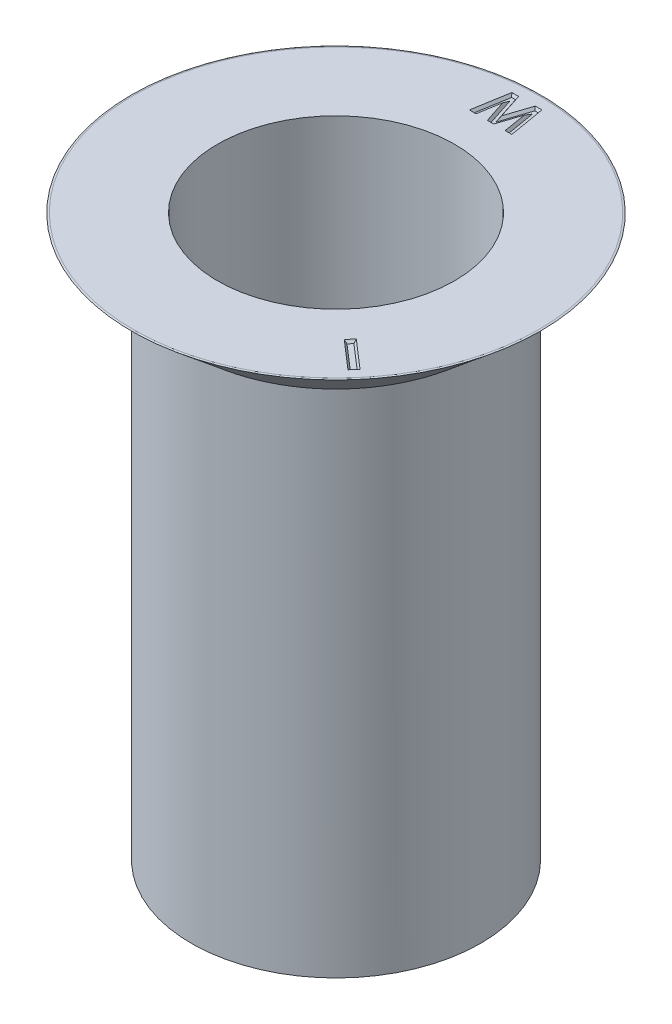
ISO-10303-21;
HEADER;
FILE_DESCRIPTION(('STEP AP214'),'2;1');
FILE_NAME('part.step','',(''),(''),'','','');
FILE_SCHEMA(('AUTOMOTIVE_DESIGN { 1 0 10303 214 1 1 1 1 }'));
ENDSEC;
DATA;
#1=APPLICATION_CONTEXT('core data for automotive mechanical design processes');
#2=APPLICATION_PROTOCOL_DEFINITION('international standard','automotive_design',2000,#1);
#3=PRODUCT_CONTEXT('',#1,'mechanical');
#4=PRODUCT('Part','Part','',(#3));
#5=PRODUCT_RELATED_PRODUCT_CATEGORY('part','',(#4));
#6=PRODUCT_DEFINITION_FORMATION('','',#4);
#7=PRODUCT_DEFINITION_CONTEXT('part definition',#1,'design');
#8=PRODUCT_DEFINITION('design','',#6,#7);
#9=PRODUCT_DEFINITION_SHAPE('','',#8);
#10=(LENGTH_UNIT() NAMED_UNIT(*) SI_UNIT(.MILLI.,.METRE.));
#11=(NAMED_UNIT(*) PLANE_ANGLE_UNIT() SI_UNIT($,.RADIAN.));
#12=(NAMED_UNIT(*) SI_UNIT($,.STERADIAN.) SOLID_ANGLE_UNIT());
#13=UNCERTAINTY_MEASURE_WITH_UNIT(LENGTH_MEASURE(1.E-05),#10,'distance_accuracy_value','');
#14=(GEOMETRIC_REPRESENTATION_CONTEXT(3) GLOBAL_UNCERTAINTY_ASSIGNED_CONTEXT((#13)) GLOBAL_UNIT_ASSIGNED_CONTEXT((#10,
#11,#12)) REPRESENTATION_CONTEXT('',''));
#15=CARTESIAN_POINT('',(0.,0.,0.));
#16=DIRECTION('',(0.,0.,1.));
#17=DIRECTION('',(1.,0.,0.));
#18=AXIS2_PLACEMENT_3D('',#15,#16,#17);
#19=CARTESIAN_POINT('',(-3.15451567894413,-0.878047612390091,1.69258470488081E-05));
#20=DIRECTION('',(0.,-1.,0.));
#21=DIRECTION('',(1.,0.,0.));
#22=AXIS2_PLACEMENT_3D('',#19,#20,#21);
#23=PLANE('',#22);
#24=DIRECTION('',(0.166512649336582,0.,-0.986039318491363));
#25=VECTOR('',#24,1.);
#26=CARTESIAN_POINT('',(-0.575954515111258,-0.878047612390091,-4.0521001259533));
#27=LINE('',#26,#25);
#28=CARTESIAN_POINT('',(-0.575954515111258,-0.878047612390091,-4.0521001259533));
#29=VERTEX_POINT('',#28);
#30=CARTESIAN_POINT('',(-0.416102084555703,-0.878047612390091,-4.99869957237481));
#31=VERTEX_POINT('',#30);
#32=EDGE_CURVE('E62',#29,#31,#27,.T.);
#33=ORIENTED_EDGE('',*,*,#32,.T.);
#34=DIRECTION('',(1.,0.,0.));
#35=VECTOR('',#34,1.);
#36=CARTESIAN_POINT('',(-0.416102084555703,-0.878047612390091,-4.99869957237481));
#37=LINE('',#36,#35);
#38=CARTESIAN_POINT('',(-0.239752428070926,-0.878047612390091,-4.99869957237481));
#39=VERTEX_POINT('',#38);
#40=EDGE_CURVE('E221',#31,#39,#37,.T.);
#41=ORIENTED_EDGE('',*,*,#40,.T.);
#42=DIRECTION('',(0.310900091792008,0.,0.950442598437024));
#43=VECTOR('',#42,1.);
#44=CARTESIAN_POINT('',(-0.239752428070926,-0.878047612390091,-4.99869957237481));
#45=LINE('',#44,#43);
#46=CARTESIAN_POINT('',(-0.0237715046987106,-0.878047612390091,-4.33843128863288));
#47=VERTEX_POINT('',#46);
#48=EDGE_CURVE('E224',#39,#47,#45,.T.);
#49=ORIENTED_EDGE('',*,*,#48,.T.);
#50=DIRECTION('',(0.312870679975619,0.,-0.949795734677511));
#51=VECTOR('',#50,1.);
#52=CARTESIAN_POINT('',(-0.0237715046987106,-0.878047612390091,-4.33843128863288));
#53=LINE('',#52,#51);
#54=CARTESIAN_POINT('',(0.193726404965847,-0.878047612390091,-4.99869957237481));
#55=VERTEX_POINT('',#54);
#56=EDGE_CURVE('E227',#47,#55,#53,.T.);
#57=ORIENTED_EDGE('',*,*,#56,.T.);
#58=DIRECTION('',(1.,0.,0.));
#59=VECTOR('',#58,1.);
#60=CARTESIAN_POINT('',(0.193726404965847,-0.878047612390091,-4.99869957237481));
#61=LINE('',#60,#59);
#62=CARTESIAN_POINT('',(0.368369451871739,-0.878047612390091,-4.99869957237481));
#63=VERTEX_POINT('',#62);
#64=EDGE_CURVE('E230',#55,#63,#61,.T.);
#65=ORIENTED_EDGE('',*,*,#64,.T.);
#66=DIRECTION('',(0.166704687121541,0.,0.98600686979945));
#67=VECTOR('',#66,1.);
#68=CARTESIAN_POINT('',(0.368369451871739,-0.878047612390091,-4.99869957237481));
#69=LINE('',#68,#67);
#70=CARTESIAN_POINT('',(0.528411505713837,-0.878047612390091,-4.0521001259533));
#71=VERTEX_POINT('',#70);
#72=EDGE_CURVE('E233',#63,#71,#69,.T.);
#73=ORIENTED_EDGE('',*,*,#72,.T.);
#74=DIRECTION('',(-1.,0.,0.));
#75=VECTOR('',#74,1.);
#76=CARTESIAN_POINT('',(0.528411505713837,-0.878047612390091,-4.0521001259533));
#77=LINE('',#76,#75);
#78=CARTESIAN_POINT('',(0.356423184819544,-0.878047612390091,-4.0521001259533));
#79=VERTEX_POINT('',#78);
#80=EDGE_CURVE('E236',#71,#79,#77,.T.);
#81=ORIENTED_EDGE('',*,*,#80,.T.);
#82=DIRECTION('',(-0.166680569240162,0.,-0.986010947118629));
#83=VECTOR('',#82,1.);
#84=CARTESIAN_POINT('',(0.356423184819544,-0.878047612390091,-4.0521001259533));
#85=LINE('',#84,#83);
#86=CARTESIAN_POINT('',(0.255353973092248,-0.878047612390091,-4.64998234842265));
#87=VERTEX_POINT('',#86);
#88=EDGE_CURVE('E239',#79,#87,#85,.T.);
#89=ORIENTED_EDGE('',*,*,#88,.T.);
#90=DIRECTION('',(-0.312700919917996,0.,0.949851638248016));
#91=VECTOR('',#90,1.);
#92=CARTESIAN_POINT('',(0.255353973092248,-0.878047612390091,-4.64998234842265));
#93=LINE('',#92,#91);
#94=CARTESIAN_POINT('',(0.0585250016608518,-0.878047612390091,-4.0521001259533));
#95=VERTEX_POINT('',#94);
#96=EDGE_CURVE('E242',#87,#95,#93,.T.);
#97=ORIENTED_EDGE('',*,*,#96,.T.);
#98=DIRECTION('',(-1.,0.,0.));
#99=VECTOR('',#98,1.);
#100=CARTESIAN_POINT('',(0.0585250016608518,-0.878047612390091,-4.0521001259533));
#101=LINE('',#100,#99);
#102=CARTESIAN_POINT('',(-0.10720575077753,-0.878047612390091,-4.0521001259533));
#103=VERTEX_POINT('',#102);
#104=EDGE_CURVE('E245',#95,#103,#101,.T.);
#105=ORIENTED_EDGE('',*,*,#104,.T.);
#106=DIRECTION('',(-0.311068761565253,0.,-0.950387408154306));
#107=VECTOR('',#106,1.);
#108=CARTESIAN_POINT('',(-0.10720575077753,-0.878047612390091,-4.0521001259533));
#109=LINE('',#108,#107);
#110=CARTESIAN_POINT('',(-0.302896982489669,-0.878047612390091,-4.64998234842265));
#111=VERTEX_POINT('',#110);
#112=EDGE_CURVE('E248',#103,#111,#109,.T.);
#113=ORIENTED_EDGE('',*,*,#112,.T.);
#114=DIRECTION('',(-0.166376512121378,0.,0.986062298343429));
#115=VECTOR('',#114,1.);
#116=CARTESIAN_POINT('',(-0.302896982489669,-0.878047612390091,-4.64998234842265));
#117=LINE('',#116,#115);
#118=CARTESIAN_POINT('',(-0.403776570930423,-0.878047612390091,-4.0521001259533));
#119=VERTEX_POINT('',#118);
#120=EDGE_CURVE('E251',#111,#119,#117,.T.);
#121=ORIENTED_EDGE('',*,*,#120,.T.);
#122=DIRECTION('',(-1.,0.,0.));
#123=VECTOR('',#122,1.);
#124=CARTESIAN_POINT('',(-0.403776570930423,-0.878047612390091,-4.0521001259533));
#125=LINE('',#124,#123);
#126=EDGE_CURVE('E254',#119,#29,#125,.T.);
#127=ORIENTED_EDGE('',*,*,#126,.T.);
#128=EDGE_LOOP('',(#33,#41,#49,#57,#65,#73,#81,#89,#97,#105,#113,#121,#127));
#129=FACE_BOUND('',#128,.T.);
#130=CARTESIAN_POINT('',(0.000500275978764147,-0.878047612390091,1.69258470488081E-05));
#131=DIRECTION('',(0.,-1.,0.));
#132=DIRECTION('',(1.,0.,0.));
#133=AXIS2_PLACEMENT_3D('',#130,#131,#132);
#134=CIRCLE('',#133,5.28202491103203);
#135=CARTESIAN_POINT('',(5.28252518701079,-0.878047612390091,1.69258470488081E-05));
#136=VERTEX_POINT('',#135);
#137=EDGE_CURVE('E432',#136,#136,#134,.T.);
#138=ORIENTED_EDGE('',*,*,#137,.F.);
#139=EDGE_LOOP('',(#138));
#140=FACE_BOUND('',#139,.T.);
#141=CARTESIAN_POINT('',(0.000500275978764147,-0.878047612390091,1.69258470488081E-05));
#142=DIRECTION('',(0.,-1.,0.));
#143=DIRECTION('',(1.,0.,0.));
#144=AXIS2_PLACEMENT_3D('',#141,#142,#143);
#145=CIRCLE('',#144,3.08686079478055);
#146=CARTESIAN_POINT('',(3.08736107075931,-0.878047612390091,1.69258470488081E-05));
#147=VERTEX_POINT('',#146);
#148=EDGE_CURVE('E429',#147,#147,#145,.T.);
#149=ORIENTED_EDGE('',*,*,#148,.T.);
#150=EDGE_LOOP('',(#149));
#151=FACE_BOUND('',#150,.T.);
#152=DIRECTION('',(0.755766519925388,0.,0.654841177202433));
#153=VECTOR('',#152,1.);
#154=CARTESIAN_POINT('',(3.11830006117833,-0.878047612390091,2.58933580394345));
#155=LINE('',#154,#153);
#156=CARTESIAN_POINT('',(3.11830006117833,-0.878047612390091,2.58933580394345));
#157=VERTEX_POINT('',#156);
#158=CARTESIAN_POINT('',(3.85100444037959,-0.878047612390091,3.22419456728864));
#159=VERTEX_POINT('',#158);
#160=EDGE_CURVE('E54',#157,#159,#155,.T.);
#161=ORIENTED_EDGE('',*,*,#160,.T.);
#162=DIRECTION('',(-0.654638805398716,0.,0.755941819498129));
#163=VECTOR('',#162,1.);
#164=CARTESIAN_POINT('',(3.85100444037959,-0.878047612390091,3.22419456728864));
#165=LINE('',#164,#163);
#166=CARTESIAN_POINT('',(3.7051841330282,-0.878047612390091,3.39258004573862));
#167=VERTEX_POINT('',#166);
#168=EDGE_CURVE('E186',#159,#167,#165,.T.);
#169=ORIENTED_EDGE('',*,*,#168,.T.);
#170=DIRECTION('',(-0.755766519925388,0.,-0.654841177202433));
#171=VECTOR('',#170,1.);
#172=CARTESIAN_POINT('',(3.7051841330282,-0.878047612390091,3.39258004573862));
#173=LINE('',#172,#171);
#174=CARTESIAN_POINT('',(2.97247975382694,-0.878047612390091,2.75772128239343));
#175=VERTEX_POINT('',#174);
#176=EDGE_CURVE('E194',#167,#175,#173,.T.);
#177=ORIENTED_EDGE('',*,*,#176,.T.);
#178=DIRECTION('',(0.654638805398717,0.,-0.755941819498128));
#179=VECTOR('',#178,1.);
#180=CARTESIAN_POINT('',(2.97247975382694,-0.878047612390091,2.75772128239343));
#181=LINE('',#180,#179);
#182=EDGE_CURVE('E203',#175,#157,#181,.T.);
#183=ORIENTED_EDGE('',*,*,#182,.T.);
#184=EDGE_LOOP('',(#161,#169,#177,#183));
#185=FACE_BOUND('',#184,.T.);
#186=ADVANCED_FACE('F39',(#129,#140,#151,#185),#23,.F.);
#187=CARTESIAN_POINT('',(0.000500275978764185,-7.97470366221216,1.69258470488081E-05));
#188=DIRECTION('',(0.,1.,0.));
#189=DIRECTION('',(0.,0.,1.));
#190=AXIS2_PLACEMENT_3D('',#187,#188,#189);
#191=CONICAL_SURFACE('',#190,2.28319786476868,0.785398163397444);
#192=CARTESIAN_POINT('',(0.000500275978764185,-7.40674399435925,1.69258470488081E-05));
#193=DIRECTION('',(0.,-1.,0.));
#194=DIRECTION('',(0.,0.,-1.));
#195=AXIS2_PLACEMENT_3D('',#192,#193,#194);
#196=CIRCLE('',#195,2.85115753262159);
#197=CARTESIAN_POINT('',(0.000500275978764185,-7.40674399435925,-2.85114060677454));
#198=VERTEX_POINT('',#197);
#199=EDGE_CURVE('E417',#198,#198,#196,.T.);
#200=ORIENTED_EDGE('',*,*,#199,.F.);
#201=EDGE_LOOP('',(#200));
#202=FACE_BOUND('',#201,.T.);
#203=CARTESIAN_POINT('',(1.30975563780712,-7.97470366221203,-1.87050249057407));
#204=CARTESIAN_POINT('',(1.28446771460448,-7.97328840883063,-1.88993056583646));
#205=CARTESIAN_POINT('',(1.25875696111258,-7.97189901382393,-1.90880815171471));
#206=CARTESIAN_POINT('',(1.20655756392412,-7.96915279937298,-1.94544204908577));
#207=CARTESIAN_POINT('',(1.18006914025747,-7.96779597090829,-1.96319867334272));
#208=CARTESIAN_POINT('',(1.1263721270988,-7.96509518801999,-1.99757857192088));
#209=CARTESIAN_POINT('',(1.09916365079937,-7.96375123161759,-2.01420202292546));
#210=CARTESIAN_POINT('',(1.04409415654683,-7.96102479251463,-2.04633835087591));
#211=CARTESIAN_POINT('',(1.01623297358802,-7.95964230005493,-2.06185094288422));
#212=CARTESIAN_POINT('',(0.931787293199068,-7.95546302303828,-2.10663298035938));
#213=CARTESIAN_POINT('',(0.874278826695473,-7.95263134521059,-2.13418625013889));
#214=CARTESIAN_POINT('',(0.757221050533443,-7.94688752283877,-2.18452411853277));
#215=CARTESIAN_POINT('',(0.697671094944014,-7.94397535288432,-2.20730719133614));
#216=CARTESIAN_POINT('',(0.513889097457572,-7.93502382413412,-2.26913746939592));
#217=CARTESIAN_POINT('',(0.386926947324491,-7.92888842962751,-2.30038885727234));
#218=CARTESIAN_POINT('',(0.129671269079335,-7.91655656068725,-2.341387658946));
#219=CARTESIAN_POINT('',(-0.000622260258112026,-7.91036008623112,-2.35113506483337));
#220=CARTESIAN_POINT('',(-0.262879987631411,-7.89798586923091,-2.34885158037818));
#221=CARTESIAN_POINT('',(-0.394842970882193,-7.89180951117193,-2.33652463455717));
#222=CARTESIAN_POINT('',(-0.589689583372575,-7.88275626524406,-2.30158252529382));
#223=CARTESIAN_POINT('',(-0.654148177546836,-7.87977254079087,-2.28718383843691));
#224=CARTESIAN_POINT('',(-0.781638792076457,-7.87389499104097,-2.25299996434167));
#225=CARTESIAN_POINT('',(-0.844670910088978,-7.87100115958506,-2.23321514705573));
#226=CARTESIAN_POINT('',(-0.968794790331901,-7.86531226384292,-2.18842866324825));
#227=CARTESIAN_POINT('',(-1.0298881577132,-7.86251711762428,-2.16343144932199));
#228=CARTESIAN_POINT('',(-1.14974216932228,-7.8570886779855,-2.10834428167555));
#229=CARTESIAN_POINT('',(-1.2085026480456,-7.85445539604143,-2.07825396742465));
#230=CARTESIAN_POINT('',(-1.32342292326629,-7.84908006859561,-2.01343609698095));
#231=CARTESIAN_POINT('',(-1.37958198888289,-7.84633799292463,-1.9787072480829));
#232=CARTESIAN_POINT('',(-1.4889107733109,-7.84076477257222,-1.90485962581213));
#233=CARTESIAN_POINT('',(-1.54208051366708,-7.83793362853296,-1.86574088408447));
#234=CARTESIAN_POINT('',(-1.69939633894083,-7.82918001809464,-1.73990296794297));
#235=CARTESIAN_POINT('',(-1.79826972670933,-7.82314138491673,-1.64643329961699));
#236=CARTESIAN_POINT('',(-1.97919992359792,-7.81094802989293,-1.44453446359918));
#237=CARTESIAN_POINT('',(-2.06125761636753,-7.80479331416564,-1.33610608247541));
#238=CARTESIAN_POINT('',(-2.20786517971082,-7.79241022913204,-1.10489982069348));
#239=CARTESIAN_POINT('',(-2.27202899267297,-7.78618287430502,-0.981876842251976));
#240=CARTESIAN_POINT('',(-2.37876723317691,-7.77394838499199,-0.726734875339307));
#241=CARTESIAN_POINT('',(-2.42134467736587,-7.76794121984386,-0.594617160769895));
#242=CARTESIAN_POINT('',(-2.46809803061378,-7.75922498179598,-0.392660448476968));
#243=CARTESIAN_POINT('',(-2.48083118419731,-7.75636810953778,-0.32469748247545));
#244=CARTESIAN_POINT('',(-2.50053703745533,-7.75076258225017,-0.187909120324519));
#245=CARTESIAN_POINT('',(-2.50750979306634,-7.74801392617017,-0.119083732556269));
#246=CARTESIAN_POINT('',(-2.51359130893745,-7.74399906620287,-0.0155992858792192));
#247=CARTESIAN_POINT('',(-2.51488866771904,-7.74267850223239,0.018944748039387));
#248=CARTESIAN_POINT('',(-2.51609508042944,-7.74000346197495,0.0880559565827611));
#249=CARTESIAN_POINT('',(-2.51600413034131,-7.73864898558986,0.122623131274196));
#250=CARTESIAN_POINT('',(-2.51363667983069,-7.73454869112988,0.226276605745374));
#251=CARTESIAN_POINT('',(-2.5092661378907,-7.73176564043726,0.295324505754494));
#252=CARTESIAN_POINT('',(-2.49483804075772,-7.72606363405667,0.434111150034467));
#253=CARTESIAN_POINT('',(-2.48467659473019,-7.72314311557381,0.503838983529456));
#254=CARTESIAN_POINT('',(-2.45866922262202,-7.71723893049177,0.642204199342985));
#255=CARTESIAN_POINT('',(-2.44282355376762,-7.71425526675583,0.710841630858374));
#256=CARTESIAN_POINT('',(-2.38689607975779,-7.70524040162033,0.914427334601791));
#257=CARTESIAN_POINT('',(-2.33841137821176,-7.69914044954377,1.0471675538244));
#258=CARTESIAN_POINT('',(-2.21880271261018,-7.68677773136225,1.30624958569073));
#259=CARTESIAN_POINT('',(-2.14711324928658,-7.68051493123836,1.43232888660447));
#260=CARTESIAN_POINT('',(-1.98359662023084,-7.66815943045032,1.67063711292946));
#261=CARTESIAN_POINT('',(-1.89177221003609,-7.66206670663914,1.78286793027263));
#262=CARTESIAN_POINT('',(-1.69048593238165,-7.65021619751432,1.99034483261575));
#263=CARTESIAN_POINT('',(-1.58102824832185,-7.64445833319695,2.08559493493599));
#264=CARTESIAN_POINT('',(-1.43537012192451,-7.63755697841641,2.1922290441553));
#265=CARTESIAN_POINT('',(-1.40576495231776,-7.6361901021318,2.21295503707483));
#266=CARTESIAN_POINT('',(-1.34570179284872,-7.63349927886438,2.2531321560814));
#267=CARTESIAN_POINT('',(-1.31524395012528,-7.63217532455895,2.27258350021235));
#268=CARTESIAN_POINT('',(-1.22272047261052,-7.62816487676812,2.32906430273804));
#269=CARTESIAN_POINT('',(-1.15950293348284,-7.62543971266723,2.36422195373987));
#270=CARTESIAN_POINT('',(-1.02974270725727,-7.61986077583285,2.42966415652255));
#271=CARTESIAN_POINT('',(-0.963171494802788,-7.61700593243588,2.45989201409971));
#272=CARTESIAN_POINT('',(-0.827806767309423,-7.611221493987,2.51480443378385));
#273=CARTESIAN_POINT('',(-0.759013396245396,-7.60829190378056,2.53948935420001));
#274=CARTESIAN_POINT('',(-0.549955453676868,-7.59941949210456,2.60496753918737));
#275=CARTESIAN_POINT('',(-0.406913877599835,-7.59338876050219,2.63723414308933));
#276=CARTESIAN_POINT('',(-0.11291596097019,-7.581079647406,2.67868306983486));
#277=CARTESIAN_POINT('',(0.0381470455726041,-7.5747995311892,2.68709101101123));
#278=CARTESIAN_POINT('',(0.339615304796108,-7.56235357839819,2.67838092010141));
#279=CARTESIAN_POINT('',(0.490020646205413,-7.55618772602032,2.66126644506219));
#280=CARTESIAN_POINT('',(0.711716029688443,-7.54715786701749,2.61688620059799));
#281=CARTESIAN_POINT('',(0.784991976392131,-7.54418321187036,2.59896337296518));
#282=CARTESIAN_POINT('',(0.929791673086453,-7.5383244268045,2.55700362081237));
#283=CARTESIAN_POINT('',(1.00131553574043,-7.53544029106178,2.53296709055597));
#284=CARTESIAN_POINT('',(1.14210052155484,-7.52977695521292,2.47894679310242));
#285=CARTESIAN_POINT('',(1.21136111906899,-7.52699777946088,2.44896165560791));
#286=CARTESIAN_POINT('',(1.34710846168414,-7.52157909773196,2.38324709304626));
#287=CARTESIAN_POINT('',(1.41359497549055,-7.5189396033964,2.34751719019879));
#288=CARTESIAN_POINT('',(1.5437183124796,-7.51351120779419,2.27067288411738));
#289=CARTESIAN_POINT('',(1.60734324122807,-7.51072177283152,2.22953837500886));
#290=CARTESIAN_POINT('',(1.7310418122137,-7.50506260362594,2.14223084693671));
#291=CARTESIAN_POINT('',(1.79111432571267,-7.50219284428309,2.09605623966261));
#292=CARTESIAN_POINT('',(1.9653587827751,-7.49348066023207,1.95044771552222));
#293=CARTESIAN_POINT('',(2.07368179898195,-7.48753012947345,1.84385565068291));
#294=CARTESIAN_POINT('',(2.27525365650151,-7.47530217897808,1.61030330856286));
#295=CARTESIAN_POINT('',(2.36779137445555,-7.46902083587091,1.48273259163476));
#296=CARTESIAN_POINT('',(2.53011710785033,-7.45652096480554,1.2138385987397));
#297=CARTESIAN_POINT('',(2.59991117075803,-7.45030242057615,1.07251899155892));
#298=CARTESIAN_POINT('',(2.69991754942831,-7.43967889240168,0.817995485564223));
#299=CARTESIAN_POINT('',(2.73569596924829,-7.43521985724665,0.70694183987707));
#300=CARTESIAN_POINT('',(2.79311401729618,-7.42649959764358,0.481361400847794));
#301=CARTESIAN_POINT('',(2.81476915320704,-7.42223816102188,0.366838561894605));
#302=CARTESIAN_POINT('',(2.82915436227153,-7.4181031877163,0.251354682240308));
#303=B_SPLINE_CURVE_WITH_KNOTS('',3,(#203,#204,#205,#206,#207,#208,#209,#210,#211,#212,#213,
#214,#215,#216,#217,#218,#219,#220,#221,#222,#223,#224,#225,#226,#227,#228,#229,#230,#231,#232,
#233,#234,#235,#236,#237,#238,#239,#240,#241,#242,#243,#244,#245,#246,#247,#248,#249,#250,#251,
#252,#253,#254,#255,#256,#257,#258,#259,#260,#261,#262,#263,#264,#265,#266,#267,#268,#269,#270,
#271,#272,#273,#274,#275,#276,#277,#278,#279,#280,#281,#282,#283,#284,#285,#286,#287,#288,#289,
#290,#291,#292,#293,#294,#295,#296,#297,#298,#299,#300,#301,#302),.UNSPECIFIED.,.F.,.F.,(4,2,2,
2,2,2,2,2,2,2,2,2,2,2,2,2,2,2,2,2,2,2,2,2,2,2,2,2,2,2,2,2,2,2,2,2,2,2,2,2,2,2,2,2,2,2,2,2,2,4),
(0.,0.0957527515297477,0.191478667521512,0.28718962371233,0.38292504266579,0.574176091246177,
0.765488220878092,1.15618437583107,1.54688067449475,1.94285619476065,2.14100803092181,
2.33914626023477,2.53711592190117,2.73509960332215,2.93313857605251,3.13117612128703,
3.53773324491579,3.94426899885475,4.3589956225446,4.77366427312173,4.98108198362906,
5.18849767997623,5.29225436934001,5.39601135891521,5.60349640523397,5.81482656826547,
6.02614716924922,6.44843481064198,6.88190480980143,7.31531552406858,7.74862356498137,
7.85710190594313,7.96556164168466,8.18247387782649,8.40172737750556,8.62096670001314,
9.05911596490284,9.51133205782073,9.9634851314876,10.1897495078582,10.4159992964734,
10.6423012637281,10.8686220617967,11.09580999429,11.3230697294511,11.7771612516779,
12.2481540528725,12.7190215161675,13.0684334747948,13.4174611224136),.UNSPECIFIED.);
#304=CARTESIAN_POINT('',(1.30975563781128,-7.97470366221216,-1.87050249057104));
#305=VERTEX_POINT('',#304);
#306=CARTESIAN_POINT('',(2.82915436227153,-7.41810318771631,0.251354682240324));
#307=VERTEX_POINT('',#306);
#308=EDGE_CURVE('E412',#305,#307,#303,.T.);
#309=ORIENTED_EDGE('',*,*,#308,.F.);
#310=CARTESIAN_POINT('',(0.000500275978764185,-7.97470366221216,1.69258470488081E-05));
#311=DIRECTION('',(0.,-1.,0.));
#312=DIRECTION('',(0.,0.,-1.));
#313=AXIS2_PLACEMENT_3D('',#310,#311,#312);
#314=CIRCLE('',#313,2.28319786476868);
#315=CARTESIAN_POINT('',(2.28369814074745,-7.97470366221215,1.69258470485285E-05));
#316=VERTEX_POINT('',#315);
#317=EDGE_CURVE('E426',#305,#316,#314,.T.);
#318=ORIENTED_EDGE('',*,*,#317,.T.);
#319=CARTESIAN_POINT('',(1.73241191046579,-7.41810318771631,-2.25052449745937));
#320=CARTESIAN_POINT('',(1.77309608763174,-7.43063920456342,-2.20339815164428));
#321=CARTESIAN_POINT('',(1.81203315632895,-7.44340197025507,-2.15484954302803));
#322=CARTESIAN_POINT('',(1.8862391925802,-7.46935302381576,-2.0551437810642));
#323=CARTESIAN_POINT('',(1.92150864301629,-7.48254125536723,-2.00398697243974));
#324=CARTESIAN_POINT('',(2.02153559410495,-7.52269334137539,-1.84699325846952));
#325=CARTESIAN_POINT('',(2.08055429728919,-7.55025766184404,-1.73758364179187));
#326=CARTESIAN_POINT('',(2.1912617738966,-7.61181366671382,-1.49086006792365));
#327=CARTESIAN_POINT('',(2.23962081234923,-7.64605695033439,-1.35210863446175));
#328=CARTESIAN_POINT('',(2.31163802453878,-7.71564010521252,-1.06859256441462));
#329=CARTESIAN_POINT('',(2.33529357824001,-7.75098009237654,-0.923827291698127));
#330=CARTESIAN_POINT('',(2.35604523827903,-7.81814830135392,-0.647935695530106));
#331=CARTESIAN_POINT('',(2.35569736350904,-7.84995048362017,-0.516995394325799));
#332=CARTESIAN_POINT('',(2.34001186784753,-7.89721464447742,-0.321782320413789));
#333=CARTESIAN_POINT('',(2.33224900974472,-7.91290330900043,-0.256881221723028));
#334=CARTESIAN_POINT('',(2.31171576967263,-7.94402355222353,-0.127806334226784));
#335=CARTESIAN_POINT('',(2.29894486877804,-7.95945510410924,-0.0636326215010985));
#336=CARTESIAN_POINT('',(2.28369814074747,-7.97470366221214,1.69258470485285E-05));
#337=B_SPLINE_CURVE_WITH_KNOTS('',3,(#319,#320,#321,#322,#323,#324,#325,#326,#327,#328,#329,
#330,#331,#332,#333,#334,#335,#336),.UNSPECIFIED.,.F.,.F.,(4,2,2,2,2,2,2,2,4),(0.,
0.190445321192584,0.380865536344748,0.761508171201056,1.21196458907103,1.66246877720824,
2.0650833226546,2.26657642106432,2.46809040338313),.UNSPECIFIED.);
#338=CARTESIAN_POINT('',(1.73241191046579,-7.41810318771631,-2.25052449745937));
#339=VERTEX_POINT('',#338);
#340=EDGE_CURVE('E341',#339,#316,#337,.T.);
#341=ORIENTED_EDGE('',*,*,#340,.F.);
#342=CARTESIAN_POINT('',(0.000500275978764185,-7.41810318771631,1.69258470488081E-05));
#343=DIRECTION('',(0.,1.,0.));
#344=DIRECTION('',(0.,0.,1.));
#345=AXIS2_PLACEMENT_3D('',#342,#343,#344);
#346=CIRCLE('',#345,2.83979833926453);
#347=EDGE_CURVE('E352',#307,#339,#346,.T.);
#348=ORIENTED_EDGE('',*,*,#347,.F.);
#349=EDGE_LOOP('',(#309,#318,#341,#348));
#350=FACE_BOUND('',#349,.T.);
#351=ADVANCED_FACE('F354',(#202,#350),#191,.F.);
#352=CARTESIAN_POINT('',(0.000500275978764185,-15.4859702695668,1.69258470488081E-05));
#353=DIRECTION('',(0.,-1.,0.));
#354=DIRECTION('',(0.,0.,-1.));
#355=AXIS2_PLACEMENT_3D('',#352,#353,#354);
#356=CYLINDRICAL_SURFACE('',#355,2.28319786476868);
#357=CARTESIAN_POINT('',(-2.28269758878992,-6.44552520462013,1.69258470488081E-05));
#358=CARTESIAN_POINT('',(-2.28269758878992,-6.54018514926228,-1.31818797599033));
#359=CARTESIAN_POINT('',(-1.14109865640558,-6.63484509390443,-1.97729042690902));
#360=CARTESIAN_POINT('',(0.000500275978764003,-6.72950503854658,-2.63639287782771));
#361=CARTESIAN_POINT('',(1.1420992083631,-6.82416498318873,-1.97729042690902));
#362=CARTESIAN_POINT('',(2.28369814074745,-6.91882492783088,-1.31818797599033));
#363=CARTESIAN_POINT('',(2.28369814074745,-7.01348487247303,1.69258470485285E-05));
#364=CARTESIAN_POINT('',(2.28369814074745,-7.10814481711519,1.31822182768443));
#365=CARTESIAN_POINT('',(1.14209920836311,-7.20280476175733,1.97732427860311));
#366=CARTESIAN_POINT('',(0.000500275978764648,-7.29746470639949,2.6364267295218));
#367=CARTESIAN_POINT('',(-1.14109865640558,-7.39212465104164,1.97732427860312));
#368=CARTESIAN_POINT('',(-2.28269758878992,-7.48678459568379,1.31822182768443));
#369=CARTESIAN_POINT('',(-2.28269758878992,-7.58144454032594,1.69258470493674E-05));
#370=CARTESIAN_POINT('',(-2.28269758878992,-7.67610448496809,-1.31818797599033));
#371=CARTESIAN_POINT('',(-1.14109865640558,-7.77076442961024,-1.97729042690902));
#372=CARTESIAN_POINT('',(0.000500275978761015,-7.86542437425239,-2.63639287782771));
#373=CARTESIAN_POINT('',(1.1420992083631,-7.96008431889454,-1.97729042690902));
#374=CARTESIAN_POINT('',(2.28369814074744,-8.05474426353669,-1.31818797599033));
#375=CARTESIAN_POINT('',(2.28369814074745,-8.14940420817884,1.69258470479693E-05));
#376=CARTESIAN_POINT('',(2.28369814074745,-8.24406415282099,1.31822182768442));
#377=CARTESIAN_POINT('',(1.14209920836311,-8.33872409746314,1.97732427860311));
#378=CARTESIAN_POINT('',(0.000500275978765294,-8.4333840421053,2.6364267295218));
#379=CARTESIAN_POINT('',(-1.14109865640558,-8.52804398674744,1.97732427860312));
#380=CARTESIAN_POINT('',(-2.28269758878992,-8.62270393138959,1.31822182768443));
#381=CARTESIAN_POINT('',(-2.28269758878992,-8.71736387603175,1.69258470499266E-05));
#382=CARTESIAN_POINT('',(-2.28269758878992,-8.8120238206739,-1.31818797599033));
#383=CARTESIAN_POINT('',(-1.14109865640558,-8.90668376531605,-1.97729042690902));
#384=CARTESIAN_POINT('',(0.000500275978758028,-9.0013437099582,-2.63639287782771));
#385=CARTESIAN_POINT('',(1.1420992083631,-9.09600365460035,-1.97729042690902));
#386=CARTESIAN_POINT('',(2.28369814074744,-9.1906635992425,-1.31818797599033));
#387=CARTESIAN_POINT('',(2.28369814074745,-9.28532354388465,1.69258470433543E-05));
#388=CARTESIAN_POINT('',(2.28369814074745,-9.3799834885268,1.31822182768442));
#389=CARTESIAN_POINT('',(1.14209920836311,-9.47464343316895,1.97732427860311));
#390=CARTESIAN_POINT('',(0.000500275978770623,-9.5693033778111,2.6364267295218));
#391=CARTESIAN_POINT('',(-1.14109865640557,-9.66396332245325,1.97732427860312));
#392=CARTESIAN_POINT('',(-2.28269758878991,-9.7586232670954,1.31822182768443));
#393=CARTESIAN_POINT('',(-2.28269758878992,-9.85328321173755,1.69258470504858E-05));
#394=CARTESIAN_POINT('',(-2.28269758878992,-9.9479431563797,-1.31818797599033));
#395=CARTESIAN_POINT('',(-1.14109865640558,-10.0426031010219,-1.97729042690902));
#396=CARTESIAN_POINT('',(0.000500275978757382,-10.137263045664,-2.63639287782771));
#397=CARTESIAN_POINT('',(1.1420992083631,-10.2319229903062,-1.97729042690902));
#398=CARTESIAN_POINT('',(2.28369814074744,-10.3265829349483,-1.31818797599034));
#399=CARTESIAN_POINT('',(2.28369814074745,-10.4212428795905,1.69258470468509E-05));
#400=CARTESIAN_POINT('',(2.28369814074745,-10.5159028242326,1.31822182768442));
#401=CARTESIAN_POINT('',(1.14209920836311,-10.6105627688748,1.97732427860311));
#402=CARTESIAN_POINT('',(0.000500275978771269,-10.7052227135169,2.6364267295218));
#403=CARTESIAN_POINT('',(-1.14109865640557,-10.7998826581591,1.97732427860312));
#404=CARTESIAN_POINT('',(-2.28269758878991,-10.8945426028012,1.31822182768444));
#405=CARTESIAN_POINT('',(-2.28269758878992,-10.9892025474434,1.6925847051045E-05));
#406=CARTESIAN_POINT('',(-2.28269758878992,-11.0838624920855,-1.31818797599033));
#407=CARTESIAN_POINT('',(-1.14109865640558,-11.1785224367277,-1.97729042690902));
#408=CARTESIAN_POINT('',(0.000500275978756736,-11.2731823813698,-2.63639287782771));
#409=CARTESIAN_POINT('',(1.1420992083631,-11.367842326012,-1.97729042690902));
#410=CARTESIAN_POINT('',(2.28369814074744,-11.4625022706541,-1.31818797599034));
#411=CARTESIAN_POINT('',(2.28369814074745,-11.5571622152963,1.69258470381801E-05));
#412=CARTESIAN_POINT('',(2.28369814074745,-11.6518221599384,1.31822182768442));
#413=CARTESIAN_POINT('',(1.14209920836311,-11.7464821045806,1.97732427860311));
#414=CARTESIAN_POINT('',(0.000500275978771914,-11.8411420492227,2.6364267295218));
#415=CARTESIAN_POINT('',(-1.14109865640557,-11.9358019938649,1.97732427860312));
#416=CARTESIAN_POINT('',(-2.28269758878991,-12.030461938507,1.31822182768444));
#417=CARTESIAN_POINT('',(-2.28269758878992,-12.1251218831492,1.69258470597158E-05));
#418=CARTESIAN_POINT('',(-2.28269758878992,-12.2197818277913,-1.31818797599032));
#419=CARTESIAN_POINT('',(-1.14109865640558,-12.3144417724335,-1.97729042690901));
#420=CARTESIAN_POINT('',(0.000500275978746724,-12.4091017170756,-2.63639287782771));
#421=CARTESIAN_POINT('',(1.1420992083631,-12.5037616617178,-1.97729042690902));
#422=CARTESIAN_POINT('',(2.28369814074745,-12.5984216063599,-1.31818797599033));
#423=CARTESIAN_POINT('',(2.28369814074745,-12.6930815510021,1.69258470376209E-05));
#424=CARTESIAN_POINT('',(2.28369814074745,-12.7877414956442,1.31822182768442));
#425=CARTESIAN_POINT('',(1.14209920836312,-12.8824014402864,1.97732427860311));
#426=CARTESIAN_POINT('',(0.00050027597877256,-12.9770613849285,2.6364267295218));
#427=CARTESIAN_POINT('',(-1.14109865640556,-13.0717213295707,1.97732427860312));
#428=CARTESIAN_POINT('',(-2.28269758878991,-13.1663812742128,1.31822182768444));
#429=CARTESIAN_POINT('',(-2.28269758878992,-13.261041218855,1.69258470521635E-05));
#430=CARTESIAN_POINT('',(-2.28269758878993,-13.3557011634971,-1.31818797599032));
#431=CARTESIAN_POINT('',(-1.14109865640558,-13.4503611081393,-1.97729042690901));
#432=CARTESIAN_POINT('',(0.000500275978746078,-13.5450210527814,-2.63639287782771));
#433=CARTESIAN_POINT('',(1.1420992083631,-13.6396809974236,-1.97729042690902));
#434=CARTESIAN_POINT('',(2.28369814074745,-13.7343409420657,-1.31818797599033));
#435=CARTESIAN_POINT('',(2.28369814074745,-13.8290008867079,1.69258470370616E-05));
#436=CARTESIAN_POINT('',(2.28369814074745,-13.92366083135,1.31822182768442));
#437=CARTESIAN_POINT('',(1.14209920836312,-14.0183207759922,1.97732427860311));
#438=CARTESIAN_POINT('',(0.000500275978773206,-14.1129807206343,2.6364267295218));
#439=CARTESIAN_POINT('',(-1.14109865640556,-14.2076406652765,1.97732427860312));
#440=CARTESIAN_POINT('',(-2.28269758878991,-14.3023006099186,1.31822182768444));
#441=CARTESIAN_POINT('',(-2.28269758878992,-14.3969605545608,1.69258470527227E-05));
#442=CARTESIAN_POINT('',(-2.28269758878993,-14.4916204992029,-1.31818797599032));
#443=CARTESIAN_POINT('',(-1.14109865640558,-14.5862804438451,-1.97729042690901));
#444=CARTESIAN_POINT('',(0.000500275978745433,-14.6809403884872,-2.63639287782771));
#445=CARTESIAN_POINT('',(1.1420992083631,-14.7756003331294,-1.97729042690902));
#446=CARTESIAN_POINT('',(2.28369814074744,-14.8702602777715,-1.31818797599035));
#447=CARTESIAN_POINT('',(2.28369814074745,-14.9649202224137,1.69258470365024E-05));
#448=CARTESIAN_POINT('',(2.28369814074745,-15.0595801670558,1.31822182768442));
#449=CARTESIAN_POINT('',(1.14209920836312,-15.154240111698,1.97732427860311));
#450=CARTESIAN_POINT('',(0.000500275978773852,-15.2489000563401,2.6364267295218));
#451=CARTESIAN_POINT('',(-1.14109865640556,-15.3435600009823,1.97732427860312));
#452=CARTESIAN_POINT('',(-2.28269758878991,-15.4382199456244,1.31822182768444));
#453=CARTESIAN_POINT('',(-2.28269758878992,-15.5328798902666,1.69258470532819E-05));
#454=CARTESIAN_POINT('',(-2.28269758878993,-15.6275398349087,-1.31818797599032));
#455=CARTESIAN_POINT('',(-1.14109865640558,-15.7221997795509,-1.97729042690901));
#456=CARTESIAN_POINT('',(0.000500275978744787,-15.816859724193,-2.63639287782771));
#457=CARTESIAN_POINT('',(1.1420992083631,-15.9115196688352,-1.97729042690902));
#458=CARTESIAN_POINT('',(2.28369814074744,-16.0061796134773,-1.31818797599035));
#459=CARTESIAN_POINT('',(2.28369814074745,-16.1008395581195,1.69258470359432E-05));
#460=CARTESIAN_POINT('',(2.28369814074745,-16.1954995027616,1.31822182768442));
#461=CARTESIAN_POINT('',(1.14209920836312,-16.2901594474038,1.97732427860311));
#462=CARTESIAN_POINT('',(0.000500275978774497,-16.3848193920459,2.6364267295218));
#463=CARTESIAN_POINT('',(-1.14109865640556,-16.4794793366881,1.97732427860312));
#464=CARTESIAN_POINT('',(-2.28269758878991,-16.5741392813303,1.31822182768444));
#465=CARTESIAN_POINT('',(-2.28269758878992,-16.6687992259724,1.69258470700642E-05));
#466=(BOUNDED_CURVE() B_SPLINE_CURVE(2,(#357,#358,#359,#360,#361,#362,#363,#364,#365,#366,#367,
#368,#369,#370,#371,#372,#373,#374,#375,#376,#377,#378,#379,#380,#381,#382,#383,#384,#385,#386,
#387,#388,#389,#390,#391,#392,#393,#394,#395,#396,#397,#398,#399,#400,#401,#402,#403,#404,#405,
#406,#407,#408,#409,#410,#411,#412,#413,#414,#415,#416,#417,#418,#419,#420,#421,#422,#423,#424,
#425,#426,#427,#428,#429,#430,#431,#432,#433,#434,#435,#436,#437,#438,#439,#440,#441,#442,#443,
#444,#445,#446,#447,#448,#449,#450,#451,#452,#453,#454,#455,#456,#457,#458,#459,#460,#461,#462,
#463,#464,#465),.UNSPECIFIED.,.F.,.F.) B_SPLINE_CURVE_WITH_KNOTS((3,2,2,2,2,2,2,2,2,2,2,2,2,2,2,
2,2,2,2,2,2,2,2,2,2,2,2,2,2,2,2,2,2,2,2,2,2,2,2,2,2,2,2,2,2,2,2,2,2,2,2,2,2,2,3),(0.,
0.0185185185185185,0.037037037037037,0.0555555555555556,0.0740740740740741,0.0925925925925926,
0.111111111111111,0.12962962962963,0.148148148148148,0.166666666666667,0.185185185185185,
0.203703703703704,0.222222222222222,0.240740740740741,0.259259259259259,0.277777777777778,
0.296296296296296,0.314814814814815,0.333333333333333,0.351851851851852,0.37037037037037,
0.388888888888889,0.407407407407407,0.425925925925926,0.444444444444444,0.462962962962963,
0.481481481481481,0.5,0.518518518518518,0.537037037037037,0.555555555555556,0.574074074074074,
0.592592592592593,0.611111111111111,0.62962962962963,0.648148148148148,0.666666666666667,
0.685185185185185,0.703703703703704,0.722222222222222,0.740740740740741,0.759259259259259,
0.777777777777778,0.796296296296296,0.814814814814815,0.833333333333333,0.851851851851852,
0.87037037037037,0.888888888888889,0.907407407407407,0.925925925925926,0.944444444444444,
0.962962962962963,0.981481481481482,1.),
.UNSPECIFIED.) CURVE() GEOMETRIC_REPRESENTATION_ITEM() RATIONAL_B_SPLINE_CURVE((1.,
0.866025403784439,1.,0.866025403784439,1.,0.866025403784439,1.,0.866025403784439,1.,
0.866025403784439,1.,0.866025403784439,1.,0.866025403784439,1.,0.866025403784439,1.,
0.866025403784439,1.,0.866025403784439,1.,0.866025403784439,1.,0.866025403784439,1.,
0.866025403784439,1.,0.866025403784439,1.,0.866025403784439,1.,0.866025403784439,1.,
0.866025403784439,1.,0.866025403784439,1.,0.866025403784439,1.,0.866025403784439,1.,
0.866025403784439,1.,0.866025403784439,1.,0.866025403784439,1.,0.866025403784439,1.,
0.866025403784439,1.,0.866025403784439,1.,0.866025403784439,1.,0.866025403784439,1.,
0.866025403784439,1.,0.866025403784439,1.,0.866025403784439,1.,0.866025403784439,1.,
0.866025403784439,1.,0.866025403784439,1.,0.866025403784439,1.,0.866025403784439,1.,
0.866025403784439,1.,0.866025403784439,1.,0.866025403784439,1.,0.866025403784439,1.,
0.866025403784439,1.,0.866025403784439,1.,0.866025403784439,1.,0.866025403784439,1.,
0.866025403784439,1.,0.866025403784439,1.,0.866025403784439,1.,0.866025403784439,1.,
0.866025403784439,1.,0.866025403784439,1.,0.866025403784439,1.,0.866025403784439,1.,
0.866025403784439,1.,0.866025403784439,1.)) REPRESENTATION_ITEM(''));
#467=CARTESIAN_POINT('',(2.20181540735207,-14.9180106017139,-0.6059568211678));
#468=VERTEX_POINT('',#467);
#469=EDGE_CURVE('E260',#305,#468,#466,.T.);
#470=ORIENTED_EDGE('',*,*,#469,.T.);
#471=CARTESIAN_POINT('',(0.000500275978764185,-14.9180106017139,1.69258470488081E-05));
#472=DIRECTION('',(0.,-1.,0.));
#473=DIRECTION('',(0.,0.,-1.));
#474=AXIS2_PLACEMENT_3D('',#471,#472,#473);
#475=CIRCLE('',#474,2.28319786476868);
#476=CARTESIAN_POINT('',(1.74751486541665,-14.9180106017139,1.47002798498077));
#477=VERTEX_POINT('',#476);
#478=EDGE_CURVE('E423',#468,#477,#475,.T.);
#479=ORIENTED_EDGE('',*,*,#478,.T.);
#480=CARTESIAN_POINT('',(-2.28269758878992,-7.40674399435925,1.69258470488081E-05));
#481=CARTESIAN_POINT('',(-2.28269758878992,-7.5014039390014,-1.31818797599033));
#482=CARTESIAN_POINT('',(-1.14109865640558,-7.59606388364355,-1.97729042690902));
#483=CARTESIAN_POINT('',(0.000500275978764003,-7.6907238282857,-2.63639287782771));
#484=CARTESIAN_POINT('',(1.1420992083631,-7.78538377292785,-1.97729042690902));
#485=CARTESIAN_POINT('',(2.28369814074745,-7.88004371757,-1.31818797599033));
#486=CARTESIAN_POINT('',(2.28369814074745,-7.97470366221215,1.69258470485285E-05));
#487=CARTESIAN_POINT('',(2.28369814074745,-8.0693636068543,1.31822182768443));
#488=CARTESIAN_POINT('',(1.14209920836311,-8.16402355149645,1.97732427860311));
#489=CARTESIAN_POINT('',(0.000500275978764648,-8.2586834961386,2.6364267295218));
#490=CARTESIAN_POINT('',(-1.14109865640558,-8.35334344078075,1.97732427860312));
#491=CARTESIAN_POINT('',(-2.28269758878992,-8.44800338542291,1.31822182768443));
#492=CARTESIAN_POINT('',(-2.28269758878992,-8.54266333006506,1.69258470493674E-05));
#493=CARTESIAN_POINT('',(-2.28269758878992,-8.63732327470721,-1.31818797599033));
#494=CARTESIAN_POINT('',(-1.14109865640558,-8.73198321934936,-1.97729042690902));
#495=CARTESIAN_POINT('',(0.000500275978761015,-8.82664316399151,-2.63639287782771));
#496=CARTESIAN_POINT('',(1.1420992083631,-8.92130310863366,-1.97729042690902));
#497=CARTESIAN_POINT('',(2.28369814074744,-9.01596305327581,-1.31818797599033));
#498=CARTESIAN_POINT('',(2.28369814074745,-9.11062299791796,1.69258470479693E-05));
#499=CARTESIAN_POINT('',(2.28369814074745,-9.20528294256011,1.31822182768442));
#500=CARTESIAN_POINT('',(1.14209920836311,-9.29994288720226,1.97732427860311));
#501=CARTESIAN_POINT('',(0.000500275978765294,-9.39460283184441,2.6364267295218));
#502=CARTESIAN_POINT('',(-1.14109865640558,-9.48926277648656,1.97732427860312));
#503=CARTESIAN_POINT('',(-2.28269758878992,-9.58392272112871,1.31822182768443));
#504=CARTESIAN_POINT('',(-2.28269758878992,-9.67858266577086,1.69258470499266E-05));
#505=CARTESIAN_POINT('',(-2.28269758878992,-9.77324261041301,-1.31818797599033));
#506=CARTESIAN_POINT('',(-1.14109865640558,-9.86790255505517,-1.97729042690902));
#507=CARTESIAN_POINT('',(0.000500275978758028,-9.96256249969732,-2.63639287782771));
#508=CARTESIAN_POINT('',(1.1420992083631,-10.0572224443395,-1.97729042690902));
#509=CARTESIAN_POINT('',(2.28369814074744,-10.1518823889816,-1.31818797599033));
#510=CARTESIAN_POINT('',(2.28369814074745,-10.2465423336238,1.69258470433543E-05));
#511=CARTESIAN_POINT('',(2.28369814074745,-10.3412022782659,1.31822182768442));
#512=CARTESIAN_POINT('',(1.14209920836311,-10.4358622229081,1.97732427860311));
#513=CARTESIAN_POINT('',(0.000500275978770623,-10.5305221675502,2.6364267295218));
#514=CARTESIAN_POINT('',(-1.14109865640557,-10.6251821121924,1.97732427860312));
#515=CARTESIAN_POINT('',(-2.28269758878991,-10.7198420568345,1.31822182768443));
#516=CARTESIAN_POINT('',(-2.28269758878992,-10.8145020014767,1.69258470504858E-05));
#517=CARTESIAN_POINT('',(-2.28269758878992,-10.9091619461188,-1.31818797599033));
#518=CARTESIAN_POINT('',(-1.14109865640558,-11.003821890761,-1.97729042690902));
#519=CARTESIAN_POINT('',(0.000500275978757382,-11.0984818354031,-2.63639287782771));
#520=CARTESIAN_POINT('',(1.1420992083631,-11.1931417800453,-1.97729042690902));
#521=CARTESIAN_POINT('',(2.28369814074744,-11.2878017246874,-1.31818797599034));
#522=CARTESIAN_POINT('',(2.28369814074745,-11.3824616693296,1.69258470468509E-05));
#523=CARTESIAN_POINT('',(2.28369814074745,-11.4771216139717,1.31822182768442));
#524=CARTESIAN_POINT('',(1.14209920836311,-11.5717815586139,1.97732427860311));
#525=CARTESIAN_POINT('',(0.000500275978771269,-11.666441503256,2.6364267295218));
#526=CARTESIAN_POINT('',(-1.14109865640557,-11.7611014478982,1.97732427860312));
#527=CARTESIAN_POINT('',(-2.28269758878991,-11.8557613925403,1.31822182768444));
#528=CARTESIAN_POINT('',(-2.28269758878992,-11.9504213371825,1.6925847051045E-05));
#529=CARTESIAN_POINT('',(-2.28269758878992,-12.0450812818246,-1.31818797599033));
#530=CARTESIAN_POINT('',(-1.14109865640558,-12.1397412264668,-1.97729042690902));
#531=CARTESIAN_POINT('',(0.000500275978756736,-12.2344011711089,-2.63639287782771));
#532=CARTESIAN_POINT('',(1.1420992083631,-12.3290611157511,-1.97729042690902));
#533=CARTESIAN_POINT('',(2.28369814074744,-12.4237210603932,-1.31818797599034));
#534=CARTESIAN_POINT('',(2.28369814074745,-12.5183810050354,1.69258470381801E-05));
#535=CARTESIAN_POINT('',(2.28369814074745,-12.6130409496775,1.31822182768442));
#536=CARTESIAN_POINT('',(1.14209920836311,-12.7077008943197,1.97732427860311));
#537=CARTESIAN_POINT('',(0.000500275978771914,-12.8023608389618,2.6364267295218));
#538=CARTESIAN_POINT('',(-1.14109865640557,-12.897020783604,1.97732427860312));
#539=CARTESIAN_POINT('',(-2.28269758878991,-12.9916807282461,1.31822182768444));
#540=CARTESIAN_POINT('',(-2.28269758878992,-13.0863406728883,1.69258470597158E-05));
#541=CARTESIAN_POINT('',(-2.28269758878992,-13.1810006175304,-1.31818797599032));
#542=CARTESIAN_POINT('',(-1.14109865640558,-13.2756605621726,-1.97729042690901));
#543=CARTESIAN_POINT('',(0.000500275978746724,-13.3703205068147,-2.63639287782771));
#544=CARTESIAN_POINT('',(1.1420992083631,-13.4649804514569,-1.97729042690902));
#545=CARTESIAN_POINT('',(2.28369814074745,-13.559640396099,-1.31818797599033));
#546=CARTESIAN_POINT('',(2.28369814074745,-13.6543003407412,1.69258470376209E-05));
#547=CARTESIAN_POINT('',(2.28369814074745,-13.7489602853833,1.31822182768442));
#548=CARTESIAN_POINT('',(1.14209920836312,-13.8436202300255,1.97732427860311));
#549=CARTESIAN_POINT('',(0.00050027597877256,-13.9382801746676,2.6364267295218));
#550=CARTESIAN_POINT('',(-1.14109865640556,-14.0329401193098,1.97732427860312));
#551=CARTESIAN_POINT('',(-2.28269758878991,-14.1276000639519,1.31822182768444));
#552=CARTESIAN_POINT('',(-2.28269758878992,-14.2222600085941,1.69258470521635E-05));
#553=CARTESIAN_POINT('',(-2.28269758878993,-14.3169199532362,-1.31818797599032));
#554=CARTESIAN_POINT('',(-1.14109865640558,-14.4115798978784,-1.97729042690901));
#555=CARTESIAN_POINT('',(0.000500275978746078,-14.5062398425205,-2.63639287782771));
#556=CARTESIAN_POINT('',(1.1420992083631,-14.6008997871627,-1.97729042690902));
#557=CARTESIAN_POINT('',(2.28369814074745,-14.6955597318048,-1.31818797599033));
#558=CARTESIAN_POINT('',(2.28369814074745,-14.790219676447,1.69258470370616E-05));
#559=CARTESIAN_POINT('',(2.28369814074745,-14.8848796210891,1.31822182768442));
#560=CARTESIAN_POINT('',(1.14209920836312,-14.9795395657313,1.97732427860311));
#561=CARTESIAN_POINT('',(0.000500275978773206,-15.0741995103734,2.6364267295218));
#562=CARTESIAN_POINT('',(-1.14109865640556,-15.1688594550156,1.97732427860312));
#563=CARTESIAN_POINT('',(-2.28269758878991,-15.2635193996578,1.31822182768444));
#564=CARTESIAN_POINT('',(-2.28269758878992,-15.3581793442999,1.69258470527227E-05));
#565=CARTESIAN_POINT('',(-2.28269758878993,-15.4528392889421,-1.31818797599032));
#566=CARTESIAN_POINT('',(-1.14109865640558,-15.5474992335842,-1.97729042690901));
#567=CARTESIAN_POINT('',(0.000500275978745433,-15.6421591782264,-2.63639287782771));
#568=CARTESIAN_POINT('',(1.1420992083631,-15.7368191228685,-1.97729042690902));
#569=CARTESIAN_POINT('',(2.28369814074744,-15.8314790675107,-1.31818797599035));
#570=CARTESIAN_POINT('',(2.28369814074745,-15.9261390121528,1.69258470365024E-05));
#571=CARTESIAN_POINT('',(2.28369814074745,-16.020798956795,1.31822182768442));
#572=CARTESIAN_POINT('',(1.14209920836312,-16.1154589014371,1.97732427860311));
#573=CARTESIAN_POINT('',(0.000500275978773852,-16.2101188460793,2.6364267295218));
#574=CARTESIAN_POINT('',(-1.14109865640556,-16.3047787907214,1.97732427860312));
#575=CARTESIAN_POINT('',(-2.28269758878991,-16.3994387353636,1.31822182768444));
#576=CARTESIAN_POINT('',(-2.28269758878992,-16.4940986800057,1.69258470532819E-05));
#577=CARTESIAN_POINT('',(-2.28269758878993,-16.5887586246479,-1.31818797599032));
#578=CARTESIAN_POINT('',(-1.14109865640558,-16.68341856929,-1.97729042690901));
#579=CARTESIAN_POINT('',(0.000500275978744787,-16.7780785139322,-2.63639287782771));
#580=CARTESIAN_POINT('',(1.1420992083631,-16.8727384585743,-1.97729042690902));
#581=CARTESIAN_POINT('',(2.28369814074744,-16.9673984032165,-1.31818797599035));
#582=CARTESIAN_POINT('',(2.28369814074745,-17.0620583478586,1.69258470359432E-05));
#583=CARTESIAN_POINT('',(2.28369814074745,-17.1567182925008,1.31822182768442));
#584=CARTESIAN_POINT('',(1.14209920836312,-17.2513782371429,1.97732427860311));
#585=CARTESIAN_POINT('',(0.000500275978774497,-17.3460381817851,2.6364267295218));
#586=CARTESIAN_POINT('',(-1.14109865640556,-17.4406981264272,1.97732427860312));
#587=CARTESIAN_POINT('',(-2.28269758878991,-17.5353580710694,1.31822182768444));
#588=CARTESIAN_POINT('',(-2.28269758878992,-17.6300180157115,1.69258470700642E-05));
#589=(BOUNDED_CURVE() B_SPLINE_CURVE(2,(#480,#481,#482,#483,#484,#485,#486,#487,#488,#489,#490,
#491,#492,#493,#494,#495,#496,#497,#498,#499,#500,#501,#502,#503,#504,#505,#506,#507,#508,#509,
#510,#511,#512,#513,#514,#515,#516,#517,#518,#519,#520,#521,#522,#523,#524,#525,#526,#527,#528,
#529,#530,#531,#532,#533,#534,#535,#536,#537,#538,#539,#540,#541,#542,#543,#544,#545,#546,#547,
#548,#549,#550,#551,#552,#553,#554,#555,#556,#557,#558,#559,#560,#561,#562,#563,#564,#565,#566,
#567,#568,#569,#570,#571,#572,#573,#574,#575,#576,#577,#578,#579,#580,#581,#582,#583,#584,#585,
#586,#587,#588),.UNSPECIFIED.,.F.,.F.) B_SPLINE_CURVE_WITH_KNOTS((3,2,2,2,2,2,2,2,2,2,2,2,2,2,2,
2,2,2,2,2,2,2,2,2,2,2,2,2,2,2,2,2,2,2,2,2,2,2,2,2,2,2,2,2,2,2,2,2,2,2,2,2,2,2,3),(0.,
0.0185185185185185,0.037037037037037,0.0555555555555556,0.0740740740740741,0.0925925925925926,
0.111111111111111,0.12962962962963,0.148148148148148,0.166666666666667,0.185185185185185,
0.203703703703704,0.222222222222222,0.240740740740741,0.259259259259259,0.277777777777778,
0.296296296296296,0.314814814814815,0.333333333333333,0.351851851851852,0.37037037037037,
0.388888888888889,0.407407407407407,0.425925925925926,0.444444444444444,0.462962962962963,
0.481481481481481,0.5,0.518518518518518,0.537037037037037,0.555555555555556,0.574074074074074,
0.592592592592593,0.611111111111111,0.62962962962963,0.648148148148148,0.666666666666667,
0.685185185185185,0.703703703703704,0.722222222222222,0.740740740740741,0.759259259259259,
0.777777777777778,0.796296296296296,0.814814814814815,0.833333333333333,0.851851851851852,
0.87037037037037,0.888888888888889,0.907407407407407,0.925925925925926,0.944444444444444,
0.962962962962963,0.981481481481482,1.),
.UNSPECIFIED.) CURVE() GEOMETRIC_REPRESENTATION_ITEM() RATIONAL_B_SPLINE_CURVE((1.,
0.866025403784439,1.,0.866025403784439,1.,0.866025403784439,1.,0.866025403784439,1.,
0.866025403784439,1.,0.866025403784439,1.,0.866025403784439,1.,0.866025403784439,1.,
0.866025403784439,1.,0.866025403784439,1.,0.866025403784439,1.,0.866025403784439,1.,
0.866025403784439,1.,0.866025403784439,1.,0.866025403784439,1.,0.866025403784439,1.,
0.866025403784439,1.,0.866025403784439,1.,0.866025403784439,1.,0.866025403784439,1.,
0.866025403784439,1.,0.866025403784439,1.,0.866025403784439,1.,0.866025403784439,1.,
0.866025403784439,1.,0.866025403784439,1.,0.866025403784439,1.,0.866025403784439,1.,
0.866025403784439,1.,0.866025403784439,1.,0.866025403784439,1.,0.866025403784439,1.,
0.866025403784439,1.,0.866025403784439,1.,0.866025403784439,1.,0.866025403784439,1.,
0.866025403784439,1.,0.866025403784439,1.,0.866025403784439,1.,0.866025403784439,1.,
0.866025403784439,1.,0.866025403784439,1.,0.866025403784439,1.,0.866025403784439,1.,
0.866025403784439,1.,0.866025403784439,1.,0.866025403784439,1.,0.866025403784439,1.,
0.866025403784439,1.,0.866025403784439,1.,0.866025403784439,1.,0.866025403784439,1.,
0.866025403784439,1.,0.866025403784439,1.)) REPRESENTATION_ITEM(''));
#590=EDGE_CURVE('E333',#316,#477,#589,.T.);
#591=ORIENTED_EDGE('',*,*,#590,.F.);
#592=ORIENTED_EDGE('',*,*,#317,.F.);
#593=EDGE_LOOP('',(#470,#479,#591,#592));
#594=FACE_BOUND('',#593,.T.);
#595=ADVANCED_FACE('F462',(#594),#356,.F.);
#596=CARTESIAN_POINT('',(0.000500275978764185,-15.4859702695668,1.69258470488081E-05));
#597=DIRECTION('',(0.,-1.,0.));
#598=DIRECTION('',(0.,0.,-1.));
#599=AXIS2_PLACEMENT_3D('',#596,#597,#598);
#600=CONICAL_SURFACE('',#599,2.85115753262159,0.785398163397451);
#601=CARTESIAN_POINT('',(0.000500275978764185,-15.4859702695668,1.69258470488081E-05));
#602=DIRECTION('',(0.,-1.,0.));
#603=DIRECTION('',(0.,0.,-1.));
#604=AXIS2_PLACEMENT_3D('',#601,#602,#603);
#605=CIRCLE('',#604,2.85115753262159);
#606=CARTESIAN_POINT('',(0.000500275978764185,-15.4859702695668,-2.85114060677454));
#607=VERTEX_POINT('',#606);
#608=EDGE_CURVE('E420',#607,#607,#605,.T.);
#609=ORIENTED_EDGE('',*,*,#608,.T.);
#610=EDGE_LOOP('',(#609));
#611=FACE_BOUND('',#610,.T.);
#612=CARTESIAN_POINT('',(2.24807432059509,-15.4746110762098,1.73577771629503));
#613=CARTESIAN_POINT('',(2.28108214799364,-15.4579632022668,1.66581053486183));
#614=CARTESIAN_POINT('',(2.3110539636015,-15.4410970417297,1.59446480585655));
#615=CARTESIAN_POINT('',(2.36475322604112,-15.4070107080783,1.44952164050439));
#616=CARTESIAN_POINT('',(2.38847913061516,-15.3897904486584,1.37592365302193));
#617=CARTESIAN_POINT('',(2.42962903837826,-15.3549757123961,1.22653983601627));
#618=CARTESIAN_POINT('',(2.44701173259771,-15.3373795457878,1.15074301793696));
#619=CARTESIAN_POINT('',(2.47513430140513,-15.3020267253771,0.99798182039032));
#620=CARTESIAN_POINT('',(2.485875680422,-15.284270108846,0.921017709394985));
#621=CARTESIAN_POINT('',(2.50063606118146,-15.248725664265,0.766542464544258));
#622=CARTESIAN_POINT('',(2.50466202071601,-15.2309378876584,0.689031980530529));
#623=CARTESIAN_POINT('',(2.50598392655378,-15.1954310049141,0.533890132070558));
#624=CARTESIAN_POINT('',(2.50327686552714,-15.1777119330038,0.456258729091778));
#625=CARTESIAN_POINT('',(2.49419487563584,-15.1513434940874,0.340358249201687));
#626=CARTESIAN_POINT('',(2.49034382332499,-15.142606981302,0.301895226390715));
#627=CARTESIAN_POINT('',(2.48098781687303,-15.1252108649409,0.225145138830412));
#628=CARTESIAN_POINT('',(2.47548264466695,-15.1165512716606,0.186858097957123));
#629=CARTESIAN_POINT('',(2.46281891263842,-15.0993235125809,0.110566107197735));
#630=CARTESIAN_POINT('',(2.45566147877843,-15.0907552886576,0.0725609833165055));
#631=CARTESIAN_POINT('',(2.44373368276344,-15.0780242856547,0.0157819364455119));
#632=CARTESIAN_POINT('',(2.43955950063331,-15.0738011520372,-0.00310489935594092));
#633=CARTESIAN_POINT('',(2.43070382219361,-15.0652848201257,-0.0407430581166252));
#634=CARTESIAN_POINT('',(2.42602233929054,-15.0609916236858,-0.0594943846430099));
#635=CARTESIAN_POINT('',(2.40885707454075,-15.0459333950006,-0.12447189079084));
#636=CARTESIAN_POINT('',(2.39507321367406,-15.0349866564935,-0.170320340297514));
#637=CARTESIAN_POINT('',(2.36447493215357,-15.0126862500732,-0.260878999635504));
#638=CARTESIAN_POINT('',(2.34766102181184,-15.00133265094,-0.305589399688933));
#639=CARTESIAN_POINT('',(2.31102409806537,-14.9782013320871,-0.393814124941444));
#640=CARTESIAN_POINT('',(2.29119224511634,-14.9664224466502,-0.437324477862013));
#641=CARTESIAN_POINT('',(2.24864313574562,-14.9424903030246,-0.522831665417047));
#642=CARTESIAN_POINT('',(2.22592450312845,-14.9303368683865,-0.564827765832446));
#643=CARTESIAN_POINT('',(2.20181540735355,-14.9180106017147,-0.605956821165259));
#644=B_SPLINE_CURVE_WITH_KNOTS('',3,(#612,#613,#614,#615,#616,#617,#618,#619,#620,#621,#622,
#623,#624,#625,#626,#627,#628,#629,#630,#631,#632,#633,#634,#635,#636,#637,#638,#639,#640,#641,
#642,#643),.UNSPECIFIED.,.F.,.F.,(4,2,2,2,2,2,2,2,2,2,2,2,2,2,2,4),(0.,0.237327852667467,
0.474714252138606,0.713620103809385,0.952471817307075,1.1910759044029,1.42978658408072,
1.54864892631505,1.66752694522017,1.78632419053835,1.84571391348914,1.90510206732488,
2.05231600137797,2.19950516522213,2.34713405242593,2.4948335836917),.UNSPECIFIED.);
#645=CARTESIAN_POINT('',(2.24807432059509,-15.4746110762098,1.73577771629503));
#646=VERTEX_POINT('',#645);
#647=EDGE_CURVE('E389',#646,#468,#644,.T.);
#648=ORIENTED_EDGE('',*,*,#647,.F.);
#649=CARTESIAN_POINT('',(0.000500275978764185,-15.4746110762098,1.69258470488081E-05));
#650=DIRECTION('',(0.,-1.,0.));
#651=DIRECTION('',(0.,0.,-1.));
#652=AXIS2_PLACEMENT_3D('',#649,#650,#651);
#653=CIRCLE('',#652,2.83979833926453);
#654=CARTESIAN_POINT('',(2.6690003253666,-15.4746110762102,-0.971354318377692));
#655=VERTEX_POINT('',#654);
#656=EDGE_CURVE('E385',#655,#646,#653,.T.);
#657=ORIENTED_EDGE('',*,*,#656,.F.);
#658=CARTESIAN_POINT('',(1.74751486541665,-14.9180106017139,1.47002798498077));
#659=CARTESIAN_POINT('',(1.70887997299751,-14.9210669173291,1.5207009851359));
#660=CARTESIAN_POINT('',(1.66809150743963,-14.924094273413,1.56973350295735));
#661=CARTESIAN_POINT('',(1.58252936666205,-14.9300711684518,1.6641795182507));
#662=CARTESIAN_POINT('',(1.5377563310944,-14.9330207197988,1.70959359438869));
#663=CARTESIAN_POINT('',(1.44463350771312,-14.9388169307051,1.79638875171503));
#664=CARTESIAN_POINT('',(1.39629152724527,-14.9416637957,1.83777820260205));
#665=CARTESIAN_POINT('',(1.29628328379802,-14.9472441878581,1.91634660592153));
#666=CARTESIAN_POINT('',(1.24461706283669,-14.9499777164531,1.95352561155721));
#667=CARTESIAN_POINT('',(1.16494154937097,-14.9539771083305,2.0059103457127));
#668=CARTESIAN_POINT('',(1.13802918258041,-14.9552930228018,2.02280316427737));
#669=CARTESIAN_POINT('',(1.08355397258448,-14.9579613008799,2.05550260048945));
#670=CARTESIAN_POINT('',(1.05599111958,-14.9593136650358,2.07130920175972));
#671=CARTESIAN_POINT('',(0.972383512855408,-14.9634058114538,2.11704696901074));
#672=CARTESIAN_POINT('',(0.915411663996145,-14.9661810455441,2.1453013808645));
#673=CARTESIAN_POINT('',(0.799362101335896,-14.9718147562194,2.19715839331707));
#674=CARTESIAN_POINT('',(0.740283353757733,-14.974673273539,2.22075867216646));
#675=CARTESIAN_POINT('',(0.620441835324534,-14.9804493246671,2.26313871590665));
#676=CARTESIAN_POINT('',(0.559679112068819,-14.983366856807,2.28191861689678));
#677=CARTESIAN_POINT('',(0.369546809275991,-14.9924611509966,2.33239011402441));
#678=CARTESIAN_POINT('',(0.237850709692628,-14.9987113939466,2.35572785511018));
#679=CARTESIAN_POINT('',(-0.0275181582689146,-15.0112044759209,2.37997206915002));
#680=CARTESIAN_POINT('',(-0.161190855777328,-15.0174473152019,2.38087934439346));
#681=CARTESIAN_POINT('',(-0.427137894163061,-15.0297740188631,2.36026337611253));
#682=CARTESIAN_POINT('',(-0.559407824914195,-15.0358574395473,2.33868319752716));
#683=CARTESIAN_POINT('',(-0.818529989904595,-15.0476856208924,2.2735444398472));
#684=CARTESIAN_POINT('',(-0.945382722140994,-15.0534304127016,2.22998788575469));
#685=CARTESIAN_POINT('',(-1.09803874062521,-15.060309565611,2.16273842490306));
#686=CARTESIAN_POINT('',(-1.12827039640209,-15.0616701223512,2.14865040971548));
#687=CARTESIAN_POINT('',(-1.18810998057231,-15.0643496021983,2.1192061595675));
#688=CARTESIAN_POINT('',(-1.21771801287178,-15.0656685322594,2.10385013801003));
#689=CARTESIAN_POINT('',(-1.30558166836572,-15.0696669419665,2.05600977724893));
#690=CARTESIAN_POINT('',(-1.36287952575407,-15.072388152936,2.02175195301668));
#691=CARTESIAN_POINT('',(-1.47454688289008,-15.0779254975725,1.94872890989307));
#692=CARTESIAN_POINT('',(-1.52891542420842,-15.0807416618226,1.90996222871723));
#693=CARTESIAN_POINT('',(-1.63434250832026,-15.0864463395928,1.82819775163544));
#694=CARTESIAN_POINT('',(-1.68540120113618,-15.0893348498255,1.78520014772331));
#695=CARTESIAN_POINT('',(-1.83681193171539,-15.0982990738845,1.64686676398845));
#696=CARTESIAN_POINT('',(-1.93124638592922,-15.1044678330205,1.54489240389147));
#697=CARTESIAN_POINT('',(-2.1017599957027,-15.1168522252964,1.3267380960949));
#698=CARTESIAN_POINT('',(-2.17784083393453,-15.1230678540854,1.21055945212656));
#699=CARTESIAN_POINT('',(-2.31030406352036,-15.1354452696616,0.965841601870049));
#700=CARTESIAN_POINT('',(-2.36648122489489,-15.1416058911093,0.837190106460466));
#701=CARTESIAN_POINT('',(-2.43390939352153,-15.1506245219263,0.638657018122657));
#702=CARTESIAN_POINT('',(-2.45358384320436,-15.1535948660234,0.571524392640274));
#703=CARTESIAN_POINT('',(-2.48721097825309,-15.1594443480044,0.435823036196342));
#704=CARTESIAN_POINT('',(-2.5011640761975,-15.1623234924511,0.367254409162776));
#705=CARTESIAN_POINT('',(-2.52323169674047,-15.1679721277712,0.229247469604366));
#706=CARTESIAN_POINT('',(-2.53135157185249,-15.1707417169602,0.159810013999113));
#707=CARTESIAN_POINT('',(-2.54170686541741,-15.1761439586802,0.0204917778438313));
#708=CARTESIAN_POINT('',(-2.54394180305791,-15.178776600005,-0.0493890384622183));
#709=CARTESIAN_POINT('',(-2.54280170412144,-15.1841813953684,-0.189107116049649));
#710=CARTESIAN_POINT('',(-2.53942607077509,-15.1869535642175,-0.258944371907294));
#711=CARTESIAN_POINT('',(-2.52705169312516,-15.1925757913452,-0.398122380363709));
#712=CARTESIAN_POINT('',(-2.5180510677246,-15.1954258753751,-0.467462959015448));
#713=CARTESIAN_POINT('',(-2.48202353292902,-15.2042393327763,-0.677899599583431));
#714=CARTESIAN_POINT('',(-2.44599622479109,-15.2103167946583,-0.81756573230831));
#715=CARTESIAN_POINT('',(-2.35138612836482,-15.2225706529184,-1.0889144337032));
#716=CARTESIAN_POINT('',(-2.29280482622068,-15.2287470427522,-1.22059752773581));
#717=CARTESIAN_POINT('',(-2.15345557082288,-15.2411425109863,-1.47466467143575));
#718=CARTESIAN_POINT('',(-2.07233230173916,-15.2473605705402,-1.5968559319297));
#719=CARTESIAN_POINT('',(-1.93623535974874,-15.256502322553,-1.76850300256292));
#720=CARTESIAN_POINT('',(-1.88844622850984,-15.2595198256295,-1.82379803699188));
#721=CARTESIAN_POINT('',(-1.78836775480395,-15.265476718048,-1.93018000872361));
#722=CARTESIAN_POINT('',(-1.73607857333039,-15.2684161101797,-1.98126709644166));
#723=CARTESIAN_POINT('',(-1.62740124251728,-15.2741938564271,-2.07882679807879));
#724=CARTESIAN_POINT('',(-1.57101538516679,-15.277032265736,-2.12530195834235));
#725=CARTESIAN_POINT('',(-1.48366579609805,-15.281205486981,-2.19132450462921));
#726=CARTESIAN_POINT('',(-1.4540838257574,-15.2825826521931,-2.21271928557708));
#727=CARTESIAN_POINT('',(-1.39403776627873,-15.2852995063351,-2.25423991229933));
#728=CARTESIAN_POINT('',(-1.36357367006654,-15.2866391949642,-2.27436574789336));
#729=CARTESIAN_POINT('',(-1.30182966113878,-15.2893097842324,-2.31334052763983));
#730=CARTESIAN_POINT('',(-1.27054955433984,-15.2906406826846,-2.33218916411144));
#731=CARTESIAN_POINT('',(-1.20726072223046,-15.2933395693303,-2.36861346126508));
#732=CARTESIAN_POINT('',(-1.17525199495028,-15.2947075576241,-2.38618911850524));
#733=CARTESIAN_POINT('',(-1.07819841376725,-15.2988459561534,-2.43694913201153));
#734=CARTESIAN_POINT('',(-1.01211590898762,-15.3016512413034,-2.4681729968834));
#735=CARTESIAN_POINT('',(-0.876307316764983,-15.3073994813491,-2.52574367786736));
#736=CARTESIAN_POINT('',(-0.806534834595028,-15.3103440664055,-2.55198073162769));
#737=CARTESIAN_POINT('',(-0.665085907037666,-15.3162927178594,-2.5986122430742));
#738=CARTESIAN_POINT('',(-0.593409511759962,-15.319296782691,-2.61900685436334));
#739=CARTESIAN_POINT('',(-0.376246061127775,-15.3283671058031,-2.67119603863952));
#740=CARTESIAN_POINT('',(-0.228502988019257,-15.3344966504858,-2.69404744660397));
#741=CARTESIAN_POINT('',(0.0720614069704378,-15.3468810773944,-2.71538141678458));
#742=CARTESIAN_POINT('',(0.22492174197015,-15.3531356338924,-2.71329697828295));
#743=CARTESIAN_POINT('',(0.528096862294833,-15.3654564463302,-2.68349285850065));
#744=CARTESIAN_POINT('',(0.678411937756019,-15.3715227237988,-2.65577611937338));
#745=CARTESIAN_POINT('',(0.972319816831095,-15.3833138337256,-2.57543535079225));
#746=CARTESIAN_POINT('',(1.11591475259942,-15.3890387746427,-2.52281928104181));
#747=CARTESIAN_POINT('',(1.2884188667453,-15.3958686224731,-2.4425541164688));
#748=CARTESIAN_POINT('',(1.32260618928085,-15.3972196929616,-2.42575705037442));
#749=CARTESIAN_POINT('',(1.39024628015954,-15.3998972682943,-2.39074533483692));
#750=CARTESIAN_POINT('',(1.42369916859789,-15.4012237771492,-2.37253091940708));
#751=CARTESIAN_POINT('',(1.52291868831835,-15.4052568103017,-2.31588404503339));
#752=CARTESIAN_POINT('',(1.5875500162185,-15.4080169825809,-2.27544615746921));
#753=CARTESIAN_POINT('',(1.71412046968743,-15.4136565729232,-2.18891432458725));
#754=CARTESIAN_POINT('',(1.77601465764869,-15.416537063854,-2.14275472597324));
#755=CARTESIAN_POINT('',(1.89579552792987,-15.4223723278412,-2.04553805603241));
#756=CARTESIAN_POINT('',(1.95368227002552,-15.4253270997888,-1.99448105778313));
#757=CARTESIAN_POINT('',(2.12070321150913,-15.434266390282,-1.83447199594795));
#758=CARTESIAN_POINT('',(2.22335680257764,-15.4403329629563,-1.71857319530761));
#759=CARTESIAN_POINT('',(2.3876519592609,-15.4511447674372,-1.4991879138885));
#760=CARTESIAN_POINT('',(2.45333680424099,-15.455883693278,-1.39867658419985));
#761=CARTESIAN_POINT('',(2.57137175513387,-15.4653058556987,-1.19021488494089));
#762=CARTESIAN_POINT('',(2.62373274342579,-15.4699891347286,-1.08227067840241));
#763=CARTESIAN_POINT('',(2.66900032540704,-15.4746110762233,-0.971354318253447));
#764=B_SPLINE_CURVE_WITH_KNOTS('',3,(#658,#659,#660,#661,#662,#663,#664,#665,#666,#667,#668,
#669,#670,#671,#672,#673,#674,#675,#676,#677,#678,#679,#680,#681,#682,#683,#684,#685,#686,#687,
#688,#689,#690,#691,#692,#693,#694,#695,#696,#697,#698,#699,#700,#701,#702,#703,#704,#705,#706,
#707,#708,#709,#710,#711,#712,#713,#714,#715,#716,#717,#718,#719,#720,#721,#722,#723,#724,#725,
#726,#727,#728,#729,#730,#731,#732,#733,#734,#735,#736,#737,#738,#739,#740,#741,#742,#743,#744,
#745,#746,#747,#748,#749,#750,#751,#752,#753,#754,#755,#756,#757,#758,#759,#760,#761,#762,#763),
.UNSPECIFIED.,.F.,.F.,(4,2,2,2,2,2,2,2,2,2,2,2,2,2,2,2,2,2,2,2,2,2,2,2,2,2,2,2,2,2,2,2,2,2,2,2,
2,2,2,2,2,2,2,2,2,2,2,2,2,2,2,2,4),(0.,0.191327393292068,0.382624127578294,0.573514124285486,
0.764401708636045,0.859785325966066,0.955170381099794,1.14591167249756,1.33674787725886,
1.52757869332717,1.92719730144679,2.32680161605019,2.72742013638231,3.12800174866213,
3.22812895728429,3.3282393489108,3.52845136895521,3.72872850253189,3.92899655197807,
4.34423189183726,4.75942914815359,5.17879084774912,5.3886455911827,5.59848519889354,
5.8081320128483,6.01779595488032,6.22748219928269,6.4372386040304,6.86815898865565,
7.29905098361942,7.73716308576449,7.95639040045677,8.17560987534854,8.39470763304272,
8.50428227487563,8.61385779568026,8.723459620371,8.83306174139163,9.05222970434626,
9.27577143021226,9.49930727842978,9.945986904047,10.4028422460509,10.8596451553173,
11.316302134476,11.4306296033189,11.5449382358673,11.7735428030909,12.0050676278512,
12.2365889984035,12.6990611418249,13.0586429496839,13.417930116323),.UNSPECIFIED.);
#765=EDGE_CURVE('E379',#477,#655,#764,.T.);
#766=ORIENTED_EDGE('',*,*,#765,.F.);
#767=ORIENTED_EDGE('',*,*,#478,.F.);
#768=EDGE_LOOP('',(#648,#657,#766,#767));
#769=FACE_BOUND('',#768,.T.);
#770=ADVANCED_FACE('F369',(#611,#769),#600,.F.);
#771=CARTESIAN_POINT('',(-3.76791212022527,-15.4859702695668,1.69258470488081E-05));
#772=DIRECTION('',(0.,1.,0.));
#773=DIRECTION('',(-1.,0.,0.));
#774=AXIS2_PLACEMENT_3D('',#771,#772,#773);
#775=PLANE('',#774);
#776=ORIENTED_EDGE('',*,*,#608,.F.);
#777=EDGE_LOOP('',(#776));
#778=FACE_BOUND('',#777,.T.);
#779=CARTESIAN_POINT('',(0.000500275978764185,-15.4859702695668,1.69258470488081E-05));
#780=DIRECTION('',(0.,-1.,0.));
#781=DIRECTION('',(1.,0.,0.));
#782=AXIS2_PLACEMENT_3D('',#779,#780,#781);
#783=CIRCLE('',#782,3.76841239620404);
#784=CARTESIAN_POINT('',(3.7689126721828,-15.4859702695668,1.69258470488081E-05));
#785=VERTEX_POINT('',#784);
#786=EDGE_CURVE('E386',#785,#785,#783,.T.);
#787=ORIENTED_EDGE('',*,*,#786,.T.);
#788=EDGE_LOOP('',(#787));
#789=FACE_BOUND('',#788,.T.);
#790=ADVANCED_FACE('F441',(#778,#789),#775,.F.);
#791=CARTESIAN_POINT('',(0.000500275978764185,-15.4859702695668,1.69258470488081E-05));
#792=DIRECTION('',(0.,-1.,0.));
#793=DIRECTION('',(1.,0.,0.));
#794=AXIS2_PLACEMENT_3D('',#791,#792,#793);
#795=CYLINDRICAL_SURFACE('',#794,3.76841239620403);
#796=ORIENTED_EDGE('',*,*,#786,.F.);
#797=EDGE_LOOP('',(#796));
#798=FACE_BOUND('',#797,.T.);
#799=CARTESIAN_POINT('',(0.00050027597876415,-2.19571404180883,1.69258470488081E-05));
#800=DIRECTION('',(0.,-1.,0.));
#801=DIRECTION('',(1.,0.,0.));
#802=AXIS2_PLACEMENT_3D('',#799,#800,#801);
#803=CIRCLE('',#802,3.76841239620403);
#804=CARTESIAN_POINT('',(3.7689126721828,-2.19571404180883,1.69258470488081E-05));
#805=VERTEX_POINT('',#804);
#806=EDGE_CURVE('E434',#805,#805,#803,.T.);
#807=ORIENTED_EDGE('',*,*,#806,.T.);
#808=EDGE_LOOP('',(#807));
#809=FACE_BOUND('',#808,.T.);
#810=ADVANCED_FACE('F443',(#798,#809),#795,.T.);
#811=CARTESIAN_POINT('',(-3.76791212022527,-2.19571404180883,1.69258470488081E-05));
#812=DIRECTION('',(0.,1.,0.));
#813=DIRECTION('',(-1.,0.,0.));
#814=AXIS2_PLACEMENT_3D('',#811,#812,#813);
#815=PLANE('',#814);
#816=CARTESIAN_POINT('',(0.00050027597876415,-2.19571404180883,1.69258470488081E-05));
#817=DIRECTION('',(0.,1.,0.));
#818=DIRECTION('',(-1.,0.,0.));
#819=AXIS2_PLACEMENT_3D('',#816,#817,#818);
#820=CIRCLE('',#819,3.77113370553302);
#821=CARTESIAN_POINT('',(-3.77063342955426,-2.19571404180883,1.69258470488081E-05));
#822=VERTEX_POINT('',#821);
#823=EDGE_CURVE('E47',#822,#822,#820,.F.);
#824=ORIENTED_EDGE('',*,*,#823,.T.);
#825=EDGE_LOOP('',(#824));
#826=FACE_BOUND('',#825,.T.);
#827=ORIENTED_EDGE('',*,*,#806,.F.);
#828=EDGE_LOOP('',(#827));
#829=FACE_BOUND('',#828,.T.);
#830=ADVANCED_FACE('F445',(#826,#829),#815,.F.);
#831=CARTESIAN_POINT('',(0.000500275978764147,-0.991639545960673,1.69258470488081E-05));
#832=DIRECTION('',(0.,-1.,0.));
#833=DIRECTION('',(1.,0.,0.));
#834=AXIS2_PLACEMENT_3D('',#831,#832,#833);
#835=TOROIDAL_SURFACE('',#834,5.28202491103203,0.113591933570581);
#836=CARTESIAN_POINT('',(0.000500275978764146,-0.88831897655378,1.69258470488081E-05));
#837=DIRECTION('',(0.,-1.,0.));
#838=DIRECTION('',(1.,0.,0.));
#839=AXIS2_PLACEMENT_3D('',#836,#837,#838);
#840=CIRCLE('',#839,5.32922647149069);
#841=CARTESIAN_POINT('',(-5.32872619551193,-0.88831897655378,1.69258470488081E-05));
#842=VERTEX_POINT('',#841);
#843=EDGE_CURVE('E11',#842,#842,#840,.F.);
#844=ORIENTED_EDGE('',*,*,#843,.T.);
#845=EDGE_LOOP('',(#844));
#846=FACE_BOUND('',#845,.T.);
#847=ORIENTED_EDGE('',*,*,#137,.T.);
#848=EDGE_LOOP('',(#847));
#849=FACE_BOUND('',#848,.T.);
#850=ADVANCED_FACE('F451',(#846,#849),#835,.T.);
#851=CARTESIAN_POINT('',(0.000500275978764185,-15.4859702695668,1.69258470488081E-05));
#852=DIRECTION('',(0.,-1.,0.));
#853=DIRECTION('',(1.,0.,0.));
#854=AXIS2_PLACEMENT_3D('',#851,#852,#853);
#855=CYLINDRICAL_SURFACE('',#854,3.08686079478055);
#856=CARTESIAN_POINT('',(0.000500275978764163,-7.00845278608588,1.69258470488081E-05));
#857=DIRECTION('',(0.,-1.,0.));
#858=DIRECTION('',(1.,0.,0.));
#859=AXIS2_PLACEMENT_3D('',#856,#857,#858);
#860=CIRCLE('',#859,3.08686079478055);
#861=CARTESIAN_POINT('',(3.08736107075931,-7.00845278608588,1.69258470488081E-05));
#862=VERTEX_POINT('',#861);
#863=EDGE_CURVE('E394',#862,#862,#860,.T.);
#864=ORIENTED_EDGE('',*,*,#863,.T.);
#865=EDGE_LOOP('',(#864));
#866=FACE_BOUND('',#865,.T.);
#867=ORIENTED_EDGE('',*,*,#148,.F.);
#868=EDGE_LOOP('',(#867));
#869=FACE_BOUND('',#868,.T.);
#870=ADVANCED_FACE('F401',(#866,#869),#855,.F.);
#871=CARTESIAN_POINT('',(-2.28269758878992,-6.44552520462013,1.69258470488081E-05));
#872=CARTESIAN_POINT('',(-2.28269758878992,-6.54018514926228,-1.31818797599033));
#873=CARTESIAN_POINT('',(-1.14109865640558,-6.63484509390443,-1.97729042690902));
#874=CARTESIAN_POINT('',(0.000500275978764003,-6.72950503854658,-2.63639287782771));
#875=CARTESIAN_POINT('',(1.1420992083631,-6.82416498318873,-1.97729042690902));
#876=CARTESIAN_POINT('',(2.28369814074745,-6.91882492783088,-1.31818797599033));
#877=CARTESIAN_POINT('',(2.28369814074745,-7.01348487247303,1.69258470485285E-05));
#878=CARTESIAN_POINT('',(2.28369814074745,-7.10814481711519,1.31822182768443));
#879=CARTESIAN_POINT('',(1.14209920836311,-7.20280476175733,1.97732427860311));
#880=CARTESIAN_POINT('',(0.000500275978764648,-7.29746470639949,2.6364267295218));
#881=CARTESIAN_POINT('',(-1.14109865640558,-7.39212465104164,1.97732427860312));
#882=CARTESIAN_POINT('',(-2.28269758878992,-7.48678459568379,1.31822182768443));
#883=CARTESIAN_POINT('',(-2.28269758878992,-7.58144454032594,1.69258470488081E-05));
#884=CARTESIAN_POINT('',(-2.28269758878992,-7.67610448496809,-1.31818797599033));
#885=CARTESIAN_POINT('',(-1.14109865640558,-7.77076442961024,-1.97729042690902));
#886=CARTESIAN_POINT('',(0.000500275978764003,-7.86542437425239,-2.63639287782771));
#887=CARTESIAN_POINT('',(1.1420992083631,-7.96008431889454,-1.97729042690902));
#888=CARTESIAN_POINT('',(2.28369814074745,-8.05474426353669,-1.31818797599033));
#889=CARTESIAN_POINT('',(2.28369814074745,-8.14940420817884,1.69258470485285E-05));
#890=CARTESIAN_POINT('',(2.28369814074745,-8.24406415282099,1.31822182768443));
#891=CARTESIAN_POINT('',(1.14209920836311,-8.33872409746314,1.97732427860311));
#892=CARTESIAN_POINT('',(0.000500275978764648,-8.4333840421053,2.6364267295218));
#893=CARTESIAN_POINT('',(-1.14109865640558,-8.52804398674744,1.97732427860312));
#894=CARTESIAN_POINT('',(-2.28269758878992,-8.62270393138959,1.31822182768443));
#895=CARTESIAN_POINT('',(-2.28269758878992,-8.71736387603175,1.69258470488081E-05));
#896=CARTESIAN_POINT('',(-2.28269758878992,-8.8120238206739,-1.31818797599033));
#897=CARTESIAN_POINT('',(-1.14109865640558,-8.90668376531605,-1.97729042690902));
#898=CARTESIAN_POINT('',(0.000500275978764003,-9.0013437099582,-2.63639287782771));
#899=CARTESIAN_POINT('',(1.1420992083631,-9.09600365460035,-1.97729042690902));
#900=CARTESIAN_POINT('',(2.28369814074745,-9.1906635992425,-1.31818797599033));
#901=CARTESIAN_POINT('',(2.28369814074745,-9.28532354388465,1.69258470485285E-05));
#902=CARTESIAN_POINT('',(2.28369814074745,-9.3799834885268,1.31822182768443));
#903=CARTESIAN_POINT('',(1.14209920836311,-9.47464343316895,1.97732427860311));
#904=CARTESIAN_POINT('',(0.000500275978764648,-9.5693033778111,2.6364267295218));
#905=CARTESIAN_POINT('',(-1.14109865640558,-9.66396332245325,1.97732427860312));
#906=CARTESIAN_POINT('',(-2.28269758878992,-9.7586232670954,1.31822182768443));
#907=CARTESIAN_POINT('',(-2.28269758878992,-9.85328321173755,1.69258470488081E-05));
#908=CARTESIAN_POINT('',(-2.28269758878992,-9.9479431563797,-1.31818797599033));
#909=CARTESIAN_POINT('',(-1.14109865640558,-10.0426031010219,-1.97729042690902));
#910=CARTESIAN_POINT('',(0.000500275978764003,-10.137263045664,-2.63639287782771));
#911=CARTESIAN_POINT('',(1.1420992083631,-10.2319229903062,-1.97729042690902));
#912=CARTESIAN_POINT('',(2.28369814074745,-10.3265829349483,-1.31818797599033));
#913=CARTESIAN_POINT('',(2.28369814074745,-10.4212428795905,1.69258470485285E-05));
#914=CARTESIAN_POINT('',(2.28369814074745,-10.5159028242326,1.31822182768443));
#915=CARTESIAN_POINT('',(1.14209920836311,-10.6105627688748,1.97732427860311));
#916=CARTESIAN_POINT('',(0.000500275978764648,-10.7052227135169,2.6364267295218));
#917=CARTESIAN_POINT('',(-1.14109865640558,-10.7998826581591,1.97732427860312));
#918=CARTESIAN_POINT('',(-2.28269758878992,-10.8945426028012,1.31822182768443));
#919=CARTESIAN_POINT('',(-2.28269758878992,-10.9892025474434,1.69258470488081E-05));
#920=CARTESIAN_POINT('',(-2.28269758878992,-11.0838624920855,-1.31818797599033));
#921=CARTESIAN_POINT('',(-1.14109865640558,-11.1785224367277,-1.97729042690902));
#922=CARTESIAN_POINT('',(0.000500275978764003,-11.2731823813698,-2.63639287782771));
#923=CARTESIAN_POINT('',(1.1420992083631,-11.367842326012,-1.97729042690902));
#924=CARTESIAN_POINT('',(2.28369814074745,-11.4625022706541,-1.31818797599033));
#925=CARTESIAN_POINT('',(2.28369814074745,-11.5571622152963,1.69258470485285E-05));
#926=CARTESIAN_POINT('',(2.28369814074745,-11.6518221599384,1.31822182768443));
#927=CARTESIAN_POINT('',(1.14209920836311,-11.7464821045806,1.97732427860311));
#928=CARTESIAN_POINT('',(0.000500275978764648,-11.8411420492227,2.6364267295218));
#929=CARTESIAN_POINT('',(-1.14109865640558,-11.9358019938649,1.97732427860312));
#930=CARTESIAN_POINT('',(-2.28269758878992,-12.030461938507,1.31822182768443));
#931=CARTESIAN_POINT('',(-2.28269758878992,-12.1251218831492,1.69258470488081E-05));
#932=CARTESIAN_POINT('',(-2.28269758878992,-12.2197818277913,-1.31818797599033));
#933=CARTESIAN_POINT('',(-1.14109865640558,-12.3144417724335,-1.97729042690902));
#934=CARTESIAN_POINT('',(0.000500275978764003,-12.4091017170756,-2.63639287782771));
#935=CARTESIAN_POINT('',(1.1420992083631,-12.5037616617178,-1.97729042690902));
#936=CARTESIAN_POINT('',(2.28369814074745,-12.5984216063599,-1.31818797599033));
#937=CARTESIAN_POINT('',(2.28369814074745,-12.6930815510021,1.69258470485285E-05));
#938=CARTESIAN_POINT('',(2.28369814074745,-12.7877414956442,1.31822182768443));
#939=CARTESIAN_POINT('',(1.14209920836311,-12.8824014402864,1.97732427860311));
#940=CARTESIAN_POINT('',(0.000500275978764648,-12.9770613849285,2.6364267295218));
#941=CARTESIAN_POINT('',(-1.14109865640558,-13.0717213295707,1.97732427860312));
#942=CARTESIAN_POINT('',(-2.28269758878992,-13.1663812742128,1.31822182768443));
#943=CARTESIAN_POINT('',(-2.28269758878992,-13.261041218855,1.69258470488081E-05));
#944=CARTESIAN_POINT('',(-2.28269758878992,-13.3557011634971,-1.31818797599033));
#945=CARTESIAN_POINT('',(-1.14109865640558,-13.4503611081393,-1.97729042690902));
#946=CARTESIAN_POINT('',(0.000500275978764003,-13.5450210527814,-2.63639287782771));
#947=CARTESIAN_POINT('',(1.1420992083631,-13.6396809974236,-1.97729042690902));
#948=CARTESIAN_POINT('',(2.28369814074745,-13.7343409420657,-1.31818797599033));
#949=CARTESIAN_POINT('',(2.28369814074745,-13.8290008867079,1.69258470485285E-05));
#950=CARTESIAN_POINT('',(2.28369814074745,-13.92366083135,1.31822182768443));
#951=CARTESIAN_POINT('',(1.14209920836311,-14.0183207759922,1.97732427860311));
#952=CARTESIAN_POINT('',(0.000500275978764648,-14.1129807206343,2.6364267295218));
#953=CARTESIAN_POINT('',(-1.14109865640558,-14.2076406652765,1.97732427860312));
#954=CARTESIAN_POINT('',(-2.28269758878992,-14.3023006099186,1.31822182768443));
#955=CARTESIAN_POINT('',(-2.28269758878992,-14.3969605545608,1.69258470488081E-05));
#956=CARTESIAN_POINT('',(-2.28269758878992,-14.4916204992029,-1.31818797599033));
#957=CARTESIAN_POINT('',(-1.14109865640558,-14.5862804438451,-1.97729042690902));
#958=CARTESIAN_POINT('',(0.000500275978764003,-14.6809403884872,-2.63639287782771));
#959=CARTESIAN_POINT('',(1.1420992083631,-14.7756003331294,-1.97729042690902));
#960=CARTESIAN_POINT('',(2.28369814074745,-14.8702602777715,-1.31818797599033));
#961=CARTESIAN_POINT('',(2.28369814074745,-14.9649202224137,1.69258470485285E-05));
#962=CARTESIAN_POINT('',(2.28369814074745,-15.0595801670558,1.31822182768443));
#963=CARTESIAN_POINT('',(1.14209920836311,-15.154240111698,1.97732427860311));
#964=CARTESIAN_POINT('',(0.000500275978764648,-15.2489000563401,2.6364267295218));
#965=CARTESIAN_POINT('',(-1.14109865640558,-15.3435600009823,1.97732427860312));
#966=CARTESIAN_POINT('',(-2.28269758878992,-15.4382199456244,1.31822182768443));
#967=CARTESIAN_POINT('',(-2.28269758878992,-15.5328798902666,1.69258470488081E-05));
#968=CARTESIAN_POINT('',(-2.83929806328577,-6.83526105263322,1.69258470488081E-05));
#969=CARTESIAN_POINT('',(-2.83929806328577,-6.92992099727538,-1.63954140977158));
#970=CARTESIAN_POINT('',(-1.4193988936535,-7.02458094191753,-2.4593205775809));
#971=CARTESIAN_POINT('',(0.000500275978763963,-7.11924088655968,-3.27909974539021));
#972=CARTESIAN_POINT('',(1.42039944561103,-7.21390083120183,-2.4593205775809));
#973=CARTESIAN_POINT('',(2.84029861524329,-7.30856077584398,-1.63954140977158));
#974=CARTESIAN_POINT('',(2.8402986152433,-7.40322072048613,1.69258470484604E-05));
#975=CARTESIAN_POINT('',(2.8402986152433,-7.49788066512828,1.63957526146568));
#976=CARTESIAN_POINT('',(1.42039944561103,-7.59254060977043,2.45935442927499));
#977=CARTESIAN_POINT('',(0.000500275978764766,-7.68720055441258,3.27913359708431));
#978=CARTESIAN_POINT('',(-1.4193988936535,-7.78186049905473,2.45935442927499));
#979=CARTESIAN_POINT('',(-2.83929806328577,-7.87652044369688,1.63957526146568));
#980=CARTESIAN_POINT('',(-2.83929806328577,-7.97118038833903,1.69258470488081E-05));
#981=CARTESIAN_POINT('',(-2.83929806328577,-8.06584033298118,-1.63954140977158));
#982=CARTESIAN_POINT('',(-1.4193988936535,-8.16050027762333,-2.4593205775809));
#983=CARTESIAN_POINT('',(0.000500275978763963,-8.25516022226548,-3.27909974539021));
#984=CARTESIAN_POINT('',(1.42039944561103,-8.34982016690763,-2.4593205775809));
#985=CARTESIAN_POINT('',(2.84029861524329,-8.44448011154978,-1.63954140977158));
#986=CARTESIAN_POINT('',(2.8402986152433,-8.53914005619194,1.69258470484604E-05));
#987=CARTESIAN_POINT('',(2.8402986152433,-8.63380000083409,1.63957526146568));
#988=CARTESIAN_POINT('',(1.42039944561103,-8.72845994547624,2.45935442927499));
#989=CARTESIAN_POINT('',(0.000500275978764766,-8.82311989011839,3.27913359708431));
#990=CARTESIAN_POINT('',(-1.4193988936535,-8.91777983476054,2.45935442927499));
#991=CARTESIAN_POINT('',(-2.83929806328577,-9.01243977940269,1.63957526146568));
#992=CARTESIAN_POINT('',(-2.83929806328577,-9.10709972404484,1.69258470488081E-05));
#993=CARTESIAN_POINT('',(-2.83929806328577,-9.20175966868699,-1.63954140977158));
#994=CARTESIAN_POINT('',(-1.4193988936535,-9.29641961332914,-2.4593205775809));
#995=CARTESIAN_POINT('',(0.000500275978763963,-9.39107955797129,-3.27909974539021));
#996=CARTESIAN_POINT('',(1.42039944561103,-9.48573950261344,-2.4593205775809));
#997=CARTESIAN_POINT('',(2.84029861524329,-9.58039944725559,-1.63954140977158));
#998=CARTESIAN_POINT('',(2.8402986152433,-9.67505939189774,1.69258470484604E-05));
#999=CARTESIAN_POINT('',(2.8402986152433,-9.76971933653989,1.63957526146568));
#1000=CARTESIAN_POINT('',(1.42039944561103,-9.86437928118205,2.45935442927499));
#1001=CARTESIAN_POINT('',(0.000500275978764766,-9.95903922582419,3.27913359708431));
#1002=CARTESIAN_POINT('',(-1.4193988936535,-10.0536991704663,2.45935442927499));
#1003=CARTESIAN_POINT('',(-2.83929806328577,-10.1483591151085,1.63957526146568));
#1004=CARTESIAN_POINT('',(-2.83929806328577,-10.2430190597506,1.69258470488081E-05));
#1005=CARTESIAN_POINT('',(-2.83929806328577,-10.3376790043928,-1.63954140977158));
#1006=CARTESIAN_POINT('',(-1.4193988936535,-10.4323389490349,-2.4593205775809));
#1007=CARTESIAN_POINT('',(0.000500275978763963,-10.5269988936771,-3.27909974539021));
#1008=CARTESIAN_POINT('',(1.42039944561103,-10.6216588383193,-2.4593205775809));
#1009=CARTESIAN_POINT('',(2.84029861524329,-10.7163187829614,-1.63954140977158));
#1010=CARTESIAN_POINT('',(2.8402986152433,-10.8109787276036,1.69258470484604E-05));
#1011=CARTESIAN_POINT('',(2.8402986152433,-10.9056386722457,1.63957526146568));
#1012=CARTESIAN_POINT('',(1.42039944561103,-11.0002986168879,2.45935442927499));
#1013=CARTESIAN_POINT('',(0.000500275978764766,-11.09495856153,3.27913359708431));
#1014=CARTESIAN_POINT('',(-1.4193988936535,-11.1896185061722,2.45935442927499));
#1015=CARTESIAN_POINT('',(-2.83929806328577,-11.2842784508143,1.63957526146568));
#1016=CARTESIAN_POINT('',(-2.83929806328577,-11.3789383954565,1.69258470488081E-05));
#1017=CARTESIAN_POINT('',(-2.83929806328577,-11.4735983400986,-1.63954140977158));
#1018=CARTESIAN_POINT('',(-1.4193988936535,-11.5682582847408,-2.4593205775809));
#1019=CARTESIAN_POINT('',(0.000500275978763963,-11.6629182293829,-3.27909974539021));
#1020=CARTESIAN_POINT('',(1.42039944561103,-11.7575781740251,-2.4593205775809));
#1021=CARTESIAN_POINT('',(2.84029861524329,-11.8522381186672,-1.63954140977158));
#1022=CARTESIAN_POINT('',(2.8402986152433,-11.9468980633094,1.69258470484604E-05));
#1023=CARTESIAN_POINT('',(2.8402986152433,-12.0415580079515,1.63957526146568));
#1024=CARTESIAN_POINT('',(1.42039944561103,-12.1362179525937,2.45935442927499));
#1025=CARTESIAN_POINT('',(0.000500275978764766,-12.2308778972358,3.27913359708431));
#1026=CARTESIAN_POINT('',(-1.4193988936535,-12.325537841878,2.45935442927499));
#1027=CARTESIAN_POINT('',(-2.83929806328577,-12.4201977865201,1.63957526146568));
#1028=CARTESIAN_POINT('',(-2.83929806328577,-12.5148577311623,1.69258470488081E-05));
#1029=CARTESIAN_POINT('',(-2.83929806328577,-12.6095176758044,-1.63954140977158));
#1030=CARTESIAN_POINT('',(-1.4193988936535,-12.7041776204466,-2.4593205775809));
#1031=CARTESIAN_POINT('',(0.000500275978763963,-12.7988375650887,-3.27909974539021));
#1032=CARTESIAN_POINT('',(1.42039944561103,-12.8934975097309,-2.4593205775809));
#1033=CARTESIAN_POINT('',(2.84029861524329,-12.988157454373,-1.63954140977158));
#1034=CARTESIAN_POINT('',(2.8402986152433,-13.0828173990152,1.69258470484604E-05));
#1035=CARTESIAN_POINT('',(2.8402986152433,-13.1774773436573,1.63957526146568));
#1036=CARTESIAN_POINT('',(1.42039944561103,-13.2721372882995,2.45935442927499));
#1037=CARTESIAN_POINT('',(0.000500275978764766,-13.3667972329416,3.27913359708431));
#1038=CARTESIAN_POINT('',(-1.4193988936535,-13.4614571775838,2.45935442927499));
#1039=CARTESIAN_POINT('',(-2.83929806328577,-13.5561171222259,1.63957526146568));
#1040=CARTESIAN_POINT('',(-2.83929806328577,-13.6507770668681,1.69258470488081E-05));
#1041=CARTESIAN_POINT('',(-2.83929806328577,-13.7454370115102,-1.63954140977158));
#1042=CARTESIAN_POINT('',(-1.4193988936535,-13.8400969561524,-2.4593205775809));
#1043=CARTESIAN_POINT('',(0.000500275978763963,-13.9347569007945,-3.27909974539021));
#1044=CARTESIAN_POINT('',(1.42039944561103,-14.0294168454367,-2.4593205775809));
#1045=CARTESIAN_POINT('',(2.84029861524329,-14.1240767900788,-1.63954140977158));
#1046=CARTESIAN_POINT('',(2.8402986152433,-14.218736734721,1.69258470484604E-05));
#1047=CARTESIAN_POINT('',(2.8402986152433,-14.3133966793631,1.63957526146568));
#1048=CARTESIAN_POINT('',(1.42039944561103,-14.4080566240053,2.45935442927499));
#1049=CARTESIAN_POINT('',(0.000500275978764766,-14.5027165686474,3.27913359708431));
#1050=CARTESIAN_POINT('',(-1.4193988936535,-14.5973765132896,2.45935442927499));
#1051=CARTESIAN_POINT('',(-2.83929806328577,-14.6920364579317,1.63957526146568));
#1052=CARTESIAN_POINT('',(-2.83929806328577,-14.7866964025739,1.69258470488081E-05));
#1053=CARTESIAN_POINT('',(-2.83929806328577,-14.881356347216,-1.63954140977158));
#1054=CARTESIAN_POINT('',(-1.4193988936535,-14.9760162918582,-2.4593205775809));
#1055=CARTESIAN_POINT('',(0.000500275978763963,-15.0706762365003,-3.27909974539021));
#1056=CARTESIAN_POINT('',(1.42039944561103,-15.1653361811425,-2.4593205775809));
#1057=CARTESIAN_POINT('',(2.84029861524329,-15.2599961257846,-1.63954140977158));
#1058=CARTESIAN_POINT('',(2.8402986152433,-15.3546560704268,1.69258470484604E-05));
#1059=CARTESIAN_POINT('',(2.8402986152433,-15.4493160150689,1.63957526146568));
#1060=CARTESIAN_POINT('',(1.42039944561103,-15.5439759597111,2.45935442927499));
#1061=CARTESIAN_POINT('',(0.000500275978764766,-15.6386359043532,3.27913359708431));
#1062=CARTESIAN_POINT('',(-1.4193988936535,-15.7332958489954,2.45935442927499));
#1063=CARTESIAN_POINT('',(-2.83929806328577,-15.8279557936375,1.63957526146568));
#1064=CARTESIAN_POINT('',(-2.83929806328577,-15.9226157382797,1.69258470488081E-05));
#1065=(BOUNDED_SURFACE() B_SPLINE_SURFACE(1,2,((#871,#872,#873,#874,#875,#876,#877,#878,#879,
#880,#881,#882,#883,#884,#885,#886,#887,#888,#889,#890,#891,#892,#893,#894,#895,#896,#897,#898,
#899,#900,#901,#902,#903,#904,#905,#906,#907,#908,#909,#910,#911,#912,#913,#914,#915,#916,#917,
#918,#919,#920,#921,#922,#923,#924,#925,#926,#927,#928,#929,#930,#931,#932,#933,#934,#935,#936,
#937,#938,#939,#940,#941,#942,#943,#944,#945,#946,#947,#948,#949,#950,#951,#952,#953,#954,#955,
#956,#957,#958,#959,#960,#961,#962,#963,#964,#965,#966,#967),(#968,#969,#970,#971,#972,#973,
#974,#975,#976,#977,#978,#979,#980,#981,#982,#983,#984,#985,#986,#987,#988,#989,#990,#991,#992,
#993,#994,#995,#996,#997,#998,#999,#1000,#1001,#1002,#1003,#1004,#1005,#1006,#1007,#1008,#1009,
#1010,#1011,#1012,#1013,#1014,#1015,#1016,#1017,#1018,#1019,#1020,#1021,#1022,#1023,#1024,#1025,
#1026,#1027,#1028,#1029,#1030,#1031,#1032,#1033,#1034,#1035,#1036,#1037,#1038,#1039,#1040,#1041,
#1042,#1043,#1044,#1045,#1046,#1047,#1048,#1049,#1050,#1051,#1052,#1053,#1054,#1055,#1056,#1057,
#1058,#1059,#1060,#1061,#1062,#1063,#1064)),.UNSPECIFIED.,.F.,.F.,
.F.) B_SPLINE_SURFACE_WITH_KNOTS((2,2),(3,2,2,2,2,2,2,2,2,2,2,2,2,2,2,2,2,2,2,2,2,2,2,2,2,2,2,2,
2,2,2,2,2,2,2,2,2,2,2,2,2,2,2,2,2,2,2,2,3),(0.,1.),(0.,0.0208333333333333,0.0416666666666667,
0.0625,0.0833333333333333,0.104166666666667,0.125,0.145833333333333,0.166666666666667,0.1875,
0.208333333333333,0.229166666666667,0.25,0.270833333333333,0.291666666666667,0.3125,
0.333333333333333,0.354166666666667,0.375,0.395833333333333,0.416666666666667,0.4375,
0.458333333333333,0.479166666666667,0.5,0.520833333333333,0.541666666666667,0.5625,
0.583333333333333,0.604166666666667,0.625,0.645833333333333,0.666666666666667,0.6875,
0.708333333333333,0.729166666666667,0.75,0.770833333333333,0.791666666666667,0.8125,
0.833333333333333,0.854166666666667,0.875,0.895833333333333,0.916666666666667,0.9375,
0.958333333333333,0.979166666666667,1.),
.UNSPECIFIED.) GEOMETRIC_REPRESENTATION_ITEM() RATIONAL_B_SPLINE_SURFACE(((1.,0.866025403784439,
1.,0.866025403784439,1.,0.866025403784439,1.,0.866025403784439,1.,0.866025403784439,1.,
0.866025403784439,1.,0.866025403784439,1.,0.866025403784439,1.,0.866025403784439,1.,
0.866025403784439,1.,0.866025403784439,1.,0.866025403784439,1.,0.866025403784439,1.,
0.866025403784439,1.,0.866025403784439,1.,0.866025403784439,1.,0.866025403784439,1.,
0.866025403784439,1.,0.866025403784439,1.,0.866025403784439,1.,0.866025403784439,1.,
0.866025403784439,1.,0.866025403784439,1.,0.866025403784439,1.,0.866025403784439,1.,
0.866025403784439,1.,0.866025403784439,1.,0.866025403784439,1.,0.866025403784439,1.,
0.866025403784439,1.,0.866025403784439,1.,0.866025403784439,1.,0.866025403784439,1.,
0.866025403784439,1.,0.866025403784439,1.,0.866025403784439,1.,0.866025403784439,1.,
0.866025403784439,1.,0.866025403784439,1.,0.866025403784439,1.,0.866025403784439,1.,
0.866025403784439,1.,0.866025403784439,1.,0.866025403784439,1.,0.866025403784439,1.,
0.866025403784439,1.,0.866025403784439,1.,0.866025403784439,1.),(1.,0.866025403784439,1.,
0.866025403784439,1.,0.866025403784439,1.,0.866025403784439,1.,0.866025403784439,1.,
0.866025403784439,1.,0.866025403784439,1.,0.866025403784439,1.,0.866025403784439,1.,
0.866025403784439,1.,0.866025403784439,1.,0.866025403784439,1.,0.866025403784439,1.,
0.866025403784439,1.,0.866025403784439,1.,0.866025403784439,1.,0.866025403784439,1.,
0.866025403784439,1.,0.866025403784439,1.,0.866025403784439,1.,0.866025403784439,1.,
0.866025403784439,1.,0.866025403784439,1.,0.866025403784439,1.,0.866025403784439,1.,
0.866025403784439,1.,0.866025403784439,1.,0.866025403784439,1.,0.866025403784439,1.,
0.866025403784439,1.,0.866025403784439,1.,0.866025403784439,1.,0.866025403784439,1.,
0.866025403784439,1.,0.866025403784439,1.,0.866025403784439,1.,0.866025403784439,1.,
0.866025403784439,1.,0.866025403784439,1.,0.866025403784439,1.,0.866025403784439,1.,
0.866025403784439,1.,0.866025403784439,1.,0.866025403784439,1.,0.866025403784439,1.,
0.866025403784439,1.,0.866025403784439,1.,0.866025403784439,1.))) REPRESENTATION_ITEM('') SURFACE());
#1066=CARTESIAN_POINT('',(-2.83929806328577,-6.83526105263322,1.69258470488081E-05));
#1067=CARTESIAN_POINT('',(-2.83929806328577,-6.92992099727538,-1.63954140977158));
#1068=CARTESIAN_POINT('',(-1.4193988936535,-7.02458094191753,-2.4593205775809));
#1069=CARTESIAN_POINT('',(0.000500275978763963,-7.11924088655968,-3.27909974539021));
#1070=CARTESIAN_POINT('',(1.42039944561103,-7.21390083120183,-2.4593205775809));
#1071=CARTESIAN_POINT('',(2.84029861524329,-7.30856077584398,-1.63954140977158));
#1072=CARTESIAN_POINT('',(2.8402986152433,-7.40322072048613,1.69258470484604E-05));
#1073=CARTESIAN_POINT('',(2.8402986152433,-7.49788066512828,1.63957526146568));
#1074=CARTESIAN_POINT('',(1.42039944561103,-7.59254060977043,2.45935442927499));
#1075=CARTESIAN_POINT('',(0.000500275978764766,-7.68720055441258,3.27913359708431));
#1076=CARTESIAN_POINT('',(-1.4193988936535,-7.78186049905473,2.45935442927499));
#1077=CARTESIAN_POINT('',(-2.83929806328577,-7.87652044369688,1.63957526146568));
#1078=CARTESIAN_POINT('',(-2.83929806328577,-7.97118038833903,1.69258470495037E-05));
#1079=CARTESIAN_POINT('',(-2.83929806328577,-8.06584033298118,-1.63954140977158));
#1080=CARTESIAN_POINT('',(-1.4193988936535,-8.16050027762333,-2.45932057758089));
#1081=CARTESIAN_POINT('',(0.000500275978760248,-8.25516022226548,-3.27909974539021));
#1082=CARTESIAN_POINT('',(1.42039944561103,-8.34982016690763,-2.4593205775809));
#1083=CARTESIAN_POINT('',(2.84029861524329,-8.44448011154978,-1.63954140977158));
#1084=CARTESIAN_POINT('',(2.8402986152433,-8.53914005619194,1.69258470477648E-05));
#1085=CARTESIAN_POINT('',(2.8402986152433,-8.63380000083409,1.63957526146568));
#1086=CARTESIAN_POINT('',(1.42039944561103,-8.72845994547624,2.45935442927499));
#1087=CARTESIAN_POINT('',(0.000500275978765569,-8.82311989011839,3.27913359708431));
#1088=CARTESIAN_POINT('',(-1.4193988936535,-8.91777983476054,2.45935442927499));
#1089=CARTESIAN_POINT('',(-2.83929806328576,-9.01243977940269,1.63957526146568));
#1090=CARTESIAN_POINT('',(-2.83929806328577,-9.10709972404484,1.69258470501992E-05));
#1091=CARTESIAN_POINT('',(-2.83929806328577,-9.20175966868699,-1.63954140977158));
#1092=CARTESIAN_POINT('',(-1.41939889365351,-9.29641961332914,-2.45932057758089));
#1093=CARTESIAN_POINT('',(0.000500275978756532,-9.39107955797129,-3.27909974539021));
#1094=CARTESIAN_POINT('',(1.42039944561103,-9.48573950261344,-2.4593205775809));
#1095=CARTESIAN_POINT('',(2.84029861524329,-9.58039944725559,-1.63954140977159));
#1096=CARTESIAN_POINT('',(2.8402986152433,-9.67505939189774,1.69258470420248E-05));
#1097=CARTESIAN_POINT('',(2.8402986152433,-9.76971933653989,1.63957526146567));
#1098=CARTESIAN_POINT('',(1.42039944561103,-9.86437928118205,2.45935442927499));
#1099=CARTESIAN_POINT('',(0.000500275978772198,-9.95903922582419,3.27913359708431));
#1100=CARTESIAN_POINT('',(-1.41939889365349,-10.0536991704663,2.459354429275));
#1101=CARTESIAN_POINT('',(-2.83929806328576,-10.1483591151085,1.63957526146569));
#1102=CARTESIAN_POINT('',(-2.83929806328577,-10.2430190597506,1.69258470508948E-05));
#1103=CARTESIAN_POINT('',(-2.83929806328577,-10.3376790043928,-1.63954140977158));
#1104=CARTESIAN_POINT('',(-1.41939889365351,-10.4323389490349,-2.45932057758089));
#1105=CARTESIAN_POINT('',(0.000500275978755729,-10.5269988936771,-3.27909974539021));
#1106=CARTESIAN_POINT('',(1.42039944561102,-10.6216588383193,-2.4593205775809));
#1107=CARTESIAN_POINT('',(2.84029861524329,-10.7163187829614,-1.63954140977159));
#1108=CARTESIAN_POINT('',(2.8402986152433,-10.8109787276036,1.69258470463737E-05));
#1109=CARTESIAN_POINT('',(2.8402986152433,-10.9056386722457,1.63957526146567));
#1110=CARTESIAN_POINT('',(1.42039944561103,-11.0002986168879,2.45935442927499));
#1111=CARTESIAN_POINT('',(0.000500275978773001,-11.09495856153,3.27913359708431));
#1112=CARTESIAN_POINT('',(-1.41939889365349,-11.1896185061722,2.459354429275));
#1113=CARTESIAN_POINT('',(-2.83929806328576,-11.2842784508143,1.63957526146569));
#1114=CARTESIAN_POINT('',(-2.83929806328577,-11.3789383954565,1.69258470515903E-05));
#1115=CARTESIAN_POINT('',(-2.83929806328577,-11.4735983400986,-1.63954140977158));
#1116=CARTESIAN_POINT('',(-1.41939889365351,-11.5682582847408,-2.45932057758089));
#1117=CARTESIAN_POINT('',(0.000500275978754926,-11.6629182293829,-3.27909974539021));
#1118=CARTESIAN_POINT('',(1.42039944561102,-11.7575781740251,-2.4593205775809));
#1119=CARTESIAN_POINT('',(2.84029861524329,-11.8522381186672,-1.63954140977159));
#1120=CARTESIAN_POINT('',(2.8402986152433,-11.9468980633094,1.69258470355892E-05));
#1121=CARTESIAN_POINT('',(2.8402986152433,-12.0415580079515,1.63957526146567));
#1122=CARTESIAN_POINT('',(1.42039944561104,-12.1362179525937,2.45935442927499));
#1123=CARTESIAN_POINT('',(0.000500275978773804,-12.2308778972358,3.27913359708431));
#1124=CARTESIAN_POINT('',(-1.41939889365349,-12.325537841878,2.459354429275));
#1125=CARTESIAN_POINT('',(-2.83929806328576,-12.4201977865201,1.63957526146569));
#1126=CARTESIAN_POINT('',(-2.83929806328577,-12.5148577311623,1.69258470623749E-05));
#1127=CARTESIAN_POINT('',(-2.83929806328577,-12.6095176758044,-1.63954140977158));
#1128=CARTESIAN_POINT('',(-1.41939889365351,-12.7041776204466,-2.45932057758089));
#1129=CARTESIAN_POINT('',(0.000500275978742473,-12.7988375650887,-3.27909974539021));
#1130=CARTESIAN_POINT('',(1.42039944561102,-12.8934975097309,-2.4593205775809));
#1131=CARTESIAN_POINT('',(2.84029861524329,-12.988157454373,-1.63954140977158));
#1132=CARTESIAN_POINT('',(2.8402986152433,-13.0828173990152,1.69258470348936E-05));
#1133=CARTESIAN_POINT('',(2.8402986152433,-13.1774773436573,1.63957526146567));
#1134=CARTESIAN_POINT('',(1.42039944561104,-13.2721372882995,2.45935442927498));
#1135=CARTESIAN_POINT('',(0.000500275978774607,-13.3667972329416,3.27913359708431));
#1136=CARTESIAN_POINT('',(-1.41939889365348,-13.4614571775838,2.459354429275));
#1137=CARTESIAN_POINT('',(-2.83929806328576,-13.5561171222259,1.63957526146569));
#1138=CARTESIAN_POINT('',(-2.83929806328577,-13.6507770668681,1.69258470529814E-05));
#1139=CARTESIAN_POINT('',(-2.83929806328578,-13.7454370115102,-1.63954140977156));
#1140=CARTESIAN_POINT('',(-1.41939889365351,-13.8400969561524,-2.45932057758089));
#1141=CARTESIAN_POINT('',(0.00050027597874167,-13.9347569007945,-3.27909974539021));
#1142=CARTESIAN_POINT('',(1.42039944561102,-14.0294168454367,-2.4593205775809));
#1143=CARTESIAN_POINT('',(2.84029861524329,-14.1240767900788,-1.63954140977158));
#1144=CARTESIAN_POINT('',(2.8402986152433,-14.218736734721,1.69258470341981E-05));
#1145=CARTESIAN_POINT('',(2.8402986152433,-14.3133966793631,1.63957526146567));
#1146=CARTESIAN_POINT('',(1.42039944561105,-14.4080566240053,2.45935442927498));
#1147=CARTESIAN_POINT('',(0.00050027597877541,-14.5027165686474,3.27913359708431));
#1148=CARTESIAN_POINT('',(-1.41939889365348,-14.5973765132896,2.459354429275));
#1149=CARTESIAN_POINT('',(-2.83929806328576,-14.6920364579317,1.63957526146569));
#1150=CARTESIAN_POINT('',(-2.83929806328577,-14.7866964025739,1.6925847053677E-05));
#1151=CARTESIAN_POINT('',(-2.83929806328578,-14.881356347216,-1.63954140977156));
#1152=CARTESIAN_POINT('',(-1.41939889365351,-14.9760162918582,-2.45932057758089));
#1153=CARTESIAN_POINT('',(0.000500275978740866,-15.0706762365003,-3.27909974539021));
#1154=CARTESIAN_POINT('',(1.42039944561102,-15.1653361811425,-2.4593205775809));
#1155=CARTESIAN_POINT('',(2.84029861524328,-15.2599961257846,-1.6395414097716));
#1156=CARTESIAN_POINT('',(2.8402986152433,-15.3546560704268,1.69258470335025E-05));
#1157=CARTESIAN_POINT('',(2.8402986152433,-15.4493160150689,1.63957526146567));
#1158=CARTESIAN_POINT('',(1.42039944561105,-15.5439759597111,2.45935442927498));
#1159=CARTESIAN_POINT('',(0.000500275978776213,-15.6386359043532,3.27913359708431));
#1160=CARTESIAN_POINT('',(-1.41939889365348,-15.7332958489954,2.459354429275));
#1161=CARTESIAN_POINT('',(-2.83929806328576,-15.8279557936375,1.63957526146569));
#1162=CARTESIAN_POINT('',(-2.83929806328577,-15.9226157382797,1.69258470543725E-05));
#1163=(BOUNDED_CURVE() B_SPLINE_CURVE(2,(#1066,#1067,#1068,#1069,#1070,#1071,#1072,#1073,#1074,
#1075,#1076,#1077,#1078,#1079,#1080,#1081,#1082,#1083,#1084,#1085,#1086,#1087,#1088,#1089,#1090,
#1091,#1092,#1093,#1094,#1095,#1096,#1097,#1098,#1099,#1100,#1101,#1102,#1103,#1104,#1105,#1106,
#1107,#1108,#1109,#1110,#1111,#1112,#1113,#1114,#1115,#1116,#1117,#1118,#1119,#1120,#1121,#1122,
#1123,#1124,#1125,#1126,#1127,#1128,#1129,#1130,#1131,#1132,#1133,#1134,#1135,#1136,#1137,#1138,
#1139,#1140,#1141,#1142,#1143,#1144,#1145,#1146,#1147,#1148,#1149,#1150,#1151,#1152,#1153,#1154,
#1155,#1156,#1157,#1158,#1159,#1160,#1161,#1162),.UNSPECIFIED.,.F.,
.F.) B_SPLINE_CURVE_WITH_KNOTS((3,2,2,2,2,2,2,2,2,2,2,2,2,2,2,2,2,2,2,2,2,2,2,2,2,2,2,2,2,2,2,2,
2,2,2,2,2,2,2,2,2,2,2,2,2,2,2,2,3),(0.,0.0208333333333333,0.0416666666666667,0.0625,
0.0833333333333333,0.104166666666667,0.125,0.145833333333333,0.166666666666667,0.1875,
0.208333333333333,0.229166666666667,0.25,0.270833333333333,0.291666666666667,0.3125,
0.333333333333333,0.354166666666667,0.375,0.395833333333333,0.416666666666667,0.4375,
0.458333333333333,0.479166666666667,0.5,0.520833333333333,0.541666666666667,0.5625,
0.583333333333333,0.604166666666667,0.625,0.645833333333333,0.666666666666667,0.6875,
0.708333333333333,0.729166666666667,0.75,0.770833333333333,0.791666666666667,0.8125,
0.833333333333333,0.854166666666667,0.875,0.895833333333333,0.916666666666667,0.9375,
0.958333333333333,0.979166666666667,1.),
.UNSPECIFIED.) CURVE() GEOMETRIC_REPRESENTATION_ITEM() RATIONAL_B_SPLINE_CURVE((1.,
0.866025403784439,1.,0.866025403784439,1.,0.866025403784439,1.,0.866025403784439,1.,
0.866025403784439,1.,0.866025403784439,1.,0.866025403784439,1.,0.866025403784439,1.,
0.866025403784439,1.,0.866025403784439,1.,0.866025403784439,1.,0.866025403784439,1.,
0.866025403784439,1.,0.866025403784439,1.,0.866025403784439,1.,0.866025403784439,1.,
0.866025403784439,1.,0.866025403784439,1.,0.866025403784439,1.,0.866025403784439,1.,
0.866025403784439,1.,0.866025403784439,1.,0.866025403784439,1.,0.866025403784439,1.,
0.866025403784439,1.,0.866025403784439,1.,0.866025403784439,1.,0.866025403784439,1.,
0.866025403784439,1.,0.866025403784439,1.,0.866025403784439,1.,0.866025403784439,1.,
0.866025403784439,1.,0.866025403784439,1.,0.866025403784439,1.,0.866025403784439,1.,
0.866025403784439,1.,0.866025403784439,1.,0.866025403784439,1.,0.866025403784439,1.,
0.866025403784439,1.,0.866025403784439,1.,0.866025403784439,1.,0.866025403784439,1.,
0.866025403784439,1.,0.866025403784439,1.,0.866025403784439,1.,0.866025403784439,1.)) REPRESENTATION_ITEM(''));
#1164=EDGE_CURVE('E315',#307,#646,#1163,.T.);
#1165=ORIENTED_EDGE('',*,*,#308,.T.);
#1166=ORIENTED_EDGE('',*,*,#1164,.T.);
#1167=ORIENTED_EDGE('',*,*,#647,.T.);
#1168=ORIENTED_EDGE('',*,*,#469,.F.);
#1169=EDGE_LOOP('',(#1165,#1166,#1167,#1168));
#1170=FACE_BOUND('',#1169,.T.);
#1171=ADVANCED_FACE('F395',(#1170),#1065,.T.);
#1172=CARTESIAN_POINT('',(0.000500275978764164,-7.40674399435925,1.69258470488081E-05));
#1173=DIRECTION('',(0.,-1.,0.));
#1174=DIRECTION('',(0.,0.,-1.));
#1175=AXIS2_PLACEMENT_3D('',#1172,#1173,#1174);
#1176=CYLINDRICAL_SURFACE('',#1175,2.83979833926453);
#1177=ORIENTED_EDGE('',*,*,#347,.T.);
#1178=CARTESIAN_POINT('',(-2.83929806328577,-7.01700814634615,1.69258470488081E-05));
#1179=CARTESIAN_POINT('',(-2.83929806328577,-7.1116680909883,-1.63954140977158));
#1180=CARTESIAN_POINT('',(-1.4193988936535,-7.20632803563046,-2.4593205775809));
#1181=CARTESIAN_POINT('',(0.000500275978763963,-7.30098798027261,-3.27909974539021));
#1182=CARTESIAN_POINT('',(1.42039944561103,-7.39564792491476,-2.4593205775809));
#1183=CARTESIAN_POINT('',(2.84029861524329,-7.49030786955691,-1.63954140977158));
#1184=CARTESIAN_POINT('',(2.8402986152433,-7.58496781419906,1.69258470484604E-05));
#1185=CARTESIAN_POINT('',(2.8402986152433,-7.67962775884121,1.63957526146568));
#1186=CARTESIAN_POINT('',(1.42039944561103,-7.77428770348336,2.45935442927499));
#1187=CARTESIAN_POINT('',(0.000500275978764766,-7.86894764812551,3.27913359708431));
#1188=CARTESIAN_POINT('',(-1.4193988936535,-7.96360759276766,2.45935442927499));
#1189=CARTESIAN_POINT('',(-2.83929806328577,-8.05826753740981,1.63957526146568));
#1190=CARTESIAN_POINT('',(-2.83929806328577,-8.15292748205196,1.69258470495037E-05));
#1191=CARTESIAN_POINT('',(-2.83929806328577,-8.24758742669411,-1.63954140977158));
#1192=CARTESIAN_POINT('',(-1.4193988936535,-8.34224737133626,-2.45932057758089));
#1193=CARTESIAN_POINT('',(0.000500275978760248,-8.43690731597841,-3.27909974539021));
#1194=CARTESIAN_POINT('',(1.42039944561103,-8.53156726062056,-2.4593205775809));
#1195=CARTESIAN_POINT('',(2.84029861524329,-8.62622720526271,-1.63954140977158));
#1196=CARTESIAN_POINT('',(2.8402986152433,-8.72088714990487,1.69258470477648E-05));
#1197=CARTESIAN_POINT('',(2.8402986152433,-8.81554709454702,1.63957526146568));
#1198=CARTESIAN_POINT('',(1.42039944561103,-8.91020703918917,2.45935442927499));
#1199=CARTESIAN_POINT('',(0.000500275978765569,-9.00486698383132,3.27913359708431));
#1200=CARTESIAN_POINT('',(-1.4193988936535,-9.09952692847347,2.45935442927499));
#1201=CARTESIAN_POINT('',(-2.83929806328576,-9.19418687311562,1.63957526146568));
#1202=CARTESIAN_POINT('',(-2.83929806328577,-9.28884681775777,1.69258470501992E-05));
#1203=CARTESIAN_POINT('',(-2.83929806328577,-9.38350676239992,-1.63954140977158));
#1204=CARTESIAN_POINT('',(-1.41939889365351,-9.47816670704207,-2.45932057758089));
#1205=CARTESIAN_POINT('',(0.000500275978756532,-9.57282665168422,-3.27909974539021));
#1206=CARTESIAN_POINT('',(1.42039944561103,-9.66748659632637,-2.4593205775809));
#1207=CARTESIAN_POINT('',(2.84029861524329,-9.76214654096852,-1.63954140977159));
#1208=CARTESIAN_POINT('',(2.8402986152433,-9.85680648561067,1.69258470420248E-05));
#1209=CARTESIAN_POINT('',(2.8402986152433,-9.95146643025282,1.63957526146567));
#1210=CARTESIAN_POINT('',(1.42039944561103,-10.046126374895,2.45935442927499));
#1211=CARTESIAN_POINT('',(0.000500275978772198,-10.1407863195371,3.27913359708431));
#1212=CARTESIAN_POINT('',(-1.41939889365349,-10.2354462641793,2.459354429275));
#1213=CARTESIAN_POINT('',(-2.83929806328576,-10.3301062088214,1.63957526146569));
#1214=CARTESIAN_POINT('',(-2.83929806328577,-10.4247661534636,1.69258470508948E-05));
#1215=CARTESIAN_POINT('',(-2.83929806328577,-10.5194260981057,-1.63954140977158));
#1216=CARTESIAN_POINT('',(-1.41939889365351,-10.6140860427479,-2.45932057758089));
#1217=CARTESIAN_POINT('',(0.000500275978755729,-10.70874598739,-3.27909974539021));
#1218=CARTESIAN_POINT('',(1.42039944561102,-10.8034059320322,-2.4593205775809));
#1219=CARTESIAN_POINT('',(2.84029861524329,-10.8980658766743,-1.63954140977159));
#1220=CARTESIAN_POINT('',(2.8402986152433,-10.9927258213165,1.69258470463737E-05));
#1221=CARTESIAN_POINT('',(2.8402986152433,-11.0873857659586,1.63957526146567));
#1222=CARTESIAN_POINT('',(1.42039944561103,-11.1820457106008,2.45935442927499));
#1223=CARTESIAN_POINT('',(0.000500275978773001,-11.2767056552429,3.27913359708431));
#1224=CARTESIAN_POINT('',(-1.41939889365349,-11.3713655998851,2.459354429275));
#1225=CARTESIAN_POINT('',(-2.83929806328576,-11.4660255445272,1.63957526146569));
#1226=CARTESIAN_POINT('',(-2.83929806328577,-11.5606854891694,1.69258470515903E-05));
#1227=CARTESIAN_POINT('',(-2.83929806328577,-11.6553454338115,-1.63954140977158));
#1228=CARTESIAN_POINT('',(-1.41939889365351,-11.7500053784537,-2.45932057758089));
#1229=CARTESIAN_POINT('',(0.000500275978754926,-11.8446653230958,-3.27909974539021));
#1230=CARTESIAN_POINT('',(1.42039944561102,-11.939325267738,-2.4593205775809));
#1231=CARTESIAN_POINT('',(2.84029861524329,-12.0339852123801,-1.63954140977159));
#1232=CARTESIAN_POINT('',(2.8402986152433,-12.1286451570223,1.69258470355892E-05));
#1233=CARTESIAN_POINT('',(2.8402986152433,-12.2233051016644,1.63957526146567));
#1234=CARTESIAN_POINT('',(1.42039944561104,-12.3179650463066,2.45935442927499));
#1235=CARTESIAN_POINT('',(0.000500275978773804,-12.4126249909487,3.27913359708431));
#1236=CARTESIAN_POINT('',(-1.41939889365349,-12.5072849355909,2.459354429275));
#1237=CARTESIAN_POINT('',(-2.83929806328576,-12.601944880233,1.63957526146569));
#1238=CARTESIAN_POINT('',(-2.83929806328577,-12.6966048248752,1.69258470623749E-05));
#1239=CARTESIAN_POINT('',(-2.83929806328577,-12.7912647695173,-1.63954140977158));
#1240=CARTESIAN_POINT('',(-1.41939889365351,-12.8859247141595,-2.45932057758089));
#1241=CARTESIAN_POINT('',(0.000500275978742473,-12.9805846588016,-3.27909974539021));
#1242=CARTESIAN_POINT('',(1.42039944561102,-13.0752446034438,-2.4593205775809));
#1243=CARTESIAN_POINT('',(2.84029861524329,-13.1699045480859,-1.63954140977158));
#1244=CARTESIAN_POINT('',(2.8402986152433,-13.2645644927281,1.69258470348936E-05));
#1245=CARTESIAN_POINT('',(2.8402986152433,-13.3592244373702,1.63957526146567));
#1246=CARTESIAN_POINT('',(1.42039944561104,-13.4538843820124,2.45935442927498));
#1247=CARTESIAN_POINT('',(0.000500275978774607,-13.5485443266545,3.27913359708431));
#1248=CARTESIAN_POINT('',(-1.41939889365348,-13.6432042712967,2.459354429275));
#1249=CARTESIAN_POINT('',(-2.83929806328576,-13.7378642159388,1.63957526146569));
#1250=CARTESIAN_POINT('',(-2.83929806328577,-13.832524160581,1.69258470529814E-05));
#1251=CARTESIAN_POINT('',(-2.83929806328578,-13.9271841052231,-1.63954140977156));
#1252=CARTESIAN_POINT('',(-1.41939889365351,-14.0218440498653,-2.45932057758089));
#1253=CARTESIAN_POINT('',(0.00050027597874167,-14.1165039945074,-3.27909974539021));
#1254=CARTESIAN_POINT('',(1.42039944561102,-14.2111639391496,-2.4593205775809));
#1255=CARTESIAN_POINT('',(2.84029861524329,-14.3058238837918,-1.63954140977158));
#1256=CARTESIAN_POINT('',(2.8402986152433,-14.4004838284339,1.69258470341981E-05));
#1257=CARTESIAN_POINT('',(2.8402986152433,-14.4951437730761,1.63957526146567));
#1258=CARTESIAN_POINT('',(1.42039944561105,-14.5898037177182,2.45935442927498));
#1259=CARTESIAN_POINT('',(0.00050027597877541,-14.6844636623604,3.27913359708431));
#1260=CARTESIAN_POINT('',(-1.41939889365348,-14.7791236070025,2.459354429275));
#1261=CARTESIAN_POINT('',(-2.83929806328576,-14.8737835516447,1.63957526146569));
#1262=CARTESIAN_POINT('',(-2.83929806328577,-14.9684434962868,1.6925847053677E-05));
#1263=CARTESIAN_POINT('',(-2.83929806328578,-15.063103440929,-1.63954140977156));
#1264=CARTESIAN_POINT('',(-1.41939889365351,-15.1577633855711,-2.45932057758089));
#1265=CARTESIAN_POINT('',(0.000500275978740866,-15.2524233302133,-3.27909974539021));
#1266=CARTESIAN_POINT('',(1.42039944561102,-15.3470832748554,-2.4593205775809));
#1267=CARTESIAN_POINT('',(2.84029861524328,-15.4417432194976,-1.6395414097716));
#1268=CARTESIAN_POINT('',(2.8402986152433,-15.5364031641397,1.69258470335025E-05));
#1269=CARTESIAN_POINT('',(2.8402986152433,-15.6310631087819,1.63957526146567));
#1270=CARTESIAN_POINT('',(1.42039944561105,-15.725723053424,2.45935442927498));
#1271=CARTESIAN_POINT('',(0.000500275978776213,-15.8203829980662,3.27913359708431));
#1272=CARTESIAN_POINT('',(-1.41939889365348,-15.9150429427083,2.459354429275));
#1273=CARTESIAN_POINT('',(-2.83929806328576,-16.0097028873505,1.63957526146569));
#1274=CARTESIAN_POINT('',(-2.83929806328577,-16.1043628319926,1.69258470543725E-05));
#1275=CARTESIAN_POINT('',(-2.83929806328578,-16.1990227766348,-1.63954140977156));
#1276=CARTESIAN_POINT('',(-1.41939889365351,-16.2936827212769,-2.45932057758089));
#1277=CARTESIAN_POINT('',(0.000500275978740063,-16.3883426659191,-3.27909974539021));
#1278=CARTESIAN_POINT('',(1.42039944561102,-16.4830026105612,-2.4593205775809));
#1279=CARTESIAN_POINT('',(2.84029861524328,-16.5776625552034,-1.6395414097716));
#1280=CARTESIAN_POINT('',(2.8402986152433,-16.6723224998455,1.6925847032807E-05));
#1281=CARTESIAN_POINT('',(2.8402986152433,-16.7669824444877,1.63957526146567));
#1282=CARTESIAN_POINT('',(1.42039944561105,-16.8616423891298,2.45935442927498));
#1283=CARTESIAN_POINT('',(0.000500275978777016,-16.956302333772,3.27913359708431));
#1284=CARTESIAN_POINT('',(-1.41939889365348,-17.0509622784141,2.459354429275));
#1285=CARTESIAN_POINT('',(-2.83929806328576,-17.1456222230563,1.63957526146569));
#1286=CARTESIAN_POINT('',(-2.83929806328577,-17.2402821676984,1.69258470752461E-05));
#1287=(BOUNDED_CURVE() B_SPLINE_CURVE(2,(#1178,#1179,#1180,#1181,#1182,#1183,#1184,#1185,#1186,
#1187,#1188,#1189,#1190,#1191,#1192,#1193,#1194,#1195,#1196,#1197,#1198,#1199,#1200,#1201,#1202,
#1203,#1204,#1205,#1206,#1207,#1208,#1209,#1210,#1211,#1212,#1213,#1214,#1215,#1216,#1217,#1218,
#1219,#1220,#1221,#1222,#1223,#1224,#1225,#1226,#1227,#1228,#1229,#1230,#1231,#1232,#1233,#1234,
#1235,#1236,#1237,#1238,#1239,#1240,#1241,#1242,#1243,#1244,#1245,#1246,#1247,#1248,#1249,#1250,
#1251,#1252,#1253,#1254,#1255,#1256,#1257,#1258,#1259,#1260,#1261,#1262,#1263,#1264,#1265,#1266,
#1267,#1268,#1269,#1270,#1271,#1272,#1273,#1274,#1275,#1276,#1277,#1278,#1279,#1280,#1281,#1282,
#1283,#1284,#1285,#1286),.UNSPECIFIED.,.F.,.F.) B_SPLINE_CURVE_WITH_KNOTS((3,2,2,2,2,2,2,2,2,2,
2,2,2,2,2,2,2,2,2,2,2,2,2,2,2,2,2,2,2,2,2,2,2,2,2,2,2,2,2,2,2,2,2,2,2,2,2,2,2,2,2,2,2,2,3),(0.,
0.0185185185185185,0.037037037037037,0.0555555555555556,0.0740740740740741,0.0925925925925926,
0.111111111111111,0.12962962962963,0.148148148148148,0.166666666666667,0.185185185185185,
0.203703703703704,0.222222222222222,0.240740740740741,0.259259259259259,0.277777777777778,
0.296296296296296,0.314814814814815,0.333333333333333,0.351851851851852,0.37037037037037,
0.388888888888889,0.407407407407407,0.425925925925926,0.444444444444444,0.462962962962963,
0.481481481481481,0.5,0.518518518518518,0.537037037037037,0.555555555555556,0.574074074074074,
0.592592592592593,0.611111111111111,0.62962962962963,0.648148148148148,0.666666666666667,
0.685185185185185,0.703703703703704,0.722222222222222,0.740740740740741,0.759259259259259,
0.777777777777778,0.796296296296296,0.814814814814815,0.833333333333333,0.851851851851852,
0.87037037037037,0.888888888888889,0.907407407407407,0.925925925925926,0.944444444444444,
0.962962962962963,0.981481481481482,1.),
.UNSPECIFIED.) CURVE() GEOMETRIC_REPRESENTATION_ITEM() RATIONAL_B_SPLINE_CURVE((1.,
0.866025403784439,1.,0.866025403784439,1.,0.866025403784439,1.,0.866025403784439,1.,
0.866025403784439,1.,0.866025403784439,1.,0.866025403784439,1.,0.866025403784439,1.,
0.866025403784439,1.,0.866025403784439,1.,0.866025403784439,1.,0.866025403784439,1.,
0.866025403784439,1.,0.866025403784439,1.,0.866025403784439,1.,0.866025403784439,1.,
0.866025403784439,1.,0.866025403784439,1.,0.866025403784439,1.,0.866025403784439,1.,
0.866025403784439,1.,0.866025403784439,1.,0.866025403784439,1.,0.866025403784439,1.,
0.866025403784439,1.,0.866025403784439,1.,0.866025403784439,1.,0.866025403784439,1.,
0.866025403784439,1.,0.866025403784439,1.,0.866025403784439,1.,0.866025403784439,1.,
0.866025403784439,1.,0.866025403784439,1.,0.866025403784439,1.,0.866025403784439,1.,
0.866025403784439,1.,0.866025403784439,1.,0.866025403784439,1.,0.866025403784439,1.,
0.866025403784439,1.,0.866025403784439,1.,0.866025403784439,1.,0.866025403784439,1.,
0.866025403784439,1.,0.866025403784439,1.,0.866025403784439,1.,0.866025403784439,1.,
0.866025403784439,1.,0.866025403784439,1.,0.866025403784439,1.,0.866025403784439,1.,
0.866025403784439,1.,0.866025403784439,1.)) REPRESENTATION_ITEM(''));
#1288=EDGE_CURVE('E324',#339,#655,#1287,.T.);
#1289=ORIENTED_EDGE('',*,*,#1288,.T.);
#1290=ORIENTED_EDGE('',*,*,#656,.T.);
#1291=ORIENTED_EDGE('',*,*,#1164,.F.);
#1292=EDGE_LOOP('',(#1177,#1289,#1290,#1291));
#1293=FACE_BOUND('',#1292,.T.);
#1294=ADVANCED_FACE('F366',(#1293),#1176,.F.);
#1295=CARTESIAN_POINT('',(-2.83929806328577,-7.01700814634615,1.69258470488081E-05));
#1296=CARTESIAN_POINT('',(-2.83929806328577,-7.1116680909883,-1.63954140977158));
#1297=CARTESIAN_POINT('',(-1.4193988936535,-7.20632803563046,-2.4593205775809));
#1298=CARTESIAN_POINT('',(0.000500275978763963,-7.30098798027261,-3.27909974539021));
#1299=CARTESIAN_POINT('',(1.42039944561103,-7.39564792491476,-2.4593205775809));
#1300=CARTESIAN_POINT('',(2.84029861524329,-7.49030786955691,-1.63954140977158));
#1301=CARTESIAN_POINT('',(2.8402986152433,-7.58496781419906,1.69258470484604E-05));
#1302=CARTESIAN_POINT('',(2.8402986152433,-7.67962775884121,1.63957526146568));
#1303=CARTESIAN_POINT('',(1.42039944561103,-7.77428770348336,2.45935442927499));
#1304=CARTESIAN_POINT('',(0.000500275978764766,-7.86894764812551,3.27913359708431));
#1305=CARTESIAN_POINT('',(-1.4193988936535,-7.96360759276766,2.45935442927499));
#1306=CARTESIAN_POINT('',(-2.83929806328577,-8.05826753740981,1.63957526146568));
#1307=CARTESIAN_POINT('',(-2.83929806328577,-8.15292748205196,1.69258470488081E-05));
#1308=CARTESIAN_POINT('',(-2.83929806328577,-8.24758742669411,-1.63954140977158));
#1309=CARTESIAN_POINT('',(-1.4193988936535,-8.34224737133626,-2.4593205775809));
#1310=CARTESIAN_POINT('',(0.000500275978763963,-8.43690731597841,-3.27909974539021));
#1311=CARTESIAN_POINT('',(1.42039944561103,-8.53156726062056,-2.4593205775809));
#1312=CARTESIAN_POINT('',(2.84029861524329,-8.62622720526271,-1.63954140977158));
#1313=CARTESIAN_POINT('',(2.8402986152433,-8.72088714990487,1.69258470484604E-05));
#1314=CARTESIAN_POINT('',(2.8402986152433,-8.81554709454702,1.63957526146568));
#1315=CARTESIAN_POINT('',(1.42039944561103,-8.91020703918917,2.45935442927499));
#1316=CARTESIAN_POINT('',(0.000500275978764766,-9.00486698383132,3.27913359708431));
#1317=CARTESIAN_POINT('',(-1.4193988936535,-9.09952692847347,2.45935442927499));
#1318=CARTESIAN_POINT('',(-2.83929806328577,-9.19418687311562,1.63957526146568));
#1319=CARTESIAN_POINT('',(-2.83929806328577,-9.28884681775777,1.69258470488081E-05));
#1320=CARTESIAN_POINT('',(-2.83929806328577,-9.38350676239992,-1.63954140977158));
#1321=CARTESIAN_POINT('',(-1.4193988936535,-9.47816670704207,-2.4593205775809));
#1322=CARTESIAN_POINT('',(0.000500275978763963,-9.57282665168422,-3.27909974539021));
#1323=CARTESIAN_POINT('',(1.42039944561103,-9.66748659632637,-2.4593205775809));
#1324=CARTESIAN_POINT('',(2.84029861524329,-9.76214654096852,-1.63954140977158));
#1325=CARTESIAN_POINT('',(2.8402986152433,-9.85680648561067,1.69258470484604E-05));
#1326=CARTESIAN_POINT('',(2.8402986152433,-9.95146643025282,1.63957526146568));
#1327=CARTESIAN_POINT('',(1.42039944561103,-10.046126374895,2.45935442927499));
#1328=CARTESIAN_POINT('',(0.000500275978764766,-10.1407863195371,3.27913359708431));
#1329=CARTESIAN_POINT('',(-1.4193988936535,-10.2354462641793,2.45935442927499));
#1330=CARTESIAN_POINT('',(-2.83929806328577,-10.3301062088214,1.63957526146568));
#1331=CARTESIAN_POINT('',(-2.83929806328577,-10.4247661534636,1.69258470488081E-05));
#1332=CARTESIAN_POINT('',(-2.83929806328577,-10.5194260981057,-1.63954140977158));
#1333=CARTESIAN_POINT('',(-1.4193988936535,-10.6140860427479,-2.4593205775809));
#1334=CARTESIAN_POINT('',(0.000500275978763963,-10.70874598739,-3.27909974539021));
#1335=CARTESIAN_POINT('',(1.42039944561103,-10.8034059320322,-2.4593205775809));
#1336=CARTESIAN_POINT('',(2.84029861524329,-10.8980658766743,-1.63954140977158));
#1337=CARTESIAN_POINT('',(2.8402986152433,-10.9927258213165,1.69258470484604E-05));
#1338=CARTESIAN_POINT('',(2.8402986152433,-11.0873857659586,1.63957526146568));
#1339=CARTESIAN_POINT('',(1.42039944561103,-11.1820457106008,2.45935442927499));
#1340=CARTESIAN_POINT('',(0.000500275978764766,-11.2767056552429,3.27913359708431));
#1341=CARTESIAN_POINT('',(-1.4193988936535,-11.3713655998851,2.45935442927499));
#1342=CARTESIAN_POINT('',(-2.83929806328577,-11.4660255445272,1.63957526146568));
#1343=CARTESIAN_POINT('',(-2.83929806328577,-11.5606854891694,1.69258470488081E-05));
#1344=CARTESIAN_POINT('',(-2.83929806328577,-11.6553454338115,-1.63954140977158));
#1345=CARTESIAN_POINT('',(-1.4193988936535,-11.7500053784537,-2.4593205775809));
#1346=CARTESIAN_POINT('',(0.000500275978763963,-11.8446653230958,-3.27909974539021));
#1347=CARTESIAN_POINT('',(1.42039944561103,-11.939325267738,-2.4593205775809));
#1348=CARTESIAN_POINT('',(2.84029861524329,-12.0339852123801,-1.63954140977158));
#1349=CARTESIAN_POINT('',(2.8402986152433,-12.1286451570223,1.69258470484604E-05));
#1350=CARTESIAN_POINT('',(2.8402986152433,-12.2233051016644,1.63957526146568));
#1351=CARTESIAN_POINT('',(1.42039944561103,-12.3179650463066,2.45935442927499));
#1352=CARTESIAN_POINT('',(0.000500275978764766,-12.4126249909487,3.27913359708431));
#1353=CARTESIAN_POINT('',(-1.4193988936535,-12.5072849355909,2.45935442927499));
#1354=CARTESIAN_POINT('',(-2.83929806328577,-12.601944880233,1.63957526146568));
#1355=CARTESIAN_POINT('',(-2.83929806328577,-12.6966048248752,1.69258470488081E-05));
#1356=CARTESIAN_POINT('',(-2.83929806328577,-12.7912647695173,-1.63954140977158));
#1357=CARTESIAN_POINT('',(-1.4193988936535,-12.8859247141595,-2.4593205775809));
#1358=CARTESIAN_POINT('',(0.000500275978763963,-12.9805846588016,-3.27909974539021));
#1359=CARTESIAN_POINT('',(1.42039944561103,-13.0752446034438,-2.4593205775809));
#1360=CARTESIAN_POINT('',(2.84029861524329,-13.1699045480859,-1.63954140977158));
#1361=CARTESIAN_POINT('',(2.8402986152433,-13.2645644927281,1.69258470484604E-05));
#1362=CARTESIAN_POINT('',(2.8402986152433,-13.3592244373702,1.63957526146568));
#1363=CARTESIAN_POINT('',(1.42039944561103,-13.4538843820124,2.45935442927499));
#1364=CARTESIAN_POINT('',(0.000500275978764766,-13.5485443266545,3.27913359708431));
#1365=CARTESIAN_POINT('',(-1.4193988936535,-13.6432042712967,2.45935442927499));
#1366=CARTESIAN_POINT('',(-2.83929806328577,-13.7378642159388,1.63957526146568));
#1367=CARTESIAN_POINT('',(-2.83929806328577,-13.832524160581,1.69258470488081E-05));
#1368=CARTESIAN_POINT('',(-2.83929806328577,-13.9271841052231,-1.63954140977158));
#1369=CARTESIAN_POINT('',(-1.4193988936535,-14.0218440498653,-2.4593205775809));
#1370=CARTESIAN_POINT('',(0.000500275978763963,-14.1165039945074,-3.27909974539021));
#1371=CARTESIAN_POINT('',(1.42039944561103,-14.2111639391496,-2.4593205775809));
#1372=CARTESIAN_POINT('',(2.84029861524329,-14.3058238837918,-1.63954140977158));
#1373=CARTESIAN_POINT('',(2.8402986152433,-14.4004838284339,1.69258470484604E-05));
#1374=CARTESIAN_POINT('',(2.8402986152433,-14.4951437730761,1.63957526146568));
#1375=CARTESIAN_POINT('',(1.42039944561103,-14.5898037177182,2.45935442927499));
#1376=CARTESIAN_POINT('',(0.000500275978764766,-14.6844636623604,3.27913359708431));
#1377=CARTESIAN_POINT('',(-1.4193988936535,-14.7791236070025,2.45935442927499));
#1378=CARTESIAN_POINT('',(-2.83929806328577,-14.8737835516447,1.63957526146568));
#1379=CARTESIAN_POINT('',(-2.83929806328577,-14.9684434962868,1.69258470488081E-05));
#1380=CARTESIAN_POINT('',(-2.83929806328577,-15.063103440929,-1.63954140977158));
#1381=CARTESIAN_POINT('',(-1.4193988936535,-15.1577633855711,-2.4593205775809));
#1382=CARTESIAN_POINT('',(0.000500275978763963,-15.2524233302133,-3.27909974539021));
#1383=CARTESIAN_POINT('',(1.42039944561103,-15.3470832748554,-2.4593205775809));
#1384=CARTESIAN_POINT('',(2.84029861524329,-15.4417432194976,-1.63954140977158));
#1385=CARTESIAN_POINT('',(2.8402986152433,-15.5364031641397,1.69258470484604E-05));
#1386=CARTESIAN_POINT('',(2.8402986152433,-15.6310631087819,1.63957526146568));
#1387=CARTESIAN_POINT('',(1.42039944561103,-15.725723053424,2.45935442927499));
#1388=CARTESIAN_POINT('',(0.000500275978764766,-15.8203829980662,3.27913359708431));
#1389=CARTESIAN_POINT('',(-1.4193988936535,-15.9150429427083,2.45935442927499));
#1390=CARTESIAN_POINT('',(-2.83929806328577,-16.0097028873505,1.63957526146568));
#1391=CARTESIAN_POINT('',(-2.83929806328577,-16.1043628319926,1.69258470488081E-05));
#1392=CARTESIAN_POINT('',(-2.83929806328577,-16.1990227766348,-1.63954140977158));
#1393=CARTESIAN_POINT('',(-1.4193988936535,-16.2936827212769,-2.4593205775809));
#1394=CARTESIAN_POINT('',(0.000500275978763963,-16.3883426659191,-3.27909974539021));
#1395=CARTESIAN_POINT('',(1.42039944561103,-16.4830026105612,-2.4593205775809));
#1396=CARTESIAN_POINT('',(2.84029861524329,-16.5776625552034,-1.63954140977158));
#1397=CARTESIAN_POINT('',(2.8402986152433,-16.6723224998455,1.69258470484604E-05));
#1398=CARTESIAN_POINT('',(2.8402986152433,-16.7669824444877,1.63957526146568));
#1399=CARTESIAN_POINT('',(1.42039944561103,-16.8616423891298,2.45935442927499));
#1400=CARTESIAN_POINT('',(0.000500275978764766,-16.956302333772,3.27913359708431));
#1401=CARTESIAN_POINT('',(-1.4193988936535,-17.0509622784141,2.45935442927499));
#1402=CARTESIAN_POINT('',(-2.83929806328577,-17.1456222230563,1.63957526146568));
#1403=CARTESIAN_POINT('',(-2.83929806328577,-17.2402821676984,1.69258470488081E-05));
#1404=CARTESIAN_POINT('',(-2.28269758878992,-7.40674399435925,1.69258470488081E-05));
#1405=CARTESIAN_POINT('',(-2.28269758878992,-7.5014039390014,-1.31818797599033));
#1406=CARTESIAN_POINT('',(-1.14109865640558,-7.59606388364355,-1.97729042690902));
#1407=CARTESIAN_POINT('',(0.000500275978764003,-7.6907238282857,-2.63639287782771));
#1408=CARTESIAN_POINT('',(1.1420992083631,-7.78538377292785,-1.97729042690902));
#1409=CARTESIAN_POINT('',(2.28369814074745,-7.88004371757,-1.31818797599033));
#1410=CARTESIAN_POINT('',(2.28369814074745,-7.97470366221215,1.69258470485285E-05));
#1411=CARTESIAN_POINT('',(2.28369814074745,-8.0693636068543,1.31822182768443));
#1412=CARTESIAN_POINT('',(1.14209920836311,-8.16402355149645,1.97732427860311));
#1413=CARTESIAN_POINT('',(0.000500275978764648,-8.2586834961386,2.6364267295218));
#1414=CARTESIAN_POINT('',(-1.14109865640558,-8.35334344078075,1.97732427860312));
#1415=CARTESIAN_POINT('',(-2.28269758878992,-8.44800338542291,1.31822182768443));
#1416=CARTESIAN_POINT('',(-2.28269758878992,-8.54266333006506,1.69258470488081E-05));
#1417=CARTESIAN_POINT('',(-2.28269758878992,-8.63732327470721,-1.31818797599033));
#1418=CARTESIAN_POINT('',(-1.14109865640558,-8.73198321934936,-1.97729042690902));
#1419=CARTESIAN_POINT('',(0.000500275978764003,-8.82664316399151,-2.63639287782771));
#1420=CARTESIAN_POINT('',(1.1420992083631,-8.92130310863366,-1.97729042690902));
#1421=CARTESIAN_POINT('',(2.28369814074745,-9.01596305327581,-1.31818797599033));
#1422=CARTESIAN_POINT('',(2.28369814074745,-9.11062299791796,1.69258470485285E-05));
#1423=CARTESIAN_POINT('',(2.28369814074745,-9.20528294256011,1.31822182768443));
#1424=CARTESIAN_POINT('',(1.14209920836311,-9.29994288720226,1.97732427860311));
#1425=CARTESIAN_POINT('',(0.000500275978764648,-9.39460283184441,2.6364267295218));
#1426=CARTESIAN_POINT('',(-1.14109865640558,-9.48926277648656,1.97732427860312));
#1427=CARTESIAN_POINT('',(-2.28269758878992,-9.58392272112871,1.31822182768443));
#1428=CARTESIAN_POINT('',(-2.28269758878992,-9.67858266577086,1.69258470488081E-05));
#1429=CARTESIAN_POINT('',(-2.28269758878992,-9.77324261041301,-1.31818797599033));
#1430=CARTESIAN_POINT('',(-1.14109865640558,-9.86790255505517,-1.97729042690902));
#1431=CARTESIAN_POINT('',(0.000500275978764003,-9.96256249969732,-2.63639287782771));
#1432=CARTESIAN_POINT('',(1.1420992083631,-10.0572224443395,-1.97729042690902));
#1433=CARTESIAN_POINT('',(2.28369814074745,-10.1518823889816,-1.31818797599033));
#1434=CARTESIAN_POINT('',(2.28369814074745,-10.2465423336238,1.69258470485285E-05));
#1435=CARTESIAN_POINT('',(2.28369814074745,-10.3412022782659,1.31822182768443));
#1436=CARTESIAN_POINT('',(1.14209920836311,-10.4358622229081,1.97732427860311));
#1437=CARTESIAN_POINT('',(0.000500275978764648,-10.5305221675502,2.6364267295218));
#1438=CARTESIAN_POINT('',(-1.14109865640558,-10.6251821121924,1.97732427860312));
#1439=CARTESIAN_POINT('',(-2.28269758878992,-10.7198420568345,1.31822182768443));
#1440=CARTESIAN_POINT('',(-2.28269758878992,-10.8145020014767,1.69258470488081E-05));
#1441=CARTESIAN_POINT('',(-2.28269758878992,-10.9091619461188,-1.31818797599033));
#1442=CARTESIAN_POINT('',(-1.14109865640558,-11.003821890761,-1.97729042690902));
#1443=CARTESIAN_POINT('',(0.000500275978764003,-11.0984818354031,-2.63639287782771));
#1444=CARTESIAN_POINT('',(1.1420992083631,-11.1931417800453,-1.97729042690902));
#1445=CARTESIAN_POINT('',(2.28369814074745,-11.2878017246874,-1.31818797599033));
#1446=CARTESIAN_POINT('',(2.28369814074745,-11.3824616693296,1.69258470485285E-05));
#1447=CARTESIAN_POINT('',(2.28369814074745,-11.4771216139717,1.31822182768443));
#1448=CARTESIAN_POINT('',(1.14209920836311,-11.5717815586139,1.97732427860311));
#1449=CARTESIAN_POINT('',(0.000500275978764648,-11.666441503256,2.6364267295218));
#1450=CARTESIAN_POINT('',(-1.14109865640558,-11.7611014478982,1.97732427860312));
#1451=CARTESIAN_POINT('',(-2.28269758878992,-11.8557613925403,1.31822182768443));
#1452=CARTESIAN_POINT('',(-2.28269758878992,-11.9504213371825,1.69258470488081E-05));
#1453=CARTESIAN_POINT('',(-2.28269758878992,-12.0450812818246,-1.31818797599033));
#1454=CARTESIAN_POINT('',(-1.14109865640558,-12.1397412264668,-1.97729042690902));
#1455=CARTESIAN_POINT('',(0.000500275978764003,-12.2344011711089,-2.63639287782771));
#1456=CARTESIAN_POINT('',(1.1420992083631,-12.3290611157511,-1.97729042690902));
#1457=CARTESIAN_POINT('',(2.28369814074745,-12.4237210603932,-1.31818797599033));
#1458=CARTESIAN_POINT('',(2.28369814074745,-12.5183810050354,1.69258470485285E-05));
#1459=CARTESIAN_POINT('',(2.28369814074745,-12.6130409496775,1.31822182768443));
#1460=CARTESIAN_POINT('',(1.14209920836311,-12.7077008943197,1.97732427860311));
#1461=CARTESIAN_POINT('',(0.000500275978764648,-12.8023608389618,2.6364267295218));
#1462=CARTESIAN_POINT('',(-1.14109865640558,-12.897020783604,1.97732427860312));
#1463=CARTESIAN_POINT('',(-2.28269758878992,-12.9916807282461,1.31822182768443));
#1464=CARTESIAN_POINT('',(-2.28269758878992,-13.0863406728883,1.69258470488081E-05));
#1465=CARTESIAN_POINT('',(-2.28269758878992,-13.1810006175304,-1.31818797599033));
#1466=CARTESIAN_POINT('',(-1.14109865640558,-13.2756605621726,-1.97729042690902));
#1467=CARTESIAN_POINT('',(0.000500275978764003,-13.3703205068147,-2.63639287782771));
#1468=CARTESIAN_POINT('',(1.1420992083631,-13.4649804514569,-1.97729042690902));
#1469=CARTESIAN_POINT('',(2.28369814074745,-13.559640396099,-1.31818797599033));
#1470=CARTESIAN_POINT('',(2.28369814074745,-13.6543003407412,1.69258470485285E-05));
#1471=CARTESIAN_POINT('',(2.28369814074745,-13.7489602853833,1.31822182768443));
#1472=CARTESIAN_POINT('',(1.14209920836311,-13.8436202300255,1.97732427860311));
#1473=CARTESIAN_POINT('',(0.000500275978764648,-13.9382801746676,2.6364267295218));
#1474=CARTESIAN_POINT('',(-1.14109865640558,-14.0329401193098,1.97732427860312));
#1475=CARTESIAN_POINT('',(-2.28269758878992,-14.1276000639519,1.31822182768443));
#1476=CARTESIAN_POINT('',(-2.28269758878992,-14.2222600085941,1.69258470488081E-05));
#1477=CARTESIAN_POINT('',(-2.28269758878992,-14.3169199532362,-1.31818797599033));
#1478=CARTESIAN_POINT('',(-1.14109865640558,-14.4115798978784,-1.97729042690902));
#1479=CARTESIAN_POINT('',(0.000500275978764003,-14.5062398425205,-2.63639287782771));
#1480=CARTESIAN_POINT('',(1.1420992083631,-14.6008997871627,-1.97729042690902));
#1481=CARTESIAN_POINT('',(2.28369814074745,-14.6955597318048,-1.31818797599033));
#1482=CARTESIAN_POINT('',(2.28369814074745,-14.790219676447,1.69258470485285E-05));
#1483=CARTESIAN_POINT('',(2.28369814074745,-14.8848796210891,1.31822182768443));
#1484=CARTESIAN_POINT('',(1.14209920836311,-14.9795395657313,1.97732427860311));
#1485=CARTESIAN_POINT('',(0.000500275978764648,-15.0741995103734,2.6364267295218));
#1486=CARTESIAN_POINT('',(-1.14109865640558,-15.1688594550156,1.97732427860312));
#1487=CARTESIAN_POINT('',(-2.28269758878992,-15.2635193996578,1.31822182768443));
#1488=CARTESIAN_POINT('',(-2.28269758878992,-15.3581793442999,1.69258470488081E-05));
#1489=CARTESIAN_POINT('',(-2.28269758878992,-15.4528392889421,-1.31818797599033));
#1490=CARTESIAN_POINT('',(-1.14109865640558,-15.5474992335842,-1.97729042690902));
#1491=CARTESIAN_POINT('',(0.000500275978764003,-15.6421591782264,-2.63639287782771));
#1492=CARTESIAN_POINT('',(1.1420992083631,-15.7368191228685,-1.97729042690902));
#1493=CARTESIAN_POINT('',(2.28369814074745,-15.8314790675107,-1.31818797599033));
#1494=CARTESIAN_POINT('',(2.28369814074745,-15.9261390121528,1.69258470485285E-05));
#1495=CARTESIAN_POINT('',(2.28369814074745,-16.020798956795,1.31822182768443));
#1496=CARTESIAN_POINT('',(1.14209920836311,-16.1154589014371,1.97732427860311));
#1497=CARTESIAN_POINT('',(0.000500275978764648,-16.2101188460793,2.6364267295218));
#1498=CARTESIAN_POINT('',(-1.14109865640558,-16.3047787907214,1.97732427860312));
#1499=CARTESIAN_POINT('',(-2.28269758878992,-16.3994387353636,1.31822182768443));
#1500=CARTESIAN_POINT('',(-2.28269758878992,-16.4940986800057,1.69258470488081E-05));
#1501=CARTESIAN_POINT('',(-2.28269758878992,-16.5887586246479,-1.31818797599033));
#1502=CARTESIAN_POINT('',(-1.14109865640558,-16.68341856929,-1.97729042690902));
#1503=CARTESIAN_POINT('',(0.000500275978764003,-16.7780785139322,-2.63639287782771));
#1504=CARTESIAN_POINT('',(1.1420992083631,-16.8727384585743,-1.97729042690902));
#1505=CARTESIAN_POINT('',(2.28369814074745,-16.9673984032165,-1.31818797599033));
#1506=CARTESIAN_POINT('',(2.28369814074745,-17.0620583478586,1.69258470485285E-05));
#1507=CARTESIAN_POINT('',(2.28369814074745,-17.1567182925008,1.31822182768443));
#1508=CARTESIAN_POINT('',(1.14209920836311,-17.2513782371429,1.97732427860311));
#1509=CARTESIAN_POINT('',(0.000500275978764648,-17.3460381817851,2.6364267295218));
#1510=CARTESIAN_POINT('',(-1.14109865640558,-17.4406981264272,1.97732427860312));
#1511=CARTESIAN_POINT('',(-2.28269758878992,-17.5353580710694,1.31822182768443));
#1512=CARTESIAN_POINT('',(-2.28269758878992,-17.6300180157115,1.69258470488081E-05));
#1513=(BOUNDED_SURFACE() B_SPLINE_SURFACE(1,2,((#1295,#1296,#1297,#1298,#1299,#1300,#1301,#1302,
#1303,#1304,#1305,#1306,#1307,#1308,#1309,#1310,#1311,#1312,#1313,#1314,#1315,#1316,#1317,#1318,
#1319,#1320,#1321,#1322,#1323,#1324,#1325,#1326,#1327,#1328,#1329,#1330,#1331,#1332,#1333,#1334,
#1335,#1336,#1337,#1338,#1339,#1340,#1341,#1342,#1343,#1344,#1345,#1346,#1347,#1348,#1349,#1350,
#1351,#1352,#1353,#1354,#1355,#1356,#1357,#1358,#1359,#1360,#1361,#1362,#1363,#1364,#1365,#1366,
#1367,#1368,#1369,#1370,#1371,#1372,#1373,#1374,#1375,#1376,#1377,#1378,#1379,#1380,#1381,#1382,
#1383,#1384,#1385,#1386,#1387,#1388,#1389,#1390,#1391,#1392,#1393,#1394,#1395,#1396,#1397,#1398,
#1399,#1400,#1401,#1402,#1403),(#1404,#1405,#1406,#1407,#1408,#1409,#1410,#1411,#1412,#1413,
#1414,#1415,#1416,#1417,#1418,#1419,#1420,#1421,#1422,#1423,#1424,#1425,#1426,#1427,#1428,#1429,
#1430,#1431,#1432,#1433,#1434,#1435,#1436,#1437,#1438,#1439,#1440,#1441,#1442,#1443,#1444,#1445,
#1446,#1447,#1448,#1449,#1450,#1451,#1452,#1453,#1454,#1455,#1456,#1457,#1458,#1459,#1460,#1461,
#1462,#1463,#1464,#1465,#1466,#1467,#1468,#1469,#1470,#1471,#1472,#1473,#1474,#1475,#1476,#1477,
#1478,#1479,#1480,#1481,#1482,#1483,#1484,#1485,#1486,#1487,#1488,#1489,#1490,#1491,#1492,#1493,
#1494,#1495,#1496,#1497,#1498,#1499,#1500,#1501,#1502,#1503,#1504,#1505,#1506,#1507,#1508,#1509,
#1510,#1511,#1512)),.UNSPECIFIED.,.F.,.F.,.F.) B_SPLINE_SURFACE_WITH_KNOTS((2,2),(3,2,2,2,2,2,2,
2,2,2,2,2,2,2,2,2,2,2,2,2,2,2,2,2,2,2,2,2,2,2,2,2,2,2,2,2,2,2,2,2,2,2,2,2,2,2,2,2,2,2,2,2,2,2,
3),(0.,1.),(0.,0.0185185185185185,0.037037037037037,0.0555555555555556,0.0740740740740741,
0.0925925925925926,0.111111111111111,0.12962962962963,0.148148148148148,0.166666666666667,
0.185185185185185,0.203703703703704,0.222222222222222,0.240740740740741,0.259259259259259,
0.277777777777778,0.296296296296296,0.314814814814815,0.333333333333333,0.351851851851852,
0.37037037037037,0.388888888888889,0.407407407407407,0.425925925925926,0.444444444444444,
0.462962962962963,0.481481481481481,0.5,0.518518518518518,0.537037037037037,0.555555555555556,
0.574074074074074,0.592592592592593,0.611111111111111,0.62962962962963,0.648148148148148,
0.666666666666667,0.685185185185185,0.703703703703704,0.722222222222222,0.740740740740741,
0.759259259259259,0.777777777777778,0.796296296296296,0.814814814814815,0.833333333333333,
0.851851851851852,0.87037037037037,0.888888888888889,0.907407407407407,0.925925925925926,
0.944444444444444,0.962962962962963,0.981481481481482,1.),
.UNSPECIFIED.) GEOMETRIC_REPRESENTATION_ITEM() RATIONAL_B_SPLINE_SURFACE(((1.,0.866025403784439,
1.,0.866025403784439,1.,0.866025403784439,1.,0.866025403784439,1.,0.866025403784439,1.,
0.866025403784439,1.,0.866025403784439,1.,0.866025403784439,1.,0.866025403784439,1.,
0.866025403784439,1.,0.866025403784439,1.,0.866025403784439,1.,0.866025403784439,1.,
0.866025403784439,1.,0.866025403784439,1.,0.866025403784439,1.,0.866025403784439,1.,
0.866025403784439,1.,0.866025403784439,1.,0.866025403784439,1.,0.866025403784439,1.,
0.866025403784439,1.,0.866025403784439,1.,0.866025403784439,1.,0.866025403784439,1.,
0.866025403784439,1.,0.866025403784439,1.,0.866025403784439,1.,0.866025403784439,1.,
0.866025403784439,1.,0.866025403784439,1.,0.866025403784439,1.,0.866025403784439,1.,
0.866025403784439,1.,0.866025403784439,1.,0.866025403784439,1.,0.866025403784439,1.,
0.866025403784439,1.,0.866025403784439,1.,0.866025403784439,1.,0.866025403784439,1.,
0.866025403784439,1.,0.866025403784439,1.,0.866025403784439,1.,0.866025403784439,1.,
0.866025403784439,1.,0.866025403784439,1.,0.866025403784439,1.,0.866025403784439,1.,
0.866025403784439,1.,0.866025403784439,1.,0.866025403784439,1.,0.866025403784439,1.,
0.866025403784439,1.),(1.,0.866025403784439,1.,0.866025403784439,1.,0.866025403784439,1.,
0.866025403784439,1.,0.866025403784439,1.,0.866025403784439,1.,0.866025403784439,1.,
0.866025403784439,1.,0.866025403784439,1.,0.866025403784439,1.,0.866025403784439,1.,
0.866025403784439,1.,0.866025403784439,1.,0.866025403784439,1.,0.866025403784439,1.,
0.866025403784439,1.,0.866025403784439,1.,0.866025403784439,1.,0.866025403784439,1.,
0.866025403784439,1.,0.866025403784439,1.,0.866025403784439,1.,0.866025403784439,1.,
0.866025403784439,1.,0.866025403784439,1.,0.866025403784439,1.,0.866025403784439,1.,
0.866025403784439,1.,0.866025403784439,1.,0.866025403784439,1.,0.866025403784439,1.,
0.866025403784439,1.,0.866025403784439,1.,0.866025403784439,1.,0.866025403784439,1.,
0.866025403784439,1.,0.866025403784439,1.,0.866025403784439,1.,0.866025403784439,1.,
0.866025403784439,1.,0.866025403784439,1.,0.866025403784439,1.,0.866025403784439,1.,
0.866025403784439,1.,0.866025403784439,1.,0.866025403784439,1.,0.866025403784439,1.,
0.866025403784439,1.,0.866025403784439,1.,0.866025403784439,1.,0.866025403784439,1.,
0.866025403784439,1.,0.866025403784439,1.,0.866025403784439,1.))) REPRESENTATION_ITEM('') SURFACE());
#1514=ORIENTED_EDGE('',*,*,#340,.T.);
#1515=ORIENTED_EDGE('',*,*,#590,.T.);
#1516=ORIENTED_EDGE('',*,*,#765,.T.);
#1517=ORIENTED_EDGE('',*,*,#1288,.F.);
#1518=EDGE_LOOP('',(#1514,#1515,#1516,#1517));
#1519=FACE_BOUND('',#1518,.T.);
#1520=ADVANCED_FACE('F358',(#1519),#1513,.T.);
#1521=CARTESIAN_POINT('',(0.000500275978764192,-7.00845278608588,1.69258470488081E-05));
#1522=DIRECTION('',(0.,-1.,0.));
#1523=DIRECTION('',(1.,0.,0.));
#1524=AXIS2_PLACEMENT_3D('',#1521,#1522,#1523);
#1525=TOROIDAL_SURFACE('',#1524,2.63249306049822,0.454367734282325);
#1526=ORIENTED_EDGE('',*,*,#199,.T.);
#1527=EDGE_LOOP('',(#1526));
#1528=FACE_BOUND('',#1527,.T.);
#1529=ORIENTED_EDGE('',*,*,#863,.F.);
#1530=EDGE_LOOP('',(#1529));
#1531=FACE_BOUND('',#1530,.T.);
#1532=ADVANCED_FACE('F365',(#1528,#1531),#1525,.F.);
#1533=CARTESIAN_POINT('',(-0.575954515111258,-0.878047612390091,-4.0521001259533));
#1534=DIRECTION('',(-0.807716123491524,-0.573576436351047,-0.136399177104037));
#1535=DIRECTION('',(0.578987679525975,-0.815336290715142,0.));
#1536=AXIS2_PLACEMENT_3D('',#1533,#1534,#1535);
#1537=PLANE('',#1536);
#1538=ORIENTED_EDGE('',*,*,#32,.F.);
#1539=DIRECTION('',(-0.56149340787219,0.677832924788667,0.474623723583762));
#1540=VECTOR('',#1539,1.);
#1541=CARTESIAN_POINT('',(-0.575954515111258,-0.878047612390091,-4.0521001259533));
#1542=LINE('',#1541,#1540);
#1543=CARTESIAN_POINT('',(-0.519497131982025,-0.94620277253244,-4.09982288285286));
#1544=VERTEX_POINT('',#1543);
#1545=EDGE_CURVE('E262',#1544,#29,#1542,.T.);
#1546=ORIENTED_EDGE('',*,*,#1545,.F.);
#1547=DIRECTION('',(-0.166512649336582,0.,0.986039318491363));
#1548=VECTOR('',#1547,1.);
#1549=CARTESIAN_POINT('',(-0.528898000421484,-0.94620277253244,-4.0441536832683));
#1550=LINE('',#1549,#1548);
#1551=CARTESIAN_POINT('',(-0.375762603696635,-0.94620277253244,-4.95097681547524));
#1552=VERTEX_POINT('',#1551);
#1553=EDGE_CURVE('E257',#1544,#1552,#1550,.F.);
#1554=ORIENTED_EDGE('',*,*,#1553,.T.);
#1555=DIRECTION('',(-0.436265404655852,0.737087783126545,-0.516114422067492));
#1556=VECTOR('',#1555,1.);
#1557=CARTESIAN_POINT('',(-0.416102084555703,-0.878047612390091,-4.99869957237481));
#1558=LINE('',#1557,#1556);
#1559=EDGE_CURVE('E258',#1552,#31,#1558,.T.);
#1560=ORIENTED_EDGE('',*,*,#1559,.T.);
#1561=EDGE_LOOP('',(#1538,#1546,#1554,#1560));
#1562=FACE_BOUND('',#1561,.T.);
#1563=ADVANCED_FACE('F488',(#1562),#1537,.F.);
#1564=CARTESIAN_POINT('',(-0.416102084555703,-0.878047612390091,-4.99869957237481));
#1565=DIRECTION('',(0.,-0.573576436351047,-0.819152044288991));
#1566=DIRECTION('',(0.,0.819152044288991,-0.573576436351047));
#1567=AXIS2_PLACEMENT_3D('',#1564,#1565,#1566);
#1568=PLANE('',#1567);
#1569=ORIENTED_EDGE('',*,*,#40,.F.);
#1570=ORIENTED_EDGE('',*,*,#1559,.F.);
#1571=DIRECTION('',(-1.,0.,0.));
#1572=VECTOR('',#1571,1.);
#1573=CARTESIAN_POINT('',(-0.416102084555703,-0.94620277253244,-4.95097681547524));
#1574=LINE('',#1573,#1572);
#1575=CARTESIAN_POINT('',(-0.274352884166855,-0.94620277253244,-4.95097681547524));
#1576=VERTEX_POINT('',#1575);
#1577=EDGE_CURVE('E288',#1552,#1576,#1574,.F.);
#1578=ORIENTED_EDGE('',*,*,#1577,.T.);
#1579=DIRECTION('',(0.383980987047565,0.756356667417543,-0.52960664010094));
#1580=VECTOR('',#1579,1.);
#1581=CARTESIAN_POINT('',(-0.239752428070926,-0.878047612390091,-4.99869957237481));
#1582=LINE('',#1581,#1580);
#1583=EDGE_CURVE('E261',#1576,#39,#1582,.T.);
#1584=ORIENTED_EDGE('',*,*,#1583,.T.);
#1585=EDGE_LOOP('',(#1569,#1570,#1578,#1584));
#1586=FACE_BOUND('',#1585,.T.);
#1587=ADVANCED_FACE('F403',(#1586),#1568,.F.);
#1588=CARTESIAN_POINT('',(-0.239752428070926,-0.878047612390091,-4.99869957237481));
#1589=DIRECTION('',(0.778556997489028,-0.573576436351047,-0.254674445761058));
#1590=DIRECTION('',(0.593133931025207,0.805103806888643,0.));
#1591=AXIS2_PLACEMENT_3D('',#1588,#1589,#1590);
#1592=PLANE('',#1591);
#1593=ORIENTED_EDGE('',*,*,#48,.F.);
#1594=ORIENTED_EDGE('',*,*,#1583,.F.);
#1595=DIRECTION('',(-0.310900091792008,0.,-0.950442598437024));
#1596=VECTOR('',#1595,1.);
#1597=CARTESIAN_POINT('',(-0.285110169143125,-0.94620277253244,-4.98386256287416));
#1598=LINE('',#1597,#1596);
#1599=CARTESIAN_POINT('',(-0.0239301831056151,-0.94620277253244,-4.18541768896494));
#1600=VERTEX_POINT('',#1599);
#1601=EDGE_CURVE('E290',#1576,#1600,#1598,.F.);
#1602=ORIENTED_EDGE('',*,*,#1601,.T.);
#1603=DIRECTION('',(0.000947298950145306,0.406881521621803,-0.913480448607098));
#1604=VECTOR('',#1603,1.);
#1605=CARTESIAN_POINT('',(-0.0232003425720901,-0.632723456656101,-4.88920297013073));
#1606=LINE('',#1605,#1604);
#1607=EDGE_CURVE('E283',#1600,#47,#1606,.T.);
#1608=ORIENTED_EDGE('',*,*,#1607,.T.);
#1609=EDGE_LOOP('',(#1593,#1594,#1602,#1608));
#1610=FACE_BOUND('',#1609,.T.);
#1611=ADVANCED_FACE('F540',(#1610),#1592,.F.);
#1612=CARTESIAN_POINT('',(-0.0237715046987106,-0.878047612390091,-4.33843128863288));
#1613=DIRECTION('',(-0.778027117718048,-0.573576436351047,-0.256288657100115));
#1614=DIRECTION('',(0.593395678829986,-0.804910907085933,0.));
#1615=AXIS2_PLACEMENT_3D('',#1612,#1613,#1614);
#1616=PLANE('',#1615);
#1617=ORIENTED_EDGE('',*,*,#56,.F.);
#1618=ORIENTED_EDGE('',*,*,#1607,.F.);
#1619=DIRECTION('',(-0.312870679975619,0.,0.949795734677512));
#1620=VECTOR('',#1619,1.);
#1621=CARTESIAN_POINT('',(0.0215553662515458,-0.94620277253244,-4.3235002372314));
#1622=LINE('',#1621,#1620);
#1623=CARTESIAN_POINT('',(0.228251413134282,-0.94620277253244,-4.95097681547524));
#1624=VERTEX_POINT('',#1623);
#1625=EDGE_CURVE('E292',#1600,#1624,#1622,.F.);
#1626=ORIENTED_EDGE('',*,*,#1625,.T.);
#1627=DIRECTION('',(-0.383266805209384,0.756599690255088,-0.529776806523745));
#1628=VECTOR('',#1627,1.);
#1629=CARTESIAN_POINT('',(0.193726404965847,-0.878047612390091,-4.99869957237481));
#1630=LINE('',#1629,#1628);
#1631=EDGE_CURVE('E281',#1624,#55,#1630,.T.);
#1632=ORIENTED_EDGE('',*,*,#1631,.T.);
#1633=EDGE_LOOP('',(#1617,#1618,#1626,#1632));
#1634=FACE_BOUND('',#1633,.T.);
#1635=ADVANCED_FACE('F549',(#1634),#1616,.F.);
#1636=CARTESIAN_POINT('',(0.193726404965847,-0.878047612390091,-4.99869957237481));
#1637=DIRECTION('',(0.,-0.573576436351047,-0.819152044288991));
#1638=DIRECTION('',(0.,0.819152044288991,-0.573576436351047));
#1639=AXIS2_PLACEMENT_3D('',#1636,#1637,#1638);
#1640=PLANE('',#1639);
#1641=ORIENTED_EDGE('',*,*,#64,.F.);
#1642=ORIENTED_EDGE('',*,*,#1631,.F.);
#1643=DIRECTION('',(-1.,0.,0.));
#1644=VECTOR('',#1643,1.);
#1645=CARTESIAN_POINT('',(0.193726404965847,-0.94620277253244,-4.95097681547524));
#1646=LINE('',#1645,#1644);
#1647=CARTESIAN_POINT('',(0.328037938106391,-0.94620277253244,-4.95097681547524));
#1648=VERTEX_POINT('',#1647);
#1649=EDGE_CURVE('E294',#1624,#1648,#1646,.F.);
#1650=ORIENTED_EDGE('',*,*,#1649,.T.);
#1651=DIRECTION('',(0.436195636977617,0.737115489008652,-0.516133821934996));
#1652=VECTOR('',#1651,1.);
#1653=CARTESIAN_POINT('',(0.368369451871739,-0.878047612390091,-4.99869957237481));
#1654=LINE('',#1653,#1652);
#1655=EDGE_CURVE('E279',#1648,#63,#1654,.T.);
#1656=ORIENTED_EDGE('',*,*,#1655,.T.);
#1657=EDGE_LOOP('',(#1641,#1642,#1650,#1656));
#1658=FACE_BOUND('',#1657,.T.);
#1659=ADVANCED_FACE('F558',(#1658),#1640,.F.);
#1660=CARTESIAN_POINT('',(0.368369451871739,-0.878047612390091,-4.99869957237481));
#1661=DIRECTION('',(0.807689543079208,-0.573576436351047,-0.136556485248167));
#1662=DIRECTION('',(0.579000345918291,0.815327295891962,0.));
#1663=AXIS2_PLACEMENT_3D('',#1660,#1661,#1662);
#1664=PLANE('',#1663);
#1665=ORIENTED_EDGE('',*,*,#72,.F.);
#1666=ORIENTED_EDGE('',*,*,#1655,.F.);
#1667=DIRECTION('',(-0.166704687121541,0.,-0.98600686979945));
#1668=VECTOR('',#1667,1.);
#1669=CARTESIAN_POINT('',(0.321314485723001,-0.94620277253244,-4.99074396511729));
#1670=LINE('',#1669,#1668);
#1671=CARTESIAN_POINT('',(0.471942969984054,-0.94620277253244,-4.09982288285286));
#1672=VERTEX_POINT('',#1671);
#1673=EDGE_CURVE('E296',#1648,#1672,#1670,.F.);
#1674=ORIENTED_EDGE('',*,*,#1673,.T.);
#1675=DIRECTION('',(0.561569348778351,0.677790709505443,0.47459416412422));
#1676=VECTOR('',#1675,1.);
#1677=CARTESIAN_POINT('',(0.528411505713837,-0.878047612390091,-4.0521001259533));
#1678=LINE('',#1677,#1676);
#1679=EDGE_CURVE('E277',#1672,#71,#1678,.T.);
#1680=ORIENTED_EDGE('',*,*,#1679,.T.);
#1681=EDGE_LOOP('',(#1665,#1666,#1674,#1680));
#1682=FACE_BOUND('',#1681,.T.);
#1683=ADVANCED_FACE('F568',(#1682),#1664,.F.);
#1684=CARTESIAN_POINT('',(0.528411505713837,-0.878047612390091,-4.0521001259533));
#1685=DIRECTION('',(0.,-0.573576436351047,0.819152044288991));
#1686=DIRECTION('',(0.,-0.819152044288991,-0.573576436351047));
#1687=AXIS2_PLACEMENT_3D('',#1684,#1685,#1686);
#1688=PLANE('',#1687);
#1689=ORIENTED_EDGE('',*,*,#80,.F.);
#1690=ORIENTED_EDGE('',*,*,#1679,.F.);
#1691=DIRECTION('',(1.,0.,0.));
#1692=VECTOR('',#1691,1.);
#1693=CARTESIAN_POINT('',(0.528411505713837,-0.94620277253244,-4.09982288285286));
#1694=LINE('',#1693,#1692);
#1695=CARTESIAN_POINT('',(0.396755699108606,-0.94620277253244,-4.09982288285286));
#1696=VERTEX_POINT('',#1695);
#1697=EDGE_CURVE('E298',#1672,#1696,#1694,.F.);
#1698=ORIENTED_EDGE('',*,*,#1697,.T.);
#1699=DIRECTION('',(-0.43620439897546,0.737112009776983,0.516131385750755));
#1700=VECTOR('',#1699,1.);
#1701=CARTESIAN_POINT('',(0.356423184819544,-0.878047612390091,-4.0521001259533));
#1702=LINE('',#1701,#1700);
#1703=EDGE_CURVE('E275',#1696,#79,#1702,.T.);
#1704=ORIENTED_EDGE('',*,*,#1703,.T.);
#1705=EDGE_LOOP('',(#1689,#1690,#1698,#1704));
#1706=FACE_BOUND('',#1705,.T.);
#1707=ADVANCED_FACE('F578',(#1706),#1688,.F.);
#1708=CARTESIAN_POINT('',(0.356423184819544,-0.878047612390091,-4.0521001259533));
#1709=DIRECTION('',(-0.807692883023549,-0.573576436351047,0.136536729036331));
#1710=DIRECTION('',(0.578998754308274,-0.81532842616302,0.));
#1711=AXIS2_PLACEMENT_3D('',#1708,#1709,#1710);
#1712=PLANE('',#1711);
#1713=ORIENTED_EDGE('',*,*,#88,.F.);
#1714=ORIENTED_EDGE('',*,*,#1703,.F.);
#1715=DIRECTION('',(0.166680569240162,0.,0.986010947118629));
#1716=VECTOR('',#1715,1.);
#1717=CARTESIAN_POINT('',(0.403478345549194,-0.94620277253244,-4.06005458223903));
#1718=LINE('',#1717,#1716);
#1719=CARTESIAN_POINT('',(0.270287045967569,-0.94620277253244,-4.84795733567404));
#1720=VERTEX_POINT('',#1719);
#1721=EDGE_CURVE('E300',#1696,#1720,#1718,.F.);
#1722=ORIENTED_EDGE('',*,*,#1721,.T.);
#1723=DIRECTION('',(-0.0711403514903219,0.324687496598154,0.943142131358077));
#1724=VECTOR('',#1723,1.);
#1725=CARTESIAN_POINT('',(0.21575029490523,-0.697294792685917,-4.1249371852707));
#1726=LINE('',#1725,#1724);
#1727=EDGE_CURVE('E273',#1720,#87,#1726,.T.);
#1728=ORIENTED_EDGE('',*,*,#1727,.T.);
#1729=EDGE_LOOP('',(#1713,#1714,#1722,#1728));
#1730=FACE_BOUND('',#1729,.T.);
#1731=ADVANCED_FACE('F588',(#1730),#1712,.F.);
#1732=CARTESIAN_POINT('',(0.255353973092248,-0.878047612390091,-4.64998234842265));
#1733=DIRECTION('',(0.778072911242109,-0.573576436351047,0.256149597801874));
#1734=DIRECTION('',(0.593373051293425,0.804927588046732,0.));
#1735=AXIS2_PLACEMENT_3D('',#1732,#1733,#1734);
#1736=PLANE('',#1735);
#1737=ORIENTED_EDGE('',*,*,#96,.F.);
#1738=ORIENTED_EDGE('',*,*,#1727,.F.);
#1739=DIRECTION('',(0.312700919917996,0.,-0.949851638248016));
#1740=VECTOR('',#1739,1.);
#1741=CARTESIAN_POINT('',(0.210024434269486,-0.94620277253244,-4.66490529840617));
#1742=LINE('',#1741,#1740);
#1743=CARTESIAN_POINT('',(0.0239934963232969,-0.94620277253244,-4.09982288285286));
#1744=VERTEX_POINT('',#1743);
#1745=EDGE_CURVE('E302',#1720,#1744,#1742,.F.);
#1746=ORIENTED_EDGE('',*,*,#1745,.T.);
#1747=DIRECTION('',(0.383328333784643,0.756578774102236,0.529762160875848));
#1748=VECTOR('',#1747,1.);
#1749=CARTESIAN_POINT('',(0.0585250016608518,-0.878047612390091,-4.0521001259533));
#1750=LINE('',#1749,#1748);
#1751=EDGE_CURVE('E271',#1744,#95,#1750,.T.);
#1752=ORIENTED_EDGE('',*,*,#1751,.T.);
#1753=EDGE_LOOP('',(#1737,#1738,#1746,#1752));
#1754=FACE_BOUND('',#1753,.T.);
#1755=ADVANCED_FACE('F598',(#1754),#1736,.F.);
#1756=CARTESIAN_POINT('',(0.0585250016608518,-0.878047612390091,-4.0521001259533));
#1757=DIRECTION('',(0.,-0.573576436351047,0.819152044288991));
#1758=DIRECTION('',(0.,-0.819152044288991,-0.573576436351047));
#1759=AXIS2_PLACEMENT_3D('',#1756,#1757,#1758);
#1760=PLANE('',#1759);
#1761=ORIENTED_EDGE('',*,*,#104,.F.);
#1762=ORIENTED_EDGE('',*,*,#1751,.F.);
#1763=DIRECTION('',(1.,0.,0.));
#1764=VECTOR('',#1763,1.);
#1765=CARTESIAN_POINT('',(0.0585250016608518,-0.94620277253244,-4.09982288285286));
#1766=LINE('',#1765,#1764);
#1767=CARTESIAN_POINT('',(-0.072611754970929,-0.94620277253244,-4.09982288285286));
#1768=VERTEX_POINT('',#1767);
#1769=EDGE_CURVE('E304',#1744,#1768,#1766,.F.);
#1770=ORIENTED_EDGE('',*,*,#1769,.T.);
#1771=DIRECTION('',(-0.383919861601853,0.75637748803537,0.529621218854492));
#1772=VECTOR('',#1771,1.);
#1773=CARTESIAN_POINT('',(-0.10720575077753,-0.878047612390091,-4.0521001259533));
#1774=LINE('',#1773,#1772);
#1775=EDGE_CURVE('E269',#1768,#103,#1774,.T.);
#1776=ORIENTED_EDGE('',*,*,#1775,.T.);
#1777=EDGE_LOOP('',(#1761,#1762,#1770,#1776));
#1778=FACE_BOUND('',#1777,.T.);
#1779=ADVANCED_FACE('F608',(#1778),#1760,.F.);
#1780=CARTESIAN_POINT('',(-0.10720575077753,-0.878047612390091,-4.0521001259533));
#1781=DIRECTION('',(-0.778511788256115,-0.573576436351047,0.254812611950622));
#1782=DIRECTION('',(0.593156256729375,-0.805087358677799,0.));
#1783=AXIS2_PLACEMENT_3D('',#1780,#1781,#1782);
#1784=PLANE('',#1783);
#1785=ORIENTED_EDGE('',*,*,#112,.F.);
#1786=ORIENTED_EDGE('',*,*,#1775,.F.);
#1787=DIRECTION('',(0.311068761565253,0.,0.950387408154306));
#1788=VECTOR('',#1787,1.);
#1789=CARTESIAN_POINT('',(-0.0618506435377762,-0.94620277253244,-4.06694518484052));
#1790=LINE('',#1789,#1788);
#1791=CARTESIAN_POINT('',(-0.317751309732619,-0.94620277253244,-4.8487812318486));
#1792=VERTEX_POINT('',#1791);
#1793=EDGE_CURVE('E306',#1768,#1792,#1790,.F.);
#1794=ORIENTED_EDGE('',*,*,#1793,.T.);
#1795=DIRECTION('',(0.0705060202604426,0.323498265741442,0.943598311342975));
#1796=VECTOR('',#1795,1.);
#1797=CARTESIAN_POINT('',(-0.262147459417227,-0.691079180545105,-4.10462209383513));
#1798=LINE('',#1797,#1796);
#1799=EDGE_CURVE('E267',#1792,#111,#1798,.T.);
#1800=ORIENTED_EDGE('',*,*,#1799,.T.);
#1801=EDGE_LOOP('',(#1785,#1786,#1794,#1800));
#1802=FACE_BOUND('',#1801,.T.);
#1803=ADVANCED_FACE('F618',(#1802),#1784,.F.);
#1804=CARTESIAN_POINT('',(-0.302896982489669,-0.878047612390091,-4.64998234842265));
#1805=DIRECTION('',(0.80773494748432,-0.573576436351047,0.136287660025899));
#1806=DIRECTION('',(0.578978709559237,0.815342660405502,0.));
#1807=AXIS2_PLACEMENT_3D('',#1804,#1805,#1806);
#1808=PLANE('',#1807);
#1809=ORIENTED_EDGE('',*,*,#120,.F.);
#1810=ORIENTED_EDGE('',*,*,#1799,.F.);
#1811=DIRECTION('',(0.166376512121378,0.,-0.986062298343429));
#1812=VECTOR('',#1811,1.);
#1813=CARTESIAN_POINT('',(-0.349954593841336,-0.94620277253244,-4.65792229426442));
#1814=LINE('',#1813,#1812);
#1815=CARTESIAN_POINT('',(-0.444121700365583,-0.94620277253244,-4.09982288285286));
#1816=VERTEX_POINT('',#1815);
#1817=EDGE_CURVE('E308',#1792,#1816,#1814,.F.);
#1818=ORIENTED_EDGE('',*,*,#1817,.T.);
#1819=DIRECTION('',(0.43631486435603,0.737068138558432,0.516100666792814));
#1820=VECTOR('',#1819,1.);
#1821=CARTESIAN_POINT('',(-0.403776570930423,-0.878047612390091,-4.0521001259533));
#1822=LINE('',#1821,#1820);
#1823=EDGE_CURVE('E264',#1816,#119,#1822,.T.);
#1824=ORIENTED_EDGE('',*,*,#1823,.T.);
#1825=EDGE_LOOP('',(#1809,#1810,#1818,#1824));
#1826=FACE_BOUND('',#1825,.T.);
#1827=ADVANCED_FACE('F628',(#1826),#1808,.F.);
#1828=CARTESIAN_POINT('',(-0.403776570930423,-0.878047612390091,-4.0521001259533));
#1829=DIRECTION('',(0.,-0.573576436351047,0.819152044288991));
#1830=DIRECTION('',(0.,-0.819152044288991,-0.573576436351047));
#1831=AXIS2_PLACEMENT_3D('',#1828,#1829,#1830);
#1832=PLANE('',#1831);
#1833=ORIENTED_EDGE('',*,*,#126,.F.);
#1834=ORIENTED_EDGE('',*,*,#1823,.F.);
#1835=DIRECTION('',(1.,0.,0.));
#1836=VECTOR('',#1835,1.);
#1837=CARTESIAN_POINT('',(-0.403776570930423,-0.94620277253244,-4.09982288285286));
#1838=LINE('',#1837,#1836);
#1839=EDGE_CURVE('E265',#1816,#1544,#1838,.F.);
#1840=ORIENTED_EDGE('',*,*,#1839,.T.);
#1841=ORIENTED_EDGE('',*,*,#1545,.T.);
#1842=EDGE_LOOP('',(#1833,#1834,#1840,#1841));
#1843=FACE_BOUND('',#1842,.T.);
#1844=ADVANCED_FACE('F638',(#1843),#1832,.F.);
#1845=CARTESIAN_POINT('',(-0.416102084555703,-0.94620277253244,-4.99869957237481));
#1846=DIRECTION('',(0.,-1.,0.));
#1847=DIRECTION('',(1.,0.,0.));
#1848=AXIS2_PLACEMENT_3D('',#1845,#1846,#1847);
#1849=PLANE('',#1848);
#1850=ORIENTED_EDGE('',*,*,#1553,.F.);
#1851=ORIENTED_EDGE('',*,*,#1839,.F.);
#1852=ORIENTED_EDGE('',*,*,#1817,.F.);
#1853=ORIENTED_EDGE('',*,*,#1793,.F.);
#1854=ORIENTED_EDGE('',*,*,#1769,.F.);
#1855=ORIENTED_EDGE('',*,*,#1745,.F.);
#1856=ORIENTED_EDGE('',*,*,#1721,.F.);
#1857=ORIENTED_EDGE('',*,*,#1697,.F.);
#1858=ORIENTED_EDGE('',*,*,#1673,.F.);
#1859=ORIENTED_EDGE('',*,*,#1649,.F.);
#1860=ORIENTED_EDGE('',*,*,#1625,.F.);
#1861=ORIENTED_EDGE('',*,*,#1601,.F.);
#1862=ORIENTED_EDGE('',*,*,#1577,.F.);
#1863=EDGE_LOOP('',(#1850,#1851,#1852,#1853,#1854,#1855,#1856,#1857,#1858,#1859,#1860,#1861,#1862));
#1864=FACE_BOUND('',#1863,.T.);
#1865=ADVANCED_FACE('F648',(#1864),#1849,.F.);
#1866=CARTESIAN_POINT('',(3.11830006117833,-0.878047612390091,2.58933580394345));
#1867=DIRECTION('',(0.536414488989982,-0.573576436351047,-0.619087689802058));
#1868=DIRECTION('',(0.,0.733555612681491,-0.67962943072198));
#1869=AXIS2_PLACEMENT_3D('',#1866,#1867,#1868);
#1870=PLANE('',#1869);
#1871=ORIENTED_EDGE('',*,*,#160,.F.);
#1872=DIRECTION('',(-0.0503120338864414,0.710517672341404,-0.701878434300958));
#1873=VECTOR('',#1872,1.);
#1874=CARTESIAN_POINT('',(3.11830006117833,-0.878047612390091,2.58933580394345));
#1875=LINE('',#1874,#1873);
#1876=CARTESIAN_POINT('',(3.12312615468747,-0.94620277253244,2.65666226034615));
#1877=VERTEX_POINT('',#1876);
#1878=EDGE_CURVE('E208',#1877,#157,#1875,.T.);
#1879=ORIENTED_EDGE('',*,*,#1878,.F.);
#1880=DIRECTION('',(-0.755766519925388,0.,-0.654841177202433));
#1881=VECTOR('',#1880,1.);
#1882=CARTESIAN_POINT('',(3.08704923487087,-0.94620277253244,2.62540306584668));
#1883=LINE('',#1882,#1881);
#1884=CARTESIAN_POINT('',(3.78369600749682,-0.94620277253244,3.22901936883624));
#1885=VERTEX_POINT('',#1884);
#1886=EDGE_CURVE('E199',#1877,#1885,#1883,.F.);
#1887=ORIENTED_EDGE('',*,*,#1886,.T.);
#1888=DIRECTION('',(0.701783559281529,0.710611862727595,-0.0503052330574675));
#1889=VECTOR('',#1888,1.);
#1890=CARTESIAN_POINT('',(3.85100444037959,-0.878047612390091,3.22419456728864));
#1891=LINE('',#1890,#1889);
#1892=EDGE_CURVE('E188',#1885,#159,#1891,.T.);
#1893=ORIENTED_EDGE('',*,*,#1892,.T.);
#1894=EDGE_LOOP('',(#1871,#1879,#1887,#1893));
#1895=FACE_BOUND('',#1894,.T.);
#1896=ADVANCED_FACE('F197',(#1895),#1870,.F.);
#1897=CARTESIAN_POINT('',(3.85100444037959,-0.878047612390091,3.22419456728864));
#1898=DIRECTION('',(0.619231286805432,-0.573576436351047,0.536248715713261));
#1899=DIRECTION('',(0.679544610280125,0.733634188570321,0.));
#1900=AXIS2_PLACEMENT_3D('',#1897,#1898,#1899);
#1901=PLANE('',#1900);
#1902=ORIENTED_EDGE('',*,*,#168,.F.);
#1903=ORIENTED_EDGE('',*,*,#1892,.F.);
#1904=DIRECTION('',(0.654638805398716,0.,-0.755941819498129));
#1905=VECTOR('',#1904,1.);
#1906=CARTESIAN_POINT('',(3.81492881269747,-0.94620277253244,3.19295339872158));
#1907=LINE('',#1906,#1905);
#1908=CARTESIAN_POINT('',(3.70035803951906,-0.94620277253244,3.32525358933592));
#1909=VERTEX_POINT('',#1908);
#1910=EDGE_CURVE('E215',#1885,#1909,#1907,.F.);
#1911=ORIENTED_EDGE('',*,*,#1910,.T.);
#1912=DIRECTION('',(0.050312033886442,0.710517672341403,0.701878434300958));
#1913=VECTOR('',#1912,1.);
#1914=CARTESIAN_POINT('',(3.7051841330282,-0.878047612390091,3.39258004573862));
#1915=LINE('',#1914,#1913);
#1916=EDGE_CURVE('E190',#1909,#167,#1915,.T.);
#1917=ORIENTED_EDGE('',*,*,#1916,.T.);
#1918=EDGE_LOOP('',(#1902,#1903,#1911,#1917));
#1919=FACE_BOUND('',#1918,.T.);
#1920=ADVANCED_FACE('F187',(#1919),#1901,.F.);
#1921=CARTESIAN_POINT('',(3.7051841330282,-0.878047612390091,3.39258004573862));
#1922=DIRECTION('',(-0.536414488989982,-0.573576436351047,0.619087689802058));
#1923=DIRECTION('',(0.,-0.733555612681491,-0.67962943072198));
#1924=AXIS2_PLACEMENT_3D('',#1921,#1922,#1923);
#1925=PLANE('',#1924);
#1926=ORIENTED_EDGE('',*,*,#176,.F.);
#1927=ORIENTED_EDGE('',*,*,#1916,.F.);
#1928=DIRECTION('',(0.755766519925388,0.,0.654841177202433));
#1929=VECTOR('',#1928,1.);
#1930=CARTESIAN_POINT('',(3.73643495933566,-0.94620277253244,3.3565127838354));
#1931=LINE('',#1930,#1929);
#1932=CARTESIAN_POINT('',(3.03978818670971,-0.94620277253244,2.75289648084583));
#1933=VERTEX_POINT('',#1932);
#1934=EDGE_CURVE('E217',#1909,#1933,#1931,.F.);
#1935=ORIENTED_EDGE('',*,*,#1934,.T.);
#1936=DIRECTION('',(-0.701783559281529,0.710611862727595,0.0503052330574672));
#1937=VECTOR('',#1936,1.);
#1938=CARTESIAN_POINT('',(2.97247975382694,-0.878047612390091,2.75772128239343));
#1939=LINE('',#1938,#1937);
#1940=EDGE_CURVE('E210',#1933,#175,#1939,.T.);
#1941=ORIENTED_EDGE('',*,*,#1940,.T.);
#1942=EDGE_LOOP('',(#1926,#1927,#1935,#1941));
#1943=FACE_BOUND('',#1942,.T.);
#1944=ADVANCED_FACE('F675',(#1943),#1925,.F.);
#1945=CARTESIAN_POINT('',(2.97247975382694,-0.878047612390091,2.75772128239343));
#1946=DIRECTION('',(-0.619231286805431,-0.573576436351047,-0.536248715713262));
#1947=DIRECTION('',(0.679544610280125,-0.733634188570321,0.));
#1948=AXIS2_PLACEMENT_3D('',#1945,#1946,#1947);
#1949=PLANE('',#1948);
#1950=ORIENTED_EDGE('',*,*,#182,.F.);
#1951=ORIENTED_EDGE('',*,*,#1940,.F.);
#1952=DIRECTION('',(-0.654638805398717,0.,0.755941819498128));
#1953=VECTOR('',#1952,1.);
#1954=CARTESIAN_POINT('',(3.00855538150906,-0.94620277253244,2.78896245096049));
#1955=LINE('',#1954,#1953);
#1956=EDGE_CURVE('E211',#1933,#1877,#1955,.F.);
#1957=ORIENTED_EDGE('',*,*,#1956,.T.);
#1958=ORIENTED_EDGE('',*,*,#1878,.T.);
#1959=EDGE_LOOP('',(#1950,#1951,#1957,#1958));
#1960=FACE_BOUND('',#1959,.T.);
#1961=ADVANCED_FACE('F684',(#1960),#1949,.F.);
#1962=CARTESIAN_POINT('',(3.85100444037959,-0.94620277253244,3.22419456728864));
#1963=DIRECTION('',(0.,-1.,0.));
#1964=DIRECTION('',(1.,0.,0.));
#1965=AXIS2_PLACEMENT_3D('',#1962,#1963,#1964);
#1966=PLANE('',#1965);
#1967=ORIENTED_EDGE('',*,*,#1886,.F.);
#1968=ORIENTED_EDGE('',*,*,#1956,.F.);
#1969=ORIENTED_EDGE('',*,*,#1934,.F.);
#1970=ORIENTED_EDGE('',*,*,#1910,.F.);
#1971=EDGE_LOOP('',(#1967,#1968,#1969,#1970));
#1972=FACE_BOUND('',#1971,.T.);
#1973=ADVANCED_FACE('F481',(#1972),#1966,.F.);
#1974=CARTESIAN_POINT('',(0.00050027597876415,-2.19571404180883,1.69258470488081E-05));
#1975=DIRECTION('',(0.,1.,0.));
#1976=DIRECTION('',(-1.,0.,0.));
#1977=AXIS2_PLACEMENT_3D('',#1974,#1975,#1976);
#1978=CONICAL_SURFACE('',#1977,3.77113370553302,0.872664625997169);
#1979=CARTESIAN_POINT('',(-5.32872619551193,-0.88831897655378,1.69258470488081E-05));
#1980=CARTESIAN_POINT('',(-5.3124960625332,-0.901937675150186,1.69258470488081E-05));
#1981=CARTESIAN_POINT('',(-5.29626592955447,-0.915556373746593,1.69258470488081E-05));
#1982=CARTESIAN_POINT('',(-5.26380566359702,-0.942793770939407,1.69258470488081E-05));
#1983=CARTESIAN_POINT('',(-5.2475755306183,-0.956412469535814,1.69258470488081E-05));
#1984=CARTESIAN_POINT('',(-5.21511526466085,-0.983649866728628,1.69258470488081E-05));
#1985=CARTESIAN_POINT('',(-5.19888513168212,-0.997268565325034,1.69258470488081E-05));
#1986=CARTESIAN_POINT('',(-5.16642486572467,-1.02450596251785,1.69258470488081E-05));
#1987=CARTESIAN_POINT('',(-5.15019473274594,-1.03812466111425,1.69258470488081E-05));
#1988=CARTESIAN_POINT('',(-5.11773446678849,-1.06536205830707,1.69258470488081E-05));
#1989=CARTESIAN_POINT('',(-5.10150433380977,-1.07898075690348,1.69258470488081E-05));
#1990=CARTESIAN_POINT('',(-5.06904406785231,-1.10621815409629,1.69258470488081E-05));
#1991=CARTESIAN_POINT('',(-5.05281393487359,-1.1198368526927,1.69258470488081E-05));
#1992=CARTESIAN_POINT('',(-5.02035366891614,-1.14707424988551,1.69258470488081E-05));
#1993=CARTESIAN_POINT('',(-5.00412353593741,-1.16069294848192,1.69258470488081E-05));
#1994=CARTESIAN_POINT('',(-4.97166326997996,-1.18793034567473,1.69258470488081E-05));
#1995=CARTESIAN_POINT('',(-4.95543313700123,-1.20154904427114,1.69258470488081E-05));
#1996=CARTESIAN_POINT('',(-4.92297287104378,-1.22878644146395,1.69258470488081E-05));
#1997=CARTESIAN_POINT('',(-4.90674273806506,-1.24240514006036,1.69258470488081E-05));
#1998=CARTESIAN_POINT('',(-4.87428247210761,-1.26964253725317,1.69258470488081E-05));
#1999=CARTESIAN_POINT('',(-4.85805233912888,-1.28326123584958,1.69258470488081E-05));
#2000=CARTESIAN_POINT('',(-4.82559207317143,-1.31049863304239,1.69258470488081E-05));
#2001=CARTESIAN_POINT('',(-4.8093619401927,-1.3241173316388,1.69258470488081E-05));
#2002=CARTESIAN_POINT('',(-4.77690167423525,-1.35135472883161,1.69258470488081E-05));
#2003=CARTESIAN_POINT('',(-4.76067154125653,-1.36497342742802,1.69258470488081E-05));
#2004=CARTESIAN_POINT('',(-4.72821127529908,-1.39221082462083,1.69258470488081E-05));
#2005=CARTESIAN_POINT('',(-4.71198114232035,-1.40582952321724,1.69258470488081E-05));
#2006=CARTESIAN_POINT('',(-4.6795208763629,-1.43306692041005,1.69258470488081E-05));
#2007=CARTESIAN_POINT('',(-4.66329074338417,-1.44668561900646,1.69258470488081E-05));
#2008=CARTESIAN_POINT('',(-4.63083047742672,-1.47392301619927,1.69258470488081E-05));
#2009=CARTESIAN_POINT('',(-4.61460034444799,-1.48754171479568,1.69258470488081E-05));
#2010=CARTESIAN_POINT('',(-4.58214007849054,-1.51477911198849,1.69258470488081E-05));
#2011=CARTESIAN_POINT('',(-4.56590994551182,-1.5283978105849,1.69258470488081E-05));
#2012=CARTESIAN_POINT('',(-4.53344967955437,-1.55563520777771,1.69258470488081E-05));
#2013=CARTESIAN_POINT('',(-4.51721954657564,-1.56925390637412,1.69258470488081E-05));
#2014=CARTESIAN_POINT('',(-4.48475928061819,-1.59649130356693,1.69258470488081E-05));
#2015=CARTESIAN_POINT('',(-4.46852914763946,-1.61011000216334,1.69258470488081E-05));
#2016=CARTESIAN_POINT('',(-4.43606888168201,-1.63734739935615,1.69258470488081E-05));
#2017=CARTESIAN_POINT('',(-4.41983874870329,-1.65096609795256,1.69258470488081E-05));
#2018=CARTESIAN_POINT('',(-4.38737848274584,-1.67820349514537,1.69258470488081E-05));
#2019=CARTESIAN_POINT('',(-4.37114834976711,-1.69182219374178,1.69258470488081E-05));
#2020=CARTESIAN_POINT('',(-4.33868808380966,-1.7190595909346,1.69258470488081E-05));
#2021=CARTESIAN_POINT('',(-4.32245795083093,-1.732678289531,1.69258470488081E-05));
#2022=CARTESIAN_POINT('',(-4.28999768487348,-1.75991568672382,1.69258470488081E-05));
#2023=CARTESIAN_POINT('',(-4.27376755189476,-1.77353438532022,1.69258470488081E-05));
#2024=CARTESIAN_POINT('',(-4.2413072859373,-1.80077178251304,1.69258470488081E-05));
#2025=CARTESIAN_POINT('',(-4.22507715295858,-1.81439048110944,1.69258470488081E-05));
#2026=CARTESIAN_POINT('',(-4.19261688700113,-1.84162787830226,1.69258470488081E-05));
#2027=CARTESIAN_POINT('',(-4.1763867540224,-1.85524657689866,1.69258470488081E-05));
#2028=CARTESIAN_POINT('',(-4.14392648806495,-1.88248397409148,1.69258470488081E-05));
#2029=CARTESIAN_POINT('',(-4.12769635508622,-1.89610267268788,1.69258470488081E-05));
#2030=CARTESIAN_POINT('',(-4.09523608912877,-1.9233400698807,1.69258470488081E-05));
#2031=CARTESIAN_POINT('',(-4.07900595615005,-1.9369587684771,1.69258470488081E-05));
#2032=CARTESIAN_POINT('',(-4.0465456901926,-1.96419616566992,1.69258470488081E-05));
#2033=CARTESIAN_POINT('',(-4.03031555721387,-1.97781486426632,1.69258470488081E-05));
#2034=CARTESIAN_POINT('',(-3.99785529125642,-2.00505226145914,1.69258470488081E-05));
#2035=CARTESIAN_POINT('',(-3.98162515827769,-2.01867096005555,1.69258470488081E-05));
#2036=CARTESIAN_POINT('',(-3.94916489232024,-2.04590835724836,1.69258470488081E-05));
#2037=CARTESIAN_POINT('',(-3.93293475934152,-2.05952705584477,1.69258470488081E-05));
#2038=CARTESIAN_POINT('',(-3.90047449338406,-2.08676445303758,1.69258470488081E-05));
#2039=CARTESIAN_POINT('',(-3.88424436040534,-2.10038315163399,1.69258470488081E-05));
#2040=CARTESIAN_POINT('',(-3.85178409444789,-2.1276205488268,1.69258470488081E-05));
#2041=CARTESIAN_POINT('',(-3.83555396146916,-2.14123924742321,1.69258470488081E-05));
#2042=CARTESIAN_POINT('',(-3.80309369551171,-2.16847664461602,1.69258470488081E-05));
#2043=CARTESIAN_POINT('',(-3.78686356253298,-2.18209534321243,1.69258470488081E-05));
#2044=CARTESIAN_POINT('',(-3.77063342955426,-2.19571404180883,1.69258470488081E-05));
#2045=B_SPLINE_CURVE_WITH_KNOTS('',3,(#1979,#1980,#1981,#1982,#1983,#1984,#1985,#1986,#1987,
#1988,#1989,#1990,#1991,#1992,#1993,#1994,#1995,#1996,#1997,#1998,#1999,#2000,#2001,#2002,#2003,
#2004,#2005,#2006,#2007,#2008,#2009,#2010,#2011,#2012,#2013,#2014,#2015,#2016,#2017,#2018,#2019,
#2020,#2021,#2022,#2023,#2024,#2025,#2026,#2027,#2028,#2029,#2030,#2031,#2032,#2033,#2034,#2035,
#2036,#2037,#2038,#2039,#2040,#2041,#2042,#2043,#2044),.UNSPECIFIED.,.F.,.F.,(4,2,2,2,2,2,2,2,2,
2,2,2,2,2,2,2,2,2,2,2,2,2,2,2,2,2,2,2,2,2,2,2,4),(0.,0.0635608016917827,0.127121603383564,
0.190682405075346,0.254243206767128,0.31780400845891,0.381364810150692,0.444925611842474,
0.508486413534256,0.572047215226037,0.63560801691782,0.699168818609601,0.762729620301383,
0.826290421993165,0.889851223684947,0.953412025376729,1.01697282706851,1.08053362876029,
1.14409443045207,1.20765523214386,1.27121603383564,1.33477683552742,1.3983376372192,
1.46189843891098,1.52545924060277,1.58902004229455,1.65258084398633,1.71614164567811,
1.77970244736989,1.84326324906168,1.90682405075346,1.97038485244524,2.03394565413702),.UNSPECIFIED.);
#2046=EDGE_CURVE('BSEAM41',#842,#822,#2045,.T.);
#2047=ORIENTED_EDGE('',*,*,#843,.F.);
#2048=ORIENTED_EDGE('',*,*,#823,.F.);
#2049=ORIENTED_EDGE('',*,*,#2046,.T.);
#2050=ORIENTED_EDGE('',*,*,#2046,.F.);
#2051=EDGE_LOOP('',(#2047,#2049,#2048,#2050));
#2052=FACE_BOUND('',#2051,.T.);
#2053=ADVANCED_FACE('F41',(#2052),#1978,.T.);
#2054=CLOSED_SHELL('',(#186,#351,#595,#770,#790,#810,#830,#850,#870,#1171,#1294,#1520,#1532,
#1563,#1587,#1611,#1635,#1659,#1683,#1707,#1731,#1755,#1779,#1803,#1827,#1844,#1865,#1896,#1920,
#1944,#1961,#1973,#2053));
#2055=MANIFOLD_SOLID_BREP('B2',#2054);
#2056=ADVANCED_BREP_SHAPE_REPRESENTATION('',(#18,#2055),#14);
#2057=SHAPE_DEFINITION_REPRESENTATION(#9,#2056);
ENDSEC;
END-ISO-10303-21;
